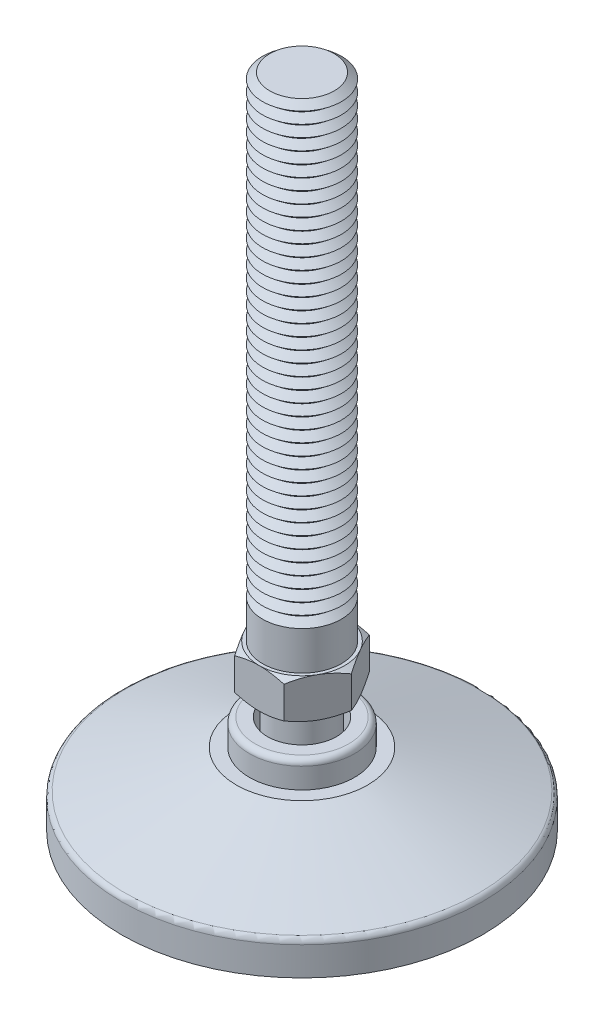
ISO-10303-21;
HEADER;
FILE_DESCRIPTION(('STEP AP214'),'2;1');
FILE_NAME('part.step','',(''),(''),'','','');
FILE_SCHEMA(('AUTOMOTIVE_DESIGN { 1 0 10303 214 1 1 1 1 }'));
ENDSEC;
DATA;
#1=APPLICATION_CONTEXT('core data for automotive mechanical design processes');
#2=APPLICATION_PROTOCOL_DEFINITION('international standard','automotive_design',2000,#1);
#3=PRODUCT_CONTEXT('',#1,'mechanical');
#4=PRODUCT('Part','Part','',(#3));
#5=PRODUCT_RELATED_PRODUCT_CATEGORY('part','',(#4));
#6=PRODUCT_DEFINITION_FORMATION('','',#4);
#7=PRODUCT_DEFINITION_CONTEXT('part definition',#1,'design');
#8=PRODUCT_DEFINITION('design','',#6,#7);
#9=PRODUCT_DEFINITION_SHAPE('','',#8);
#10=(LENGTH_UNIT() NAMED_UNIT(*) SI_UNIT(.MILLI.,.METRE.));
#11=(NAMED_UNIT(*) PLANE_ANGLE_UNIT() SI_UNIT($,.RADIAN.));
#12=(NAMED_UNIT(*) SI_UNIT($,.STERADIAN.) SOLID_ANGLE_UNIT());
#13=UNCERTAINTY_MEASURE_WITH_UNIT(LENGTH_MEASURE(1.E-05),#10,'distance_accuracy_value','');
#14=(GEOMETRIC_REPRESENTATION_CONTEXT(3) GLOBAL_UNCERTAINTY_ASSIGNED_CONTEXT((#13)) GLOBAL_UNIT_ASSIGNED_CONTEXT((#10,
#11,#12)) REPRESENTATION_CONTEXT('',''));
#15=CARTESIAN_POINT('',(0.,0.,0.));
#16=DIRECTION('',(0.,0.,1.));
#17=DIRECTION('',(1.,0.,0.));
#18=AXIS2_PLACEMENT_3D('',#15,#16,#17);
#19=CARTESIAN_POINT('',(0.,3.,0.));
#20=DIRECTION('',(0.,-1.,0.));
#21=DIRECTION('',(0.,0.,-1.));
#22=AXIS2_PLACEMENT_3D('',#19,#20,#21);
#23=CYLINDRICAL_SURFACE('',#22,24.5);
#24=CARTESIAN_POINT('',(0.,3.,0.));
#25=DIRECTION('',(0.,1.,0.));
#26=DIRECTION('',(0.,0.,1.));
#27=AXIS2_PLACEMENT_3D('',#24,#25,#26);
#28=CIRCLE('',#27,24.5);
#29=CARTESIAN_POINT('',(0.,3.,24.5));
#30=VERTEX_POINT('',#29);
#31=EDGE_CURVE('P0_E10',#30,#30,#28,.T.);
#32=ORIENTED_EDGE('',*,*,#31,.F.);
#33=EDGE_LOOP('',(#32));
#34=FACE_BOUND('',#33,.T.);
#35=CARTESIAN_POINT('',(0.,0.,0.));
#36=DIRECTION('',(0.,1.,0.));
#37=DIRECTION('',(0.,0.,1.));
#38=AXIS2_PLACEMENT_3D('',#35,#36,#37);
#39=CIRCLE('',#38,24.5);
#40=CARTESIAN_POINT('',(0.,0.,24.5));
#41=VERTEX_POINT('',#40);
#42=EDGE_CURVE('P0_E17',#41,#41,#39,.T.);
#43=ORIENTED_EDGE('',*,*,#42,.T.);
#44=EDGE_LOOP('',(#43));
#45=FACE_BOUND('',#44,.T.);
#46=ADVANCED_FACE('P0_F14',(#34,#45),#23,.T.);
#47=CARTESIAN_POINT('',(0.,3.,0.));
#48=DIRECTION('',(0.,1.,0.));
#49=DIRECTION('',(0.,0.,1.));
#50=AXIS2_PLACEMENT_3D('',#47,#48,#49);
#51=PLANE('',#50);
#52=CARTESIAN_POINT('',(0.,3.,0.));
#53=DIRECTION('',(0.,1.,0.));
#54=DIRECTION('',(0.,0.,1.));
#55=AXIS2_PLACEMENT_3D('',#52,#53,#54);
#56=CIRCLE('',#55,8.16666666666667);
#57=CARTESIAN_POINT('',(0.,3.,8.16666666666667));
#58=VERTEX_POINT('',#57);
#59=EDGE_CURVE('P0_E26',#58,#58,#56,.T.);
#60=ORIENTED_EDGE('',*,*,#59,.F.);
#61=EDGE_LOOP('',(#60));
#62=FACE_BOUND('',#61,.T.);
#63=ORIENTED_EDGE('',*,*,#31,.T.);
#64=EDGE_LOOP('',(#63));
#65=FACE_BOUND('',#64,.T.);
#66=ADVANCED_FACE('P0_F41',(#62,#65),#51,.T.);
#67=CARTESIAN_POINT('',(0.,0.,0.));
#68=DIRECTION('',(0.,1.,0.));
#69=DIRECTION('',(0.,0.,1.));
#70=AXIS2_PLACEMENT_3D('',#67,#68,#69);
#71=PLANE('',#70);
#72=ORIENTED_EDGE('',*,*,#42,.F.);
#73=EDGE_LOOP('',(#72));
#74=FACE_BOUND('',#73,.T.);
#75=ADVANCED_FACE('P0_F37',(#74),#71,.F.);
#76=CARTESIAN_POINT('',(0.,2.,0.));
#77=DIRECTION('',(0.,1.,0.));
#78=DIRECTION('',(0.,0.,1.));
#79=AXIS2_PLACEMENT_3D('',#76,#77,#78);
#80=CYLINDRICAL_SURFACE('',#79,8.16666666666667);
#81=CARTESIAN_POINT('',(0.,2.,0.));
#82=DIRECTION('',(0.,1.,0.));
#83=DIRECTION('',(0.,0.,1.));
#84=AXIS2_PLACEMENT_3D('',#81,#82,#83);
#85=CIRCLE('',#84,8.16666666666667);
#86=CARTESIAN_POINT('',(0.,2.,8.16666666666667));
#87=VERTEX_POINT('',#86);
#88=EDGE_CURVE('P0_E24',#87,#87,#85,.T.);
#89=ORIENTED_EDGE('',*,*,#88,.F.);
#90=EDGE_LOOP('',(#89));
#91=FACE_BOUND('',#90,.T.);
#92=ORIENTED_EDGE('',*,*,#59,.T.);
#93=EDGE_LOOP('',(#92));
#94=FACE_BOUND('',#93,.T.);
#95=ADVANCED_FACE('P0_F34',(#91,#94),#80,.F.);
#96=CARTESIAN_POINT('',(0.,2.,0.));
#97=DIRECTION('',(0.,1.,0.));
#98=DIRECTION('',(0.,0.,1.));
#99=AXIS2_PLACEMENT_3D('',#96,#97,#98);
#100=PLANE('',#99);
#101=ORIENTED_EDGE('',*,*,#88,.T.);
#102=EDGE_LOOP('',(#101));
#103=FACE_BOUND('',#102,.T.);
#104=ADVANCED_FACE('P0_F32',(#103),#100,.T.);
#105=CLOSED_SHELL('',(#46,#66,#75,#95,#104));
#106=MANIFOLD_SOLID_BREP('P0_B1',#105);
#107=CARTESIAN_POINT('',(0.,95.,0.));
#108=DIRECTION('',(0.,-1.,0.));
#109=DIRECTION('',(0.,0.,-1.));
#110=AXIS2_PLACEMENT_3D('',#107,#108,#109);
#111=CONICAL_SURFACE('',#110,4.90712535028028,0.895664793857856);
#112=CARTESIAN_POINT('',(0.,94.125,0.));
#113=DIRECTION('',(0.,-1.,0.));
#114=DIRECTION('',(0.,0.,-1.));
#115=AXIS2_PLACEMENT_3D('',#112,#113,#114);
#116=CIRCLE('',#115,6.);
#117=CARTESIAN_POINT('',(0.,94.125,-6.));
#118=VERTEX_POINT('',#117);
#119=EDGE_CURVE('P1_E1508',#118,#118,#116,.T.);
#120=ORIENTED_EDGE('',*,*,#119,.F.);
#121=EDGE_LOOP('',(#120));
#122=FACE_BOUND('',#121,.T.);
#123=CARTESIAN_POINT('',(0.,95.,0.));
#124=DIRECTION('',(0.,-1.,0.));
#125=DIRECTION('',(0.,0.,-1.));
#126=AXIS2_PLACEMENT_3D('',#123,#124,#125);
#127=CIRCLE('',#126,4.90712535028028);
#128=CARTESIAN_POINT('',(0.,95.,-4.90712535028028));
#129=VERTEX_POINT('',#128);
#130=EDGE_CURVE('P1_E1517',#129,#129,#127,.T.);
#131=ORIENTED_EDGE('',*,*,#130,.T.);
#132=EDGE_LOOP('',(#131));
#133=FACE_BOUND('',#132,.T.);
#134=ADVANCED_FACE('P1_F16',(#122,#133),#111,.T.);
#135=CARTESIAN_POINT('',(0.,95.875,0.));
#136=DIRECTION('',(0.,1.,0.));
#137=DIRECTION('',(0.,0.,1.));
#138=AXIS2_PLACEMENT_3D('',#135,#136,#137);
#139=CONICAL_SURFACE('',#138,6.,0.895664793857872);
#140=ORIENTED_EDGE('',*,*,#130,.F.);
#141=EDGE_LOOP('',(#140));
#142=FACE_BOUND('',#141,.T.);
#143=CARTESIAN_POINT('',(0.,95.875,0.));
#144=DIRECTION('',(0.,-1.,0.));
#145=DIRECTION('',(0.,0.,-1.));
#146=AXIS2_PLACEMENT_3D('',#143,#144,#145);
#147=CIRCLE('',#146,6.);
#148=CARTESIAN_POINT('',(0.,95.875,-6.));
#149=VERTEX_POINT('',#148);
#150=EDGE_CURVE('P1_E1514',#149,#149,#147,.T.);
#151=ORIENTED_EDGE('',*,*,#150,.T.);
#152=EDGE_LOOP('',(#151));
#153=FACE_BOUND('',#152,.T.);
#154=ADVANCED_FACE('P1_F308',(#142,#153),#139,.T.);
#155=CARTESIAN_POINT('',(0.,102.,0.));
#156=DIRECTION('',(0.,1.,0.));
#157=DIRECTION('',(0.,0.,1.));
#158=AXIS2_PLACEMENT_3D('',#155,#156,#157);
#159=PLANE('',#158);
#160=CARTESIAN_POINT('',(0.,102.,0.));
#161=DIRECTION('',(0.,-1.,0.));
#162=DIRECTION('',(0.,0.,-1.));
#163=AXIS2_PLACEMENT_3D('',#160,#161,#162);
#164=CIRCLE('',#163,4.90712535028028);
#165=CARTESIAN_POINT('',(0.,102.,-4.90712535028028));
#166=VERTEX_POINT('',#165);
#167=EDGE_CURVE('P1_E143',#166,#166,#164,.T.);
#168=ORIENTED_EDGE('',*,*,#167,.F.);
#169=EDGE_LOOP('',(#168));
#170=FACE_BOUND('',#169,.T.);
#171=ADVANCED_FACE('P1_F314',(#170),#159,.T.);
#172=CARTESIAN_POINT('',(0.,102.,0.));
#173=DIRECTION('',(0.,-1.,0.));
#174=DIRECTION('',(0.,0.,-1.));
#175=AXIS2_PLACEMENT_3D('',#172,#173,#174);
#176=CONICAL_SURFACE('',#175,4.90712535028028,0.895664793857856);
#177=CARTESIAN_POINT('',(0.,101.125,0.));
#178=DIRECTION('',(0.,-1.,0.));
#179=DIRECTION('',(0.,0.,-1.));
#180=AXIS2_PLACEMENT_3D('',#177,#178,#179);
#181=CIRCLE('',#180,6.);
#182=CARTESIAN_POINT('',(0.,101.125,-6.));
#183=VERTEX_POINT('',#182);
#184=EDGE_CURVE('P1_E353',#183,#183,#181,.T.);
#185=ORIENTED_EDGE('',*,*,#184,.F.);
#186=EDGE_LOOP('',(#185));
#187=FACE_BOUND('',#186,.T.);
#188=ORIENTED_EDGE('',*,*,#167,.T.);
#189=EDGE_LOOP('',(#188));
#190=FACE_BOUND('',#189,.T.);
#191=ADVANCED_FACE('P1_F211',(#187,#190),#176,.T.);
#192=CARTESIAN_POINT('',(0.,101.125,0.));
#193=DIRECTION('',(0.,1.,0.));
#194=DIRECTION('',(0.,0.,1.));
#195=AXIS2_PLACEMENT_3D('',#192,#193,#194);
#196=CONICAL_SURFACE('',#195,6.,0.895664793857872);
#197=CARTESIAN_POINT('',(0.,100.25,0.));
#198=DIRECTION('',(0.,-1.,0.));
#199=DIRECTION('',(0.,0.,-1.));
#200=AXIS2_PLACEMENT_3D('',#197,#198,#199);
#201=CIRCLE('',#200,4.90712535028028);
#202=CARTESIAN_POINT('',(0.,100.25,-4.90712535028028));
#203=VERTEX_POINT('',#202);
#204=EDGE_CURVE('P1_E352',#203,#203,#201,.T.);
#205=ORIENTED_EDGE('',*,*,#204,.F.);
#206=EDGE_LOOP('',(#205));
#207=FACE_BOUND('',#206,.T.);
#208=ORIENTED_EDGE('',*,*,#184,.T.);
#209=EDGE_LOOP('',(#208));
#210=FACE_BOUND('',#209,.T.);
#211=ADVANCED_FACE('P1_F339',(#207,#210),#196,.T.);
#212=CARTESIAN_POINT('',(0.,100.25,0.));
#213=DIRECTION('',(0.,-1.,0.));
#214=DIRECTION('',(0.,0.,-1.));
#215=AXIS2_PLACEMENT_3D('',#212,#213,#214);
#216=CONICAL_SURFACE('',#215,4.90712535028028,0.895664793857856);
#217=CARTESIAN_POINT('',(0.,99.375,0.));
#218=DIRECTION('',(0.,-1.,0.));
#219=DIRECTION('',(0.,0.,-1.));
#220=AXIS2_PLACEMENT_3D('',#217,#218,#219);
#221=CIRCLE('',#220,6.);
#222=CARTESIAN_POINT('',(0.,99.375,-6.));
#223=VERTEX_POINT('',#222);
#224=EDGE_CURVE('P1_E349',#223,#223,#221,.T.);
#225=ORIENTED_EDGE('',*,*,#224,.F.);
#226=EDGE_LOOP('',(#225));
#227=FACE_BOUND('',#226,.T.);
#228=ORIENTED_EDGE('',*,*,#204,.T.);
#229=EDGE_LOOP('',(#228));
#230=FACE_BOUND('',#229,.T.);
#231=ADVANCED_FACE('P1_F334',(#227,#230),#216,.T.);
#232=CARTESIAN_POINT('',(0.,99.375,0.));
#233=DIRECTION('',(0.,1.,0.));
#234=DIRECTION('',(0.,0.,1.));
#235=AXIS2_PLACEMENT_3D('',#232,#233,#234);
#236=CONICAL_SURFACE('',#235,6.,0.895664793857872);
#237=CARTESIAN_POINT('',(0.,98.5,0.));
#238=DIRECTION('',(0.,-1.,0.));
#239=DIRECTION('',(0.,0.,-1.));
#240=AXIS2_PLACEMENT_3D('',#237,#238,#239);
#241=CIRCLE('',#240,4.90712535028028);
#242=CARTESIAN_POINT('',(0.,98.5,-4.90712535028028));
#243=VERTEX_POINT('',#242);
#244=EDGE_CURVE('P1_E358',#243,#243,#241,.T.);
#245=ORIENTED_EDGE('',*,*,#244,.F.);
#246=EDGE_LOOP('',(#245));
#247=FACE_BOUND('',#246,.T.);
#248=ORIENTED_EDGE('',*,*,#224,.T.);
#249=EDGE_LOOP('',(#248));
#250=FACE_BOUND('',#249,.T.);
#251=ADVANCED_FACE('P1_F331',(#247,#250),#236,.T.);
#252=CARTESIAN_POINT('',(0.,98.5,0.));
#253=DIRECTION('',(0.,-1.,0.));
#254=DIRECTION('',(0.,0.,-1.));
#255=AXIS2_PLACEMENT_3D('',#252,#253,#254);
#256=CONICAL_SURFACE('',#255,4.90712535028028,0.895664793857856);
#257=CARTESIAN_POINT('',(0.,97.625,0.));
#258=DIRECTION('',(0.,-1.,0.));
#259=DIRECTION('',(0.,0.,-1.));
#260=AXIS2_PLACEMENT_3D('',#257,#258,#259);
#261=CIRCLE('',#260,6.);
#262=CARTESIAN_POINT('',(0.,97.625,-6.));
#263=VERTEX_POINT('',#262);
#264=EDGE_CURVE('P1_E1520',#263,#263,#261,.T.);
#265=ORIENTED_EDGE('',*,*,#264,.F.);
#266=EDGE_LOOP('',(#265));
#267=FACE_BOUND('',#266,.T.);
#268=ORIENTED_EDGE('',*,*,#244,.T.);
#269=EDGE_LOOP('',(#268));
#270=FACE_BOUND('',#269,.T.);
#271=ADVANCED_FACE('P1_F325',(#267,#270),#256,.T.);
#272=CARTESIAN_POINT('',(0.,97.625,0.));
#273=DIRECTION('',(0.,1.,0.));
#274=DIRECTION('',(0.,0.,1.));
#275=AXIS2_PLACEMENT_3D('',#272,#273,#274);
#276=CONICAL_SURFACE('',#275,6.,0.895664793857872);
#277=CARTESIAN_POINT('',(0.,96.75,0.));
#278=DIRECTION('',(0.,-1.,0.));
#279=DIRECTION('',(0.,0.,-1.));
#280=AXIS2_PLACEMENT_3D('',#277,#278,#279);
#281=CIRCLE('',#280,4.90712535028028);
#282=CARTESIAN_POINT('',(0.,96.75,-4.90712535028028));
#283=VERTEX_POINT('',#282);
#284=EDGE_CURVE('P1_E1523',#283,#283,#281,.T.);
#285=ORIENTED_EDGE('',*,*,#284,.F.);
#286=EDGE_LOOP('',(#285));
#287=FACE_BOUND('',#286,.T.);
#288=ORIENTED_EDGE('',*,*,#264,.T.);
#289=EDGE_LOOP('',(#288));
#290=FACE_BOUND('',#289,.T.);
#291=ADVANCED_FACE('P1_F321',(#287,#290),#276,.T.);
#292=CARTESIAN_POINT('',(0.,96.75,0.));
#293=DIRECTION('',(0.,-1.,0.));
#294=DIRECTION('',(0.,0.,-1.));
#295=AXIS2_PLACEMENT_3D('',#292,#293,#294);
#296=CONICAL_SURFACE('',#295,4.90712535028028,0.895664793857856);
#297=ORIENTED_EDGE('',*,*,#150,.F.);
#298=EDGE_LOOP('',(#297));
#299=FACE_BOUND('',#298,.T.);
#300=ORIENTED_EDGE('',*,*,#284,.T.);
#301=EDGE_LOOP('',(#300));
#302=FACE_BOUND('',#301,.T.);
#303=ADVANCED_FACE('P1_F324',(#299,#302),#296,.T.);
#304=CARTESIAN_POINT('',(0.,93.25,0.));
#305=DIRECTION('',(0.,-1.,0.));
#306=DIRECTION('',(0.,0.,-1.));
#307=AXIS2_PLACEMENT_3D('',#304,#305,#306);
#308=CONICAL_SURFACE('',#307,4.90712535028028,0.895664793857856);
#309=CARTESIAN_POINT('',(0.,92.375,0.));
#310=DIRECTION('',(0.,-1.,0.));
#311=DIRECTION('',(0.,0.,-1.));
#312=AXIS2_PLACEMENT_3D('',#309,#310,#311);
#313=CIRCLE('',#312,6.);
#314=CARTESIAN_POINT('',(0.,92.375,-6.));
#315=VERTEX_POINT('',#314);
#316=EDGE_CURVE('P1_E1502',#315,#315,#313,.T.);
#317=ORIENTED_EDGE('',*,*,#316,.F.);
#318=EDGE_LOOP('',(#317));
#319=FACE_BOUND('',#318,.T.);
#320=CARTESIAN_POINT('',(0.,93.25,0.));
#321=DIRECTION('',(0.,-1.,0.));
#322=DIRECTION('',(0.,0.,-1.));
#323=AXIS2_PLACEMENT_3D('',#320,#321,#322);
#324=CIRCLE('',#323,4.90712535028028);
#325=CARTESIAN_POINT('',(0.,93.25,-4.90712535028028));
#326=VERTEX_POINT('',#325);
#327=EDGE_CURVE('P1_E1511',#326,#326,#324,.T.);
#328=ORIENTED_EDGE('',*,*,#327,.T.);
#329=EDGE_LOOP('',(#328));
#330=FACE_BOUND('',#329,.T.);
#331=ADVANCED_FACE('P1_F329',(#319,#330),#308,.T.);
#332=CARTESIAN_POINT('',(0.,94.125,0.));
#333=DIRECTION('',(0.,1.,0.));
#334=DIRECTION('',(0.,0.,1.));
#335=AXIS2_PLACEMENT_3D('',#332,#333,#334);
#336=CONICAL_SURFACE('',#335,6.,0.895664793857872);
#337=ORIENTED_EDGE('',*,*,#327,.F.);
#338=EDGE_LOOP('',(#337));
#339=FACE_BOUND('',#338,.T.);
#340=ORIENTED_EDGE('',*,*,#119,.T.);
#341=EDGE_LOOP('',(#340));
#342=FACE_BOUND('',#341,.T.);
#343=ADVANCED_FACE('P1_F1204',(#339,#342),#336,.T.);
#344=CARTESIAN_POINT('',(0.,91.5,0.));
#345=DIRECTION('',(0.,-1.,0.));
#346=DIRECTION('',(0.,0.,-1.));
#347=AXIS2_PLACEMENT_3D('',#344,#345,#346);
#348=CONICAL_SURFACE('',#347,4.90712535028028,0.895664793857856);
#349=CARTESIAN_POINT('',(0.,90.625,0.));
#350=DIRECTION('',(0.,-1.,0.));
#351=DIRECTION('',(0.,0.,-1.));
#352=AXIS2_PLACEMENT_3D('',#349,#350,#351);
#353=CIRCLE('',#352,6.);
#354=CARTESIAN_POINT('',(0.,90.625,-6.));
#355=VERTEX_POINT('',#354);
#356=EDGE_CURVE('P1_E1496',#355,#355,#353,.T.);
#357=ORIENTED_EDGE('',*,*,#356,.F.);
#358=EDGE_LOOP('',(#357));
#359=FACE_BOUND('',#358,.T.);
#360=CARTESIAN_POINT('',(0.,91.5,0.));
#361=DIRECTION('',(0.,-1.,0.));
#362=DIRECTION('',(0.,0.,-1.));
#363=AXIS2_PLACEMENT_3D('',#360,#361,#362);
#364=CIRCLE('',#363,4.90712535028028);
#365=CARTESIAN_POINT('',(0.,91.5,-4.90712535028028));
#366=VERTEX_POINT('',#365);
#367=EDGE_CURVE('P1_E1505',#366,#366,#364,.T.);
#368=ORIENTED_EDGE('',*,*,#367,.T.);
#369=EDGE_LOOP('',(#368));
#370=FACE_BOUND('',#369,.T.);
#371=ADVANCED_FACE('P1_F1194',(#359,#370),#348,.T.);
#372=CARTESIAN_POINT('',(0.,92.375,0.));
#373=DIRECTION('',(0.,1.,0.));
#374=DIRECTION('',(0.,0.,1.));
#375=AXIS2_PLACEMENT_3D('',#372,#373,#374);
#376=CONICAL_SURFACE('',#375,6.,0.895664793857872);
#377=ORIENTED_EDGE('',*,*,#367,.F.);
#378=EDGE_LOOP('',(#377));
#379=FACE_BOUND('',#378,.T.);
#380=ORIENTED_EDGE('',*,*,#316,.T.);
#381=EDGE_LOOP('',(#380));
#382=FACE_BOUND('',#381,.T.);
#383=ADVANCED_FACE('P1_F1184',(#379,#382),#376,.T.);
#384=CARTESIAN_POINT('',(0.,89.75,0.));
#385=DIRECTION('',(0.,-1.,0.));
#386=DIRECTION('',(0.,0.,-1.));
#387=AXIS2_PLACEMENT_3D('',#384,#385,#386);
#388=CONICAL_SURFACE('',#387,4.90712535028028,0.895664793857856);
#389=CARTESIAN_POINT('',(0.,88.875,0.));
#390=DIRECTION('',(0.,-1.,0.));
#391=DIRECTION('',(0.,0.,-1.));
#392=AXIS2_PLACEMENT_3D('',#389,#390,#391);
#393=CIRCLE('',#392,6.);
#394=CARTESIAN_POINT('',(0.,88.875,-6.));
#395=VERTEX_POINT('',#394);
#396=EDGE_CURVE('P1_E1490',#395,#395,#393,.T.);
#397=ORIENTED_EDGE('',*,*,#396,.F.);
#398=EDGE_LOOP('',(#397));
#399=FACE_BOUND('',#398,.T.);
#400=CARTESIAN_POINT('',(0.,89.75,0.));
#401=DIRECTION('',(0.,-1.,0.));
#402=DIRECTION('',(0.,0.,-1.));
#403=AXIS2_PLACEMENT_3D('',#400,#401,#402);
#404=CIRCLE('',#403,4.90712535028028);
#405=CARTESIAN_POINT('',(0.,89.75,-4.90712535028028));
#406=VERTEX_POINT('',#405);
#407=EDGE_CURVE('P1_E1499',#406,#406,#404,.T.);
#408=ORIENTED_EDGE('',*,*,#407,.T.);
#409=EDGE_LOOP('',(#408));
#410=FACE_BOUND('',#409,.T.);
#411=ADVANCED_FACE('P1_F1174',(#399,#410),#388,.T.);
#412=CARTESIAN_POINT('',(0.,90.625,0.));
#413=DIRECTION('',(0.,1.,0.));
#414=DIRECTION('',(0.,0.,1.));
#415=AXIS2_PLACEMENT_3D('',#412,#413,#414);
#416=CONICAL_SURFACE('',#415,6.,0.895664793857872);
#417=ORIENTED_EDGE('',*,*,#407,.F.);
#418=EDGE_LOOP('',(#417));
#419=FACE_BOUND('',#418,.T.);
#420=ORIENTED_EDGE('',*,*,#356,.T.);
#421=EDGE_LOOP('',(#420));
#422=FACE_BOUND('',#421,.T.);
#423=ADVANCED_FACE('P1_F1164',(#419,#422),#416,.T.);
#424=CARTESIAN_POINT('',(0.,88.,0.));
#425=DIRECTION('',(0.,-1.,0.));
#426=DIRECTION('',(0.,0.,-1.));
#427=AXIS2_PLACEMENT_3D('',#424,#425,#426);
#428=CONICAL_SURFACE('',#427,4.90712535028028,0.895664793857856);
#429=CARTESIAN_POINT('',(0.,87.125,0.));
#430=DIRECTION('',(0.,-1.,0.));
#431=DIRECTION('',(0.,0.,-1.));
#432=AXIS2_PLACEMENT_3D('',#429,#430,#431);
#433=CIRCLE('',#432,6.);
#434=CARTESIAN_POINT('',(0.,87.125,-6.));
#435=VERTEX_POINT('',#434);
#436=EDGE_CURVE('P1_E1484',#435,#435,#433,.T.);
#437=ORIENTED_EDGE('',*,*,#436,.F.);
#438=EDGE_LOOP('',(#437));
#439=FACE_BOUND('',#438,.T.);
#440=CARTESIAN_POINT('',(0.,88.,0.));
#441=DIRECTION('',(0.,-1.,0.));
#442=DIRECTION('',(0.,0.,-1.));
#443=AXIS2_PLACEMENT_3D('',#440,#441,#442);
#444=CIRCLE('',#443,4.90712535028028);
#445=CARTESIAN_POINT('',(0.,88.,-4.90712535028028));
#446=VERTEX_POINT('',#445);
#447=EDGE_CURVE('P1_E1493',#446,#446,#444,.T.);
#448=ORIENTED_EDGE('',*,*,#447,.T.);
#449=EDGE_LOOP('',(#448));
#450=FACE_BOUND('',#449,.T.);
#451=ADVANCED_FACE('P1_F1154',(#439,#450),#428,.T.);
#452=CARTESIAN_POINT('',(0.,88.875,0.));
#453=DIRECTION('',(0.,1.,0.));
#454=DIRECTION('',(0.,0.,1.));
#455=AXIS2_PLACEMENT_3D('',#452,#453,#454);
#456=CONICAL_SURFACE('',#455,6.,0.895664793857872);
#457=ORIENTED_EDGE('',*,*,#447,.F.);
#458=EDGE_LOOP('',(#457));
#459=FACE_BOUND('',#458,.T.);
#460=ORIENTED_EDGE('',*,*,#396,.T.);
#461=EDGE_LOOP('',(#460));
#462=FACE_BOUND('',#461,.T.);
#463=ADVANCED_FACE('P1_F1144',(#459,#462),#456,.T.);
#464=CARTESIAN_POINT('',(0.,86.25,0.));
#465=DIRECTION('',(0.,-1.,0.));
#466=DIRECTION('',(0.,0.,-1.));
#467=AXIS2_PLACEMENT_3D('',#464,#465,#466);
#468=CONICAL_SURFACE('',#467,4.90712535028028,0.895664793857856);
#469=CARTESIAN_POINT('',(0.,85.375,0.));
#470=DIRECTION('',(0.,-1.,0.));
#471=DIRECTION('',(0.,0.,-1.));
#472=AXIS2_PLACEMENT_3D('',#469,#470,#471);
#473=CIRCLE('',#472,6.);
#474=CARTESIAN_POINT('',(0.,85.375,-6.));
#475=VERTEX_POINT('',#474);
#476=EDGE_CURVE('P1_E1478',#475,#475,#473,.T.);
#477=ORIENTED_EDGE('',*,*,#476,.F.);
#478=EDGE_LOOP('',(#477));
#479=FACE_BOUND('',#478,.T.);
#480=CARTESIAN_POINT('',(0.,86.25,0.));
#481=DIRECTION('',(0.,-1.,0.));
#482=DIRECTION('',(0.,0.,-1.));
#483=AXIS2_PLACEMENT_3D('',#480,#481,#482);
#484=CIRCLE('',#483,4.90712535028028);
#485=CARTESIAN_POINT('',(0.,86.25,-4.90712535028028));
#486=VERTEX_POINT('',#485);
#487=EDGE_CURVE('P1_E1487',#486,#486,#484,.T.);
#488=ORIENTED_EDGE('',*,*,#487,.T.);
#489=EDGE_LOOP('',(#488));
#490=FACE_BOUND('',#489,.T.);
#491=ADVANCED_FACE('P1_F1134',(#479,#490),#468,.T.);
#492=CARTESIAN_POINT('',(0.,87.125,0.));
#493=DIRECTION('',(0.,1.,0.));
#494=DIRECTION('',(0.,0.,1.));
#495=AXIS2_PLACEMENT_3D('',#492,#493,#494);
#496=CONICAL_SURFACE('',#495,6.,0.895664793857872);
#497=ORIENTED_EDGE('',*,*,#487,.F.);
#498=EDGE_LOOP('',(#497));
#499=FACE_BOUND('',#498,.T.);
#500=ORIENTED_EDGE('',*,*,#436,.T.);
#501=EDGE_LOOP('',(#500));
#502=FACE_BOUND('',#501,.T.);
#503=ADVANCED_FACE('P1_F1124',(#499,#502),#496,.T.);
#504=CARTESIAN_POINT('',(0.,84.5,0.));
#505=DIRECTION('',(0.,-1.,0.));
#506=DIRECTION('',(0.,0.,-1.));
#507=AXIS2_PLACEMENT_3D('',#504,#505,#506);
#508=CONICAL_SURFACE('',#507,4.90712535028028,0.895664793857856);
#509=CARTESIAN_POINT('',(0.,83.625,0.));
#510=DIRECTION('',(0.,-1.,0.));
#511=DIRECTION('',(0.,0.,-1.));
#512=AXIS2_PLACEMENT_3D('',#509,#510,#511);
#513=CIRCLE('',#512,6.);
#514=CARTESIAN_POINT('',(0.,83.625,-6.));
#515=VERTEX_POINT('',#514);
#516=EDGE_CURVE('P1_E1472',#515,#515,#513,.T.);
#517=ORIENTED_EDGE('',*,*,#516,.F.);
#518=EDGE_LOOP('',(#517));
#519=FACE_BOUND('',#518,.T.);
#520=CARTESIAN_POINT('',(0.,84.5,0.));
#521=DIRECTION('',(0.,-1.,0.));
#522=DIRECTION('',(0.,0.,-1.));
#523=AXIS2_PLACEMENT_3D('',#520,#521,#522);
#524=CIRCLE('',#523,4.90712535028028);
#525=CARTESIAN_POINT('',(0.,84.5,-4.90712535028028));
#526=VERTEX_POINT('',#525);
#527=EDGE_CURVE('P1_E1481',#526,#526,#524,.T.);
#528=ORIENTED_EDGE('',*,*,#527,.T.);
#529=EDGE_LOOP('',(#528));
#530=FACE_BOUND('',#529,.T.);
#531=ADVANCED_FACE('P1_F1114',(#519,#530),#508,.T.);
#532=CARTESIAN_POINT('',(0.,85.375,0.));
#533=DIRECTION('',(0.,1.,0.));
#534=DIRECTION('',(0.,0.,1.));
#535=AXIS2_PLACEMENT_3D('',#532,#533,#534);
#536=CONICAL_SURFACE('',#535,6.,0.895664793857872);
#537=ORIENTED_EDGE('',*,*,#527,.F.);
#538=EDGE_LOOP('',(#537));
#539=FACE_BOUND('',#538,.T.);
#540=ORIENTED_EDGE('',*,*,#476,.T.);
#541=EDGE_LOOP('',(#540));
#542=FACE_BOUND('',#541,.T.);
#543=ADVANCED_FACE('P1_F1104',(#539,#542),#536,.T.);
#544=CARTESIAN_POINT('',(0.,82.75,0.));
#545=DIRECTION('',(0.,-1.,0.));
#546=DIRECTION('',(0.,0.,-1.));
#547=AXIS2_PLACEMENT_3D('',#544,#545,#546);
#548=CONICAL_SURFACE('',#547,4.90712535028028,0.895664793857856);
#549=CARTESIAN_POINT('',(0.,81.875,0.));
#550=DIRECTION('',(0.,-1.,0.));
#551=DIRECTION('',(0.,0.,-1.));
#552=AXIS2_PLACEMENT_3D('',#549,#550,#551);
#553=CIRCLE('',#552,6.);
#554=CARTESIAN_POINT('',(0.,81.875,-6.));
#555=VERTEX_POINT('',#554);
#556=EDGE_CURVE('P1_E1466',#555,#555,#553,.T.);
#557=ORIENTED_EDGE('',*,*,#556,.F.);
#558=EDGE_LOOP('',(#557));
#559=FACE_BOUND('',#558,.T.);
#560=CARTESIAN_POINT('',(0.,82.75,0.));
#561=DIRECTION('',(0.,-1.,0.));
#562=DIRECTION('',(0.,0.,-1.));
#563=AXIS2_PLACEMENT_3D('',#560,#561,#562);
#564=CIRCLE('',#563,4.90712535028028);
#565=CARTESIAN_POINT('',(0.,82.75,-4.90712535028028));
#566=VERTEX_POINT('',#565);
#567=EDGE_CURVE('P1_E1475',#566,#566,#564,.T.);
#568=ORIENTED_EDGE('',*,*,#567,.T.);
#569=EDGE_LOOP('',(#568));
#570=FACE_BOUND('',#569,.T.);
#571=ADVANCED_FACE('P1_F1094',(#559,#570),#548,.T.);
#572=CARTESIAN_POINT('',(0.,83.625,0.));
#573=DIRECTION('',(0.,1.,0.));
#574=DIRECTION('',(0.,0.,1.));
#575=AXIS2_PLACEMENT_3D('',#572,#573,#574);
#576=CONICAL_SURFACE('',#575,6.,0.895664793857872);
#577=ORIENTED_EDGE('',*,*,#567,.F.);
#578=EDGE_LOOP('',(#577));
#579=FACE_BOUND('',#578,.T.);
#580=ORIENTED_EDGE('',*,*,#516,.T.);
#581=EDGE_LOOP('',(#580));
#582=FACE_BOUND('',#581,.T.);
#583=ADVANCED_FACE('P1_F1084',(#579,#582),#576,.T.);
#584=CARTESIAN_POINT('',(0.,81.,0.));
#585=DIRECTION('',(0.,-1.,0.));
#586=DIRECTION('',(0.,0.,-1.));
#587=AXIS2_PLACEMENT_3D('',#584,#585,#586);
#588=CONICAL_SURFACE('',#587,4.90712535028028,0.895664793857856);
#589=CARTESIAN_POINT('',(0.,80.125,0.));
#590=DIRECTION('',(0.,-1.,0.));
#591=DIRECTION('',(0.,0.,-1.));
#592=AXIS2_PLACEMENT_3D('',#589,#590,#591);
#593=CIRCLE('',#592,6.);
#594=CARTESIAN_POINT('',(0.,80.125,-6.));
#595=VERTEX_POINT('',#594);
#596=EDGE_CURVE('P1_E1460',#595,#595,#593,.T.);
#597=ORIENTED_EDGE('',*,*,#596,.F.);
#598=EDGE_LOOP('',(#597));
#599=FACE_BOUND('',#598,.T.);
#600=CARTESIAN_POINT('',(0.,81.,0.));
#601=DIRECTION('',(0.,-1.,0.));
#602=DIRECTION('',(0.,0.,-1.));
#603=AXIS2_PLACEMENT_3D('',#600,#601,#602);
#604=CIRCLE('',#603,4.90712535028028);
#605=CARTESIAN_POINT('',(0.,81.,-4.90712535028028));
#606=VERTEX_POINT('',#605);
#607=EDGE_CURVE('P1_E1469',#606,#606,#604,.T.);
#608=ORIENTED_EDGE('',*,*,#607,.T.);
#609=EDGE_LOOP('',(#608));
#610=FACE_BOUND('',#609,.T.);
#611=ADVANCED_FACE('P1_F1074',(#599,#610),#588,.T.);
#612=CARTESIAN_POINT('',(0.,81.875,0.));
#613=DIRECTION('',(0.,1.,0.));
#614=DIRECTION('',(0.,0.,1.));
#615=AXIS2_PLACEMENT_3D('',#612,#613,#614);
#616=CONICAL_SURFACE('',#615,6.,0.895664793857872);
#617=ORIENTED_EDGE('',*,*,#607,.F.);
#618=EDGE_LOOP('',(#617));
#619=FACE_BOUND('',#618,.T.);
#620=ORIENTED_EDGE('',*,*,#556,.T.);
#621=EDGE_LOOP('',(#620));
#622=FACE_BOUND('',#621,.T.);
#623=ADVANCED_FACE('P1_F1064',(#619,#622),#616,.T.);
#624=CARTESIAN_POINT('',(0.,79.25,0.));
#625=DIRECTION('',(0.,-1.,0.));
#626=DIRECTION('',(0.,0.,-1.));
#627=AXIS2_PLACEMENT_3D('',#624,#625,#626);
#628=CONICAL_SURFACE('',#627,4.90712535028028,0.895664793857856);
#629=CARTESIAN_POINT('',(0.,78.375,0.));
#630=DIRECTION('',(0.,-1.,0.));
#631=DIRECTION('',(0.,0.,-1.));
#632=AXIS2_PLACEMENT_3D('',#629,#630,#631);
#633=CIRCLE('',#632,6.);
#634=CARTESIAN_POINT('',(0.,78.375,-6.));
#635=VERTEX_POINT('',#634);
#636=EDGE_CURVE('P1_E1454',#635,#635,#633,.T.);
#637=ORIENTED_EDGE('',*,*,#636,.F.);
#638=EDGE_LOOP('',(#637));
#639=FACE_BOUND('',#638,.T.);
#640=CARTESIAN_POINT('',(0.,79.25,0.));
#641=DIRECTION('',(0.,-1.,0.));
#642=DIRECTION('',(0.,0.,-1.));
#643=AXIS2_PLACEMENT_3D('',#640,#641,#642);
#644=CIRCLE('',#643,4.90712535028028);
#645=CARTESIAN_POINT('',(0.,79.25,-4.90712535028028));
#646=VERTEX_POINT('',#645);
#647=EDGE_CURVE('P1_E1463',#646,#646,#644,.T.);
#648=ORIENTED_EDGE('',*,*,#647,.T.);
#649=EDGE_LOOP('',(#648));
#650=FACE_BOUND('',#649,.T.);
#651=ADVANCED_FACE('P1_F1054',(#639,#650),#628,.T.);
#652=CARTESIAN_POINT('',(0.,80.125,0.));
#653=DIRECTION('',(0.,1.,0.));
#654=DIRECTION('',(0.,0.,1.));
#655=AXIS2_PLACEMENT_3D('',#652,#653,#654);
#656=CONICAL_SURFACE('',#655,6.,0.895664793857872);
#657=ORIENTED_EDGE('',*,*,#647,.F.);
#658=EDGE_LOOP('',(#657));
#659=FACE_BOUND('',#658,.T.);
#660=ORIENTED_EDGE('',*,*,#596,.T.);
#661=EDGE_LOOP('',(#660));
#662=FACE_BOUND('',#661,.T.);
#663=ADVANCED_FACE('P1_F1044',(#659,#662),#656,.T.);
#664=CARTESIAN_POINT('',(0.,77.5,0.));
#665=DIRECTION('',(0.,-1.,0.));
#666=DIRECTION('',(0.,0.,-1.));
#667=AXIS2_PLACEMENT_3D('',#664,#665,#666);
#668=CONICAL_SURFACE('',#667,4.90712535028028,0.895664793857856);
#669=CARTESIAN_POINT('',(0.,76.625,0.));
#670=DIRECTION('',(0.,-1.,0.));
#671=DIRECTION('',(0.,0.,-1.));
#672=AXIS2_PLACEMENT_3D('',#669,#670,#671);
#673=CIRCLE('',#672,6.);
#674=CARTESIAN_POINT('',(0.,76.625,-6.));
#675=VERTEX_POINT('',#674);
#676=EDGE_CURVE('P1_E1448',#675,#675,#673,.T.);
#677=ORIENTED_EDGE('',*,*,#676,.F.);
#678=EDGE_LOOP('',(#677));
#679=FACE_BOUND('',#678,.T.);
#680=CARTESIAN_POINT('',(0.,77.5,0.));
#681=DIRECTION('',(0.,-1.,0.));
#682=DIRECTION('',(0.,0.,-1.));
#683=AXIS2_PLACEMENT_3D('',#680,#681,#682);
#684=CIRCLE('',#683,4.90712535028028);
#685=CARTESIAN_POINT('',(0.,77.5,-4.90712535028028));
#686=VERTEX_POINT('',#685);
#687=EDGE_CURVE('P1_E1457',#686,#686,#684,.T.);
#688=ORIENTED_EDGE('',*,*,#687,.T.);
#689=EDGE_LOOP('',(#688));
#690=FACE_BOUND('',#689,.T.);
#691=ADVANCED_FACE('P1_F1034',(#679,#690),#668,.T.);
#692=CARTESIAN_POINT('',(0.,78.375,0.));
#693=DIRECTION('',(0.,1.,0.));
#694=DIRECTION('',(0.,0.,1.));
#695=AXIS2_PLACEMENT_3D('',#692,#693,#694);
#696=CONICAL_SURFACE('',#695,6.,0.895664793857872);
#697=ORIENTED_EDGE('',*,*,#687,.F.);
#698=EDGE_LOOP('',(#697));
#699=FACE_BOUND('',#698,.T.);
#700=ORIENTED_EDGE('',*,*,#636,.T.);
#701=EDGE_LOOP('',(#700));
#702=FACE_BOUND('',#701,.T.);
#703=ADVANCED_FACE('P1_F1024',(#699,#702),#696,.T.);
#704=CARTESIAN_POINT('',(0.,75.75,0.));
#705=DIRECTION('',(0.,-1.,0.));
#706=DIRECTION('',(0.,0.,-1.));
#707=AXIS2_PLACEMENT_3D('',#704,#705,#706);
#708=CONICAL_SURFACE('',#707,4.90712535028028,0.895664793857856);
#709=CARTESIAN_POINT('',(0.,74.875,0.));
#710=DIRECTION('',(0.,-1.,0.));
#711=DIRECTION('',(0.,0.,-1.));
#712=AXIS2_PLACEMENT_3D('',#709,#710,#711);
#713=CIRCLE('',#712,6.);
#714=CARTESIAN_POINT('',(0.,74.875,-6.));
#715=VERTEX_POINT('',#714);
#716=EDGE_CURVE('P1_E1442',#715,#715,#713,.T.);
#717=ORIENTED_EDGE('',*,*,#716,.F.);
#718=EDGE_LOOP('',(#717));
#719=FACE_BOUND('',#718,.T.);
#720=CARTESIAN_POINT('',(0.,75.75,0.));
#721=DIRECTION('',(0.,-1.,0.));
#722=DIRECTION('',(0.,0.,-1.));
#723=AXIS2_PLACEMENT_3D('',#720,#721,#722);
#724=CIRCLE('',#723,4.90712535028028);
#725=CARTESIAN_POINT('',(0.,75.75,-4.90712535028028));
#726=VERTEX_POINT('',#725);
#727=EDGE_CURVE('P1_E1451',#726,#726,#724,.T.);
#728=ORIENTED_EDGE('',*,*,#727,.T.);
#729=EDGE_LOOP('',(#728));
#730=FACE_BOUND('',#729,.T.);
#731=ADVANCED_FACE('P1_F1014',(#719,#730),#708,.T.);
#732=CARTESIAN_POINT('',(0.,76.625,0.));
#733=DIRECTION('',(0.,1.,0.));
#734=DIRECTION('',(0.,0.,1.));
#735=AXIS2_PLACEMENT_3D('',#732,#733,#734);
#736=CONICAL_SURFACE('',#735,6.,0.895664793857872);
#737=ORIENTED_EDGE('',*,*,#727,.F.);
#738=EDGE_LOOP('',(#737));
#739=FACE_BOUND('',#738,.T.);
#740=ORIENTED_EDGE('',*,*,#676,.T.);
#741=EDGE_LOOP('',(#740));
#742=FACE_BOUND('',#741,.T.);
#743=ADVANCED_FACE('P1_F1004',(#739,#742),#736,.T.);
#744=CARTESIAN_POINT('',(0.,74.,0.));
#745=DIRECTION('',(0.,-1.,0.));
#746=DIRECTION('',(0.,0.,-1.));
#747=AXIS2_PLACEMENT_3D('',#744,#745,#746);
#748=CONICAL_SURFACE('',#747,4.90712535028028,0.895664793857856);
#749=CARTESIAN_POINT('',(0.,73.125,0.));
#750=DIRECTION('',(0.,-1.,0.));
#751=DIRECTION('',(0.,0.,-1.));
#752=AXIS2_PLACEMENT_3D('',#749,#750,#751);
#753=CIRCLE('',#752,6.);
#754=CARTESIAN_POINT('',(0.,73.125,-6.));
#755=VERTEX_POINT('',#754);
#756=EDGE_CURVE('P1_E1436',#755,#755,#753,.T.);
#757=ORIENTED_EDGE('',*,*,#756,.F.);
#758=EDGE_LOOP('',(#757));
#759=FACE_BOUND('',#758,.T.);
#760=CARTESIAN_POINT('',(0.,74.,0.));
#761=DIRECTION('',(0.,-1.,0.));
#762=DIRECTION('',(0.,0.,-1.));
#763=AXIS2_PLACEMENT_3D('',#760,#761,#762);
#764=CIRCLE('',#763,4.90712535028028);
#765=CARTESIAN_POINT('',(0.,74.,-4.90712535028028));
#766=VERTEX_POINT('',#765);
#767=EDGE_CURVE('P1_E1445',#766,#766,#764,.T.);
#768=ORIENTED_EDGE('',*,*,#767,.T.);
#769=EDGE_LOOP('',(#768));
#770=FACE_BOUND('',#769,.T.);
#771=ADVANCED_FACE('P1_F994',(#759,#770),#748,.T.);
#772=CARTESIAN_POINT('',(0.,74.875,0.));
#773=DIRECTION('',(0.,1.,0.));
#774=DIRECTION('',(0.,0.,1.));
#775=AXIS2_PLACEMENT_3D('',#772,#773,#774);
#776=CONICAL_SURFACE('',#775,6.,0.895664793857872);
#777=ORIENTED_EDGE('',*,*,#767,.F.);
#778=EDGE_LOOP('',(#777));
#779=FACE_BOUND('',#778,.T.);
#780=ORIENTED_EDGE('',*,*,#716,.T.);
#781=EDGE_LOOP('',(#780));
#782=FACE_BOUND('',#781,.T.);
#783=ADVANCED_FACE('P1_F984',(#779,#782),#776,.T.);
#784=CARTESIAN_POINT('',(0.,72.25,0.));
#785=DIRECTION('',(0.,-1.,0.));
#786=DIRECTION('',(0.,0.,-1.));
#787=AXIS2_PLACEMENT_3D('',#784,#785,#786);
#788=CONICAL_SURFACE('',#787,4.90712535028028,0.895664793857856);
#789=CARTESIAN_POINT('',(0.,71.375,0.));
#790=DIRECTION('',(0.,-1.,0.));
#791=DIRECTION('',(0.,0.,-1.));
#792=AXIS2_PLACEMENT_3D('',#789,#790,#791);
#793=CIRCLE('',#792,6.);
#794=CARTESIAN_POINT('',(0.,71.375,-6.));
#795=VERTEX_POINT('',#794);
#796=EDGE_CURVE('P1_E1430',#795,#795,#793,.T.);
#797=ORIENTED_EDGE('',*,*,#796,.F.);
#798=EDGE_LOOP('',(#797));
#799=FACE_BOUND('',#798,.T.);
#800=CARTESIAN_POINT('',(0.,72.25,0.));
#801=DIRECTION('',(0.,-1.,0.));
#802=DIRECTION('',(0.,0.,-1.));
#803=AXIS2_PLACEMENT_3D('',#800,#801,#802);
#804=CIRCLE('',#803,4.90712535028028);
#805=CARTESIAN_POINT('',(0.,72.25,-4.90712535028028));
#806=VERTEX_POINT('',#805);
#807=EDGE_CURVE('P1_E1439',#806,#806,#804,.T.);
#808=ORIENTED_EDGE('',*,*,#807,.T.);
#809=EDGE_LOOP('',(#808));
#810=FACE_BOUND('',#809,.T.);
#811=ADVANCED_FACE('P1_F974',(#799,#810),#788,.T.);
#812=CARTESIAN_POINT('',(0.,73.125,0.));
#813=DIRECTION('',(0.,1.,0.));
#814=DIRECTION('',(0.,0.,1.));
#815=AXIS2_PLACEMENT_3D('',#812,#813,#814);
#816=CONICAL_SURFACE('',#815,6.,0.895664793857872);
#817=ORIENTED_EDGE('',*,*,#807,.F.);
#818=EDGE_LOOP('',(#817));
#819=FACE_BOUND('',#818,.T.);
#820=ORIENTED_EDGE('',*,*,#756,.T.);
#821=EDGE_LOOP('',(#820));
#822=FACE_BOUND('',#821,.T.);
#823=ADVANCED_FACE('P1_F964',(#819,#822),#816,.T.);
#824=CARTESIAN_POINT('',(0.,70.5,0.));
#825=DIRECTION('',(0.,-1.,0.));
#826=DIRECTION('',(0.,0.,-1.));
#827=AXIS2_PLACEMENT_3D('',#824,#825,#826);
#828=CONICAL_SURFACE('',#827,4.90712535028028,0.895664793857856);
#829=CARTESIAN_POINT('',(0.,69.625,0.));
#830=DIRECTION('',(0.,-1.,0.));
#831=DIRECTION('',(0.,0.,-1.));
#832=AXIS2_PLACEMENT_3D('',#829,#830,#831);
#833=CIRCLE('',#832,6.);
#834=CARTESIAN_POINT('',(0.,69.625,-6.));
#835=VERTEX_POINT('',#834);
#836=EDGE_CURVE('P1_E1424',#835,#835,#833,.T.);
#837=ORIENTED_EDGE('',*,*,#836,.F.);
#838=EDGE_LOOP('',(#837));
#839=FACE_BOUND('',#838,.T.);
#840=CARTESIAN_POINT('',(0.,70.5,0.));
#841=DIRECTION('',(0.,-1.,0.));
#842=DIRECTION('',(0.,0.,-1.));
#843=AXIS2_PLACEMENT_3D('',#840,#841,#842);
#844=CIRCLE('',#843,4.90712535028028);
#845=CARTESIAN_POINT('',(0.,70.5,-4.90712535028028));
#846=VERTEX_POINT('',#845);
#847=EDGE_CURVE('P1_E1433',#846,#846,#844,.T.);
#848=ORIENTED_EDGE('',*,*,#847,.T.);
#849=EDGE_LOOP('',(#848));
#850=FACE_BOUND('',#849,.T.);
#851=ADVANCED_FACE('P1_F954',(#839,#850),#828,.T.);
#852=CARTESIAN_POINT('',(0.,71.375,0.));
#853=DIRECTION('',(0.,1.,0.));
#854=DIRECTION('',(0.,0.,1.));
#855=AXIS2_PLACEMENT_3D('',#852,#853,#854);
#856=CONICAL_SURFACE('',#855,6.,0.895664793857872);
#857=ORIENTED_EDGE('',*,*,#847,.F.);
#858=EDGE_LOOP('',(#857));
#859=FACE_BOUND('',#858,.T.);
#860=ORIENTED_EDGE('',*,*,#796,.T.);
#861=EDGE_LOOP('',(#860));
#862=FACE_BOUND('',#861,.T.);
#863=ADVANCED_FACE('P1_F944',(#859,#862),#856,.T.);
#864=CARTESIAN_POINT('',(0.,68.75,0.));
#865=DIRECTION('',(0.,-1.,0.));
#866=DIRECTION('',(0.,0.,-1.));
#867=AXIS2_PLACEMENT_3D('',#864,#865,#866);
#868=CONICAL_SURFACE('',#867,4.90712535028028,0.895664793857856);
#869=CARTESIAN_POINT('',(0.,67.875,0.));
#870=DIRECTION('',(0.,-1.,0.));
#871=DIRECTION('',(0.,0.,-1.));
#872=AXIS2_PLACEMENT_3D('',#869,#870,#871);
#873=CIRCLE('',#872,6.);
#874=CARTESIAN_POINT('',(0.,67.875,-6.));
#875=VERTEX_POINT('',#874);
#876=EDGE_CURVE('P1_E1418',#875,#875,#873,.T.);
#877=ORIENTED_EDGE('',*,*,#876,.F.);
#878=EDGE_LOOP('',(#877));
#879=FACE_BOUND('',#878,.T.);
#880=CARTESIAN_POINT('',(0.,68.75,0.));
#881=DIRECTION('',(0.,-1.,0.));
#882=DIRECTION('',(0.,0.,-1.));
#883=AXIS2_PLACEMENT_3D('',#880,#881,#882);
#884=CIRCLE('',#883,4.90712535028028);
#885=CARTESIAN_POINT('',(0.,68.75,-4.90712535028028));
#886=VERTEX_POINT('',#885);
#887=EDGE_CURVE('P1_E1427',#886,#886,#884,.T.);
#888=ORIENTED_EDGE('',*,*,#887,.T.);
#889=EDGE_LOOP('',(#888));
#890=FACE_BOUND('',#889,.T.);
#891=ADVANCED_FACE('P1_F934',(#879,#890),#868,.T.);
#892=CARTESIAN_POINT('',(0.,69.625,0.));
#893=DIRECTION('',(0.,1.,0.));
#894=DIRECTION('',(0.,0.,1.));
#895=AXIS2_PLACEMENT_3D('',#892,#893,#894);
#896=CONICAL_SURFACE('',#895,6.,0.895664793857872);
#897=ORIENTED_EDGE('',*,*,#887,.F.);
#898=EDGE_LOOP('',(#897));
#899=FACE_BOUND('',#898,.T.);
#900=ORIENTED_EDGE('',*,*,#836,.T.);
#901=EDGE_LOOP('',(#900));
#902=FACE_BOUND('',#901,.T.);
#903=ADVANCED_FACE('P1_F924',(#899,#902),#896,.T.);
#904=CARTESIAN_POINT('',(0.,67.,0.));
#905=DIRECTION('',(0.,-1.,0.));
#906=DIRECTION('',(0.,0.,-1.));
#907=AXIS2_PLACEMENT_3D('',#904,#905,#906);
#908=CONICAL_SURFACE('',#907,4.90712535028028,0.895664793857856);
#909=CARTESIAN_POINT('',(0.,66.125,0.));
#910=DIRECTION('',(0.,-1.,0.));
#911=DIRECTION('',(0.,0.,-1.));
#912=AXIS2_PLACEMENT_3D('',#909,#910,#911);
#913=CIRCLE('',#912,6.);
#914=CARTESIAN_POINT('',(0.,66.125,-6.));
#915=VERTEX_POINT('',#914);
#916=EDGE_CURVE('P1_E1412',#915,#915,#913,.T.);
#917=ORIENTED_EDGE('',*,*,#916,.F.);
#918=EDGE_LOOP('',(#917));
#919=FACE_BOUND('',#918,.T.);
#920=CARTESIAN_POINT('',(0.,67.,0.));
#921=DIRECTION('',(0.,-1.,0.));
#922=DIRECTION('',(0.,0.,-1.));
#923=AXIS2_PLACEMENT_3D('',#920,#921,#922);
#924=CIRCLE('',#923,4.90712535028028);
#925=CARTESIAN_POINT('',(0.,67.,-4.90712535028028));
#926=VERTEX_POINT('',#925);
#927=EDGE_CURVE('P1_E1421',#926,#926,#924,.T.);
#928=ORIENTED_EDGE('',*,*,#927,.T.);
#929=EDGE_LOOP('',(#928));
#930=FACE_BOUND('',#929,.T.);
#931=ADVANCED_FACE('P1_F914',(#919,#930),#908,.T.);
#932=CARTESIAN_POINT('',(0.,67.875,0.));
#933=DIRECTION('',(0.,1.,0.));
#934=DIRECTION('',(0.,0.,1.));
#935=AXIS2_PLACEMENT_3D('',#932,#933,#934);
#936=CONICAL_SURFACE('',#935,6.,0.895664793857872);
#937=ORIENTED_EDGE('',*,*,#927,.F.);
#938=EDGE_LOOP('',(#937));
#939=FACE_BOUND('',#938,.T.);
#940=ORIENTED_EDGE('',*,*,#876,.T.);
#941=EDGE_LOOP('',(#940));
#942=FACE_BOUND('',#941,.T.);
#943=ADVANCED_FACE('P1_F904',(#939,#942),#936,.T.);
#944=CARTESIAN_POINT('',(0.,65.25,0.));
#945=DIRECTION('',(0.,-1.,0.));
#946=DIRECTION('',(0.,0.,-1.));
#947=AXIS2_PLACEMENT_3D('',#944,#945,#946);
#948=CONICAL_SURFACE('',#947,4.90712535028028,0.895664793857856);
#949=CARTESIAN_POINT('',(0.,64.375,0.));
#950=DIRECTION('',(0.,-1.,0.));
#951=DIRECTION('',(0.,0.,-1.));
#952=AXIS2_PLACEMENT_3D('',#949,#950,#951);
#953=CIRCLE('',#952,6.);
#954=CARTESIAN_POINT('',(0.,64.375,-6.));
#955=VERTEX_POINT('',#954);
#956=EDGE_CURVE('P1_E1406',#955,#955,#953,.T.);
#957=ORIENTED_EDGE('',*,*,#956,.F.);
#958=EDGE_LOOP('',(#957));
#959=FACE_BOUND('',#958,.T.);
#960=CARTESIAN_POINT('',(0.,65.25,0.));
#961=DIRECTION('',(0.,-1.,0.));
#962=DIRECTION('',(0.,0.,-1.));
#963=AXIS2_PLACEMENT_3D('',#960,#961,#962);
#964=CIRCLE('',#963,4.90712535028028);
#965=CARTESIAN_POINT('',(0.,65.25,-4.90712535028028));
#966=VERTEX_POINT('',#965);
#967=EDGE_CURVE('P1_E1415',#966,#966,#964,.T.);
#968=ORIENTED_EDGE('',*,*,#967,.T.);
#969=EDGE_LOOP('',(#968));
#970=FACE_BOUND('',#969,.T.);
#971=ADVANCED_FACE('P1_F894',(#959,#970),#948,.T.);
#972=CARTESIAN_POINT('',(0.,66.125,0.));
#973=DIRECTION('',(0.,1.,0.));
#974=DIRECTION('',(0.,0.,1.));
#975=AXIS2_PLACEMENT_3D('',#972,#973,#974);
#976=CONICAL_SURFACE('',#975,6.,0.895664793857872);
#977=ORIENTED_EDGE('',*,*,#967,.F.);
#978=EDGE_LOOP('',(#977));
#979=FACE_BOUND('',#978,.T.);
#980=ORIENTED_EDGE('',*,*,#916,.T.);
#981=EDGE_LOOP('',(#980));
#982=FACE_BOUND('',#981,.T.);
#983=ADVANCED_FACE('P1_F884',(#979,#982),#976,.T.);
#984=CARTESIAN_POINT('',(0.,63.5,0.));
#985=DIRECTION('',(0.,-1.,0.));
#986=DIRECTION('',(0.,0.,-1.));
#987=AXIS2_PLACEMENT_3D('',#984,#985,#986);
#988=CONICAL_SURFACE('',#987,4.90712535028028,0.895664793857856);
#989=CARTESIAN_POINT('',(0.,62.625,0.));
#990=DIRECTION('',(0.,-1.,0.));
#991=DIRECTION('',(0.,0.,-1.));
#992=AXIS2_PLACEMENT_3D('',#989,#990,#991);
#993=CIRCLE('',#992,6.);
#994=CARTESIAN_POINT('',(0.,62.625,-6.));
#995=VERTEX_POINT('',#994);
#996=EDGE_CURVE('P1_E1400',#995,#995,#993,.T.);
#997=ORIENTED_EDGE('',*,*,#996,.F.);
#998=EDGE_LOOP('',(#997));
#999=FACE_BOUND('',#998,.T.);
#1000=CARTESIAN_POINT('',(0.,63.5,0.));
#1001=DIRECTION('',(0.,-1.,0.));
#1002=DIRECTION('',(0.,0.,-1.));
#1003=AXIS2_PLACEMENT_3D('',#1000,#1001,#1002);
#1004=CIRCLE('',#1003,4.90712535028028);
#1005=CARTESIAN_POINT('',(0.,63.5,-4.90712535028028));
#1006=VERTEX_POINT('',#1005);
#1007=EDGE_CURVE('P1_E1409',#1006,#1006,#1004,.T.);
#1008=ORIENTED_EDGE('',*,*,#1007,.T.);
#1009=EDGE_LOOP('',(#1008));
#1010=FACE_BOUND('',#1009,.T.);
#1011=ADVANCED_FACE('P1_F874',(#999,#1010),#988,.T.);
#1012=CARTESIAN_POINT('',(0.,64.375,0.));
#1013=DIRECTION('',(0.,1.,0.));
#1014=DIRECTION('',(0.,0.,1.));
#1015=AXIS2_PLACEMENT_3D('',#1012,#1013,#1014);
#1016=CONICAL_SURFACE('',#1015,6.,0.895664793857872);
#1017=ORIENTED_EDGE('',*,*,#1007,.F.);
#1018=EDGE_LOOP('',(#1017));
#1019=FACE_BOUND('',#1018,.T.);
#1020=ORIENTED_EDGE('',*,*,#956,.T.);
#1021=EDGE_LOOP('',(#1020));
#1022=FACE_BOUND('',#1021,.T.);
#1023=ADVANCED_FACE('P1_F864',(#1019,#1022),#1016,.T.);
#1024=CARTESIAN_POINT('',(0.,61.75,0.));
#1025=DIRECTION('',(0.,-1.,0.));
#1026=DIRECTION('',(0.,0.,-1.));
#1027=AXIS2_PLACEMENT_3D('',#1024,#1025,#1026);
#1028=CONICAL_SURFACE('',#1027,4.90712535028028,0.895664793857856);
#1029=CARTESIAN_POINT('',(0.,60.875,0.));
#1030=DIRECTION('',(0.,-1.,0.));
#1031=DIRECTION('',(0.,0.,-1.));
#1032=AXIS2_PLACEMENT_3D('',#1029,#1030,#1031);
#1033=CIRCLE('',#1032,6.);
#1034=CARTESIAN_POINT('',(0.,60.875,-6.));
#1035=VERTEX_POINT('',#1034);
#1036=EDGE_CURVE('P1_E1394',#1035,#1035,#1033,.T.);
#1037=ORIENTED_EDGE('',*,*,#1036,.F.);
#1038=EDGE_LOOP('',(#1037));
#1039=FACE_BOUND('',#1038,.T.);
#1040=CARTESIAN_POINT('',(0.,61.75,0.));
#1041=DIRECTION('',(0.,-1.,0.));
#1042=DIRECTION('',(0.,0.,-1.));
#1043=AXIS2_PLACEMENT_3D('',#1040,#1041,#1042);
#1044=CIRCLE('',#1043,4.90712535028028);
#1045=CARTESIAN_POINT('',(0.,61.75,-4.90712535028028));
#1046=VERTEX_POINT('',#1045);
#1047=EDGE_CURVE('P1_E1403',#1046,#1046,#1044,.T.);
#1048=ORIENTED_EDGE('',*,*,#1047,.T.);
#1049=EDGE_LOOP('',(#1048));
#1050=FACE_BOUND('',#1049,.T.);
#1051=ADVANCED_FACE('P1_F854',(#1039,#1050),#1028,.T.);
#1052=CARTESIAN_POINT('',(0.,62.625,0.));
#1053=DIRECTION('',(0.,1.,0.));
#1054=DIRECTION('',(0.,0.,1.));
#1055=AXIS2_PLACEMENT_3D('',#1052,#1053,#1054);
#1056=CONICAL_SURFACE('',#1055,6.,0.895664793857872);
#1057=ORIENTED_EDGE('',*,*,#1047,.F.);
#1058=EDGE_LOOP('',(#1057));
#1059=FACE_BOUND('',#1058,.T.);
#1060=ORIENTED_EDGE('',*,*,#996,.T.);
#1061=EDGE_LOOP('',(#1060));
#1062=FACE_BOUND('',#1061,.T.);
#1063=ADVANCED_FACE('P1_F844',(#1059,#1062),#1056,.T.);
#1064=CARTESIAN_POINT('',(0.,60.,0.));
#1065=DIRECTION('',(0.,-1.,0.));
#1066=DIRECTION('',(0.,0.,-1.));
#1067=AXIS2_PLACEMENT_3D('',#1064,#1065,#1066);
#1068=CONICAL_SURFACE('',#1067,4.90712535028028,0.895664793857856);
#1069=CARTESIAN_POINT('',(0.,59.125,0.));
#1070=DIRECTION('',(0.,-1.,0.));
#1071=DIRECTION('',(0.,0.,-1.));
#1072=AXIS2_PLACEMENT_3D('',#1069,#1070,#1071);
#1073=CIRCLE('',#1072,6.);
#1074=CARTESIAN_POINT('',(0.,59.125,-6.));
#1075=VERTEX_POINT('',#1074);
#1076=EDGE_CURVE('P1_E1388',#1075,#1075,#1073,.T.);
#1077=ORIENTED_EDGE('',*,*,#1076,.F.);
#1078=EDGE_LOOP('',(#1077));
#1079=FACE_BOUND('',#1078,.T.);
#1080=CARTESIAN_POINT('',(0.,60.,0.));
#1081=DIRECTION('',(0.,-1.,0.));
#1082=DIRECTION('',(0.,0.,-1.));
#1083=AXIS2_PLACEMENT_3D('',#1080,#1081,#1082);
#1084=CIRCLE('',#1083,4.90712535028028);
#1085=CARTESIAN_POINT('',(0.,60.,-4.90712535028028));
#1086=VERTEX_POINT('',#1085);
#1087=EDGE_CURVE('P1_E1397',#1086,#1086,#1084,.T.);
#1088=ORIENTED_EDGE('',*,*,#1087,.T.);
#1089=EDGE_LOOP('',(#1088));
#1090=FACE_BOUND('',#1089,.T.);
#1091=ADVANCED_FACE('P1_F834',(#1079,#1090),#1068,.T.);
#1092=CARTESIAN_POINT('',(0.,60.875,0.));
#1093=DIRECTION('',(0.,1.,0.));
#1094=DIRECTION('',(0.,0.,1.));
#1095=AXIS2_PLACEMENT_3D('',#1092,#1093,#1094);
#1096=CONICAL_SURFACE('',#1095,6.,0.895664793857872);
#1097=ORIENTED_EDGE('',*,*,#1087,.F.);
#1098=EDGE_LOOP('',(#1097));
#1099=FACE_BOUND('',#1098,.T.);
#1100=ORIENTED_EDGE('',*,*,#1036,.T.);
#1101=EDGE_LOOP('',(#1100));
#1102=FACE_BOUND('',#1101,.T.);
#1103=ADVANCED_FACE('P1_F824',(#1099,#1102),#1096,.T.);
#1104=CARTESIAN_POINT('',(0.,58.25,0.));
#1105=DIRECTION('',(0.,-1.,0.));
#1106=DIRECTION('',(0.,0.,-1.));
#1107=AXIS2_PLACEMENT_3D('',#1104,#1105,#1106);
#1108=CONICAL_SURFACE('',#1107,4.90712535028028,0.895664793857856);
#1109=CARTESIAN_POINT('',(0.,57.375,0.));
#1110=DIRECTION('',(0.,-1.,0.));
#1111=DIRECTION('',(0.,0.,-1.));
#1112=AXIS2_PLACEMENT_3D('',#1109,#1110,#1111);
#1113=CIRCLE('',#1112,6.);
#1114=CARTESIAN_POINT('',(0.,57.375,-6.));
#1115=VERTEX_POINT('',#1114);
#1116=EDGE_CURVE('P1_E1382',#1115,#1115,#1113,.T.);
#1117=ORIENTED_EDGE('',*,*,#1116,.F.);
#1118=EDGE_LOOP('',(#1117));
#1119=FACE_BOUND('',#1118,.T.);
#1120=CARTESIAN_POINT('',(0.,58.25,0.));
#1121=DIRECTION('',(0.,-1.,0.));
#1122=DIRECTION('',(0.,0.,-1.));
#1123=AXIS2_PLACEMENT_3D('',#1120,#1121,#1122);
#1124=CIRCLE('',#1123,4.90712535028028);
#1125=CARTESIAN_POINT('',(0.,58.25,-4.90712535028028));
#1126=VERTEX_POINT('',#1125);
#1127=EDGE_CURVE('P1_E1391',#1126,#1126,#1124,.T.);
#1128=ORIENTED_EDGE('',*,*,#1127,.T.);
#1129=EDGE_LOOP('',(#1128));
#1130=FACE_BOUND('',#1129,.T.);
#1131=ADVANCED_FACE('P1_F814',(#1119,#1130),#1108,.T.);
#1132=CARTESIAN_POINT('',(0.,59.125,0.));
#1133=DIRECTION('',(0.,1.,0.));
#1134=DIRECTION('',(0.,0.,1.));
#1135=AXIS2_PLACEMENT_3D('',#1132,#1133,#1134);
#1136=CONICAL_SURFACE('',#1135,6.,0.895664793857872);
#1137=ORIENTED_EDGE('',*,*,#1127,.F.);
#1138=EDGE_LOOP('',(#1137));
#1139=FACE_BOUND('',#1138,.T.);
#1140=ORIENTED_EDGE('',*,*,#1076,.T.);
#1141=EDGE_LOOP('',(#1140));
#1142=FACE_BOUND('',#1141,.T.);
#1143=ADVANCED_FACE('P1_F804',(#1139,#1142),#1136,.T.);
#1144=CARTESIAN_POINT('',(0.,56.5,0.));
#1145=DIRECTION('',(0.,-1.,0.));
#1146=DIRECTION('',(0.,0.,-1.));
#1147=AXIS2_PLACEMENT_3D('',#1144,#1145,#1146);
#1148=CONICAL_SURFACE('',#1147,4.90712535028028,0.895664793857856);
#1149=CARTESIAN_POINT('',(0.,55.625,0.));
#1150=DIRECTION('',(0.,-1.,0.));
#1151=DIRECTION('',(0.,0.,-1.));
#1152=AXIS2_PLACEMENT_3D('',#1149,#1150,#1151);
#1153=CIRCLE('',#1152,6.);
#1154=CARTESIAN_POINT('',(0.,55.625,-6.));
#1155=VERTEX_POINT('',#1154);
#1156=EDGE_CURVE('P1_E1376',#1155,#1155,#1153,.T.);
#1157=ORIENTED_EDGE('',*,*,#1156,.F.);
#1158=EDGE_LOOP('',(#1157));
#1159=FACE_BOUND('',#1158,.T.);
#1160=CARTESIAN_POINT('',(0.,56.5,0.));
#1161=DIRECTION('',(0.,-1.,0.));
#1162=DIRECTION('',(0.,0.,-1.));
#1163=AXIS2_PLACEMENT_3D('',#1160,#1161,#1162);
#1164=CIRCLE('',#1163,4.90712535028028);
#1165=CARTESIAN_POINT('',(0.,56.5,-4.90712535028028));
#1166=VERTEX_POINT('',#1165);
#1167=EDGE_CURVE('P1_E1385',#1166,#1166,#1164,.T.);
#1168=ORIENTED_EDGE('',*,*,#1167,.T.);
#1169=EDGE_LOOP('',(#1168));
#1170=FACE_BOUND('',#1169,.T.);
#1171=ADVANCED_FACE('P1_F794',(#1159,#1170),#1148,.T.);
#1172=CARTESIAN_POINT('',(0.,57.375,0.));
#1173=DIRECTION('',(0.,1.,0.));
#1174=DIRECTION('',(0.,0.,1.));
#1175=AXIS2_PLACEMENT_3D('',#1172,#1173,#1174);
#1176=CONICAL_SURFACE('',#1175,6.,0.895664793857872);
#1177=ORIENTED_EDGE('',*,*,#1167,.F.);
#1178=EDGE_LOOP('',(#1177));
#1179=FACE_BOUND('',#1178,.T.);
#1180=ORIENTED_EDGE('',*,*,#1116,.T.);
#1181=EDGE_LOOP('',(#1180));
#1182=FACE_BOUND('',#1181,.T.);
#1183=ADVANCED_FACE('P1_F784',(#1179,#1182),#1176,.T.);
#1184=CARTESIAN_POINT('',(0.,54.75,0.));
#1185=DIRECTION('',(0.,-1.,0.));
#1186=DIRECTION('',(0.,0.,-1.));
#1187=AXIS2_PLACEMENT_3D('',#1184,#1185,#1186);
#1188=CONICAL_SURFACE('',#1187,4.90712535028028,0.895664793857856);
#1189=CARTESIAN_POINT('',(0.,53.875,0.));
#1190=DIRECTION('',(0.,-1.,0.));
#1191=DIRECTION('',(0.,0.,-1.));
#1192=AXIS2_PLACEMENT_3D('',#1189,#1190,#1191);
#1193=CIRCLE('',#1192,6.);
#1194=CARTESIAN_POINT('',(0.,53.875,-6.));
#1195=VERTEX_POINT('',#1194);
#1196=EDGE_CURVE('P1_E1370',#1195,#1195,#1193,.T.);
#1197=ORIENTED_EDGE('',*,*,#1196,.F.);
#1198=EDGE_LOOP('',(#1197));
#1199=FACE_BOUND('',#1198,.T.);
#1200=CARTESIAN_POINT('',(0.,54.75,0.));
#1201=DIRECTION('',(0.,-1.,0.));
#1202=DIRECTION('',(0.,0.,-1.));
#1203=AXIS2_PLACEMENT_3D('',#1200,#1201,#1202);
#1204=CIRCLE('',#1203,4.90712535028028);
#1205=CARTESIAN_POINT('',(0.,54.75,-4.90712535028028));
#1206=VERTEX_POINT('',#1205);
#1207=EDGE_CURVE('P1_E1379',#1206,#1206,#1204,.T.);
#1208=ORIENTED_EDGE('',*,*,#1207,.T.);
#1209=EDGE_LOOP('',(#1208));
#1210=FACE_BOUND('',#1209,.T.);
#1211=ADVANCED_FACE('P1_F774',(#1199,#1210),#1188,.T.);
#1212=CARTESIAN_POINT('',(0.,55.625,0.));
#1213=DIRECTION('',(0.,1.,0.));
#1214=DIRECTION('',(0.,0.,1.));
#1215=AXIS2_PLACEMENT_3D('',#1212,#1213,#1214);
#1216=CONICAL_SURFACE('',#1215,6.,0.895664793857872);
#1217=ORIENTED_EDGE('',*,*,#1207,.F.);
#1218=EDGE_LOOP('',(#1217));
#1219=FACE_BOUND('',#1218,.T.);
#1220=ORIENTED_EDGE('',*,*,#1156,.T.);
#1221=EDGE_LOOP('',(#1220));
#1222=FACE_BOUND('',#1221,.T.);
#1223=ADVANCED_FACE('P1_F764',(#1219,#1222),#1216,.T.);
#1224=CARTESIAN_POINT('',(0.,53.,0.));
#1225=DIRECTION('',(0.,-1.,0.));
#1226=DIRECTION('',(0.,0.,-1.));
#1227=AXIS2_PLACEMENT_3D('',#1224,#1225,#1226);
#1228=CONICAL_SURFACE('',#1227,4.90712535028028,0.895664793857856);
#1229=CARTESIAN_POINT('',(0.,52.125,0.));
#1230=DIRECTION('',(0.,-1.,0.));
#1231=DIRECTION('',(0.,0.,-1.));
#1232=AXIS2_PLACEMENT_3D('',#1229,#1230,#1231);
#1233=CIRCLE('',#1232,6.);
#1234=CARTESIAN_POINT('',(0.,52.125,-6.));
#1235=VERTEX_POINT('',#1234);
#1236=EDGE_CURVE('P1_E1364',#1235,#1235,#1233,.T.);
#1237=ORIENTED_EDGE('',*,*,#1236,.F.);
#1238=EDGE_LOOP('',(#1237));
#1239=FACE_BOUND('',#1238,.T.);
#1240=CARTESIAN_POINT('',(0.,53.,0.));
#1241=DIRECTION('',(0.,-1.,0.));
#1242=DIRECTION('',(0.,0.,-1.));
#1243=AXIS2_PLACEMENT_3D('',#1240,#1241,#1242);
#1244=CIRCLE('',#1243,4.90712535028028);
#1245=CARTESIAN_POINT('',(0.,53.,-4.90712535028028));
#1246=VERTEX_POINT('',#1245);
#1247=EDGE_CURVE('P1_E1373',#1246,#1246,#1244,.T.);
#1248=ORIENTED_EDGE('',*,*,#1247,.T.);
#1249=EDGE_LOOP('',(#1248));
#1250=FACE_BOUND('',#1249,.T.);
#1251=ADVANCED_FACE('P1_F754',(#1239,#1250),#1228,.T.);
#1252=CARTESIAN_POINT('',(0.,53.875,0.));
#1253=DIRECTION('',(0.,1.,0.));
#1254=DIRECTION('',(0.,0.,1.));
#1255=AXIS2_PLACEMENT_3D('',#1252,#1253,#1254);
#1256=CONICAL_SURFACE('',#1255,6.,0.895664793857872);
#1257=ORIENTED_EDGE('',*,*,#1247,.F.);
#1258=EDGE_LOOP('',(#1257));
#1259=FACE_BOUND('',#1258,.T.);
#1260=ORIENTED_EDGE('',*,*,#1196,.T.);
#1261=EDGE_LOOP('',(#1260));
#1262=FACE_BOUND('',#1261,.T.);
#1263=ADVANCED_FACE('P1_F744',(#1259,#1262),#1256,.T.);
#1264=CARTESIAN_POINT('',(0.,51.25,0.));
#1265=DIRECTION('',(0.,-1.,0.));
#1266=DIRECTION('',(0.,0.,-1.));
#1267=AXIS2_PLACEMENT_3D('',#1264,#1265,#1266);
#1268=CONICAL_SURFACE('',#1267,4.90712535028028,0.895664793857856);
#1269=CARTESIAN_POINT('',(0.,50.375,0.));
#1270=DIRECTION('',(0.,-1.,0.));
#1271=DIRECTION('',(0.,0.,-1.));
#1272=AXIS2_PLACEMENT_3D('',#1269,#1270,#1271);
#1273=CIRCLE('',#1272,6.);
#1274=CARTESIAN_POINT('',(0.,50.375,-6.));
#1275=VERTEX_POINT('',#1274);
#1276=EDGE_CURVE('P1_E1358',#1275,#1275,#1273,.T.);
#1277=ORIENTED_EDGE('',*,*,#1276,.F.);
#1278=EDGE_LOOP('',(#1277));
#1279=FACE_BOUND('',#1278,.T.);
#1280=CARTESIAN_POINT('',(0.,51.25,0.));
#1281=DIRECTION('',(0.,-1.,0.));
#1282=DIRECTION('',(0.,0.,-1.));
#1283=AXIS2_PLACEMENT_3D('',#1280,#1281,#1282);
#1284=CIRCLE('',#1283,4.90712535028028);
#1285=CARTESIAN_POINT('',(0.,51.25,-4.90712535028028));
#1286=VERTEX_POINT('',#1285);
#1287=EDGE_CURVE('P1_E1367',#1286,#1286,#1284,.T.);
#1288=ORIENTED_EDGE('',*,*,#1287,.T.);
#1289=EDGE_LOOP('',(#1288));
#1290=FACE_BOUND('',#1289,.T.);
#1291=ADVANCED_FACE('P1_F734',(#1279,#1290),#1268,.T.);
#1292=CARTESIAN_POINT('',(0.,52.125,0.));
#1293=DIRECTION('',(0.,1.,0.));
#1294=DIRECTION('',(0.,0.,1.));
#1295=AXIS2_PLACEMENT_3D('',#1292,#1293,#1294);
#1296=CONICAL_SURFACE('',#1295,6.,0.895664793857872);
#1297=ORIENTED_EDGE('',*,*,#1287,.F.);
#1298=EDGE_LOOP('',(#1297));
#1299=FACE_BOUND('',#1298,.T.);
#1300=ORIENTED_EDGE('',*,*,#1236,.T.);
#1301=EDGE_LOOP('',(#1300));
#1302=FACE_BOUND('',#1301,.T.);
#1303=ADVANCED_FACE('P1_F724',(#1299,#1302),#1296,.T.);
#1304=CARTESIAN_POINT('',(0.,49.5,0.));
#1305=DIRECTION('',(0.,-1.,0.));
#1306=DIRECTION('',(0.,0.,-1.));
#1307=AXIS2_PLACEMENT_3D('',#1304,#1305,#1306);
#1308=CONICAL_SURFACE('',#1307,4.90712535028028,0.895664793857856);
#1309=CARTESIAN_POINT('',(0.,48.625,0.));
#1310=DIRECTION('',(0.,-1.,0.));
#1311=DIRECTION('',(0.,0.,-1.));
#1312=AXIS2_PLACEMENT_3D('',#1309,#1310,#1311);
#1313=CIRCLE('',#1312,6.);
#1314=CARTESIAN_POINT('',(0.,48.625,-6.));
#1315=VERTEX_POINT('',#1314);
#1316=EDGE_CURVE('P1_E1352',#1315,#1315,#1313,.T.);
#1317=ORIENTED_EDGE('',*,*,#1316,.F.);
#1318=EDGE_LOOP('',(#1317));
#1319=FACE_BOUND('',#1318,.T.);
#1320=CARTESIAN_POINT('',(0.,49.5,0.));
#1321=DIRECTION('',(0.,-1.,0.));
#1322=DIRECTION('',(0.,0.,-1.));
#1323=AXIS2_PLACEMENT_3D('',#1320,#1321,#1322);
#1324=CIRCLE('',#1323,4.90712535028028);
#1325=CARTESIAN_POINT('',(0.,49.5,-4.90712535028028));
#1326=VERTEX_POINT('',#1325);
#1327=EDGE_CURVE('P1_E1361',#1326,#1326,#1324,.T.);
#1328=ORIENTED_EDGE('',*,*,#1327,.T.);
#1329=EDGE_LOOP('',(#1328));
#1330=FACE_BOUND('',#1329,.T.);
#1331=ADVANCED_FACE('P1_F714',(#1319,#1330),#1308,.T.);
#1332=CARTESIAN_POINT('',(0.,50.375,0.));
#1333=DIRECTION('',(0.,1.,0.));
#1334=DIRECTION('',(0.,0.,1.));
#1335=AXIS2_PLACEMENT_3D('',#1332,#1333,#1334);
#1336=CONICAL_SURFACE('',#1335,6.,0.895664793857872);
#1337=ORIENTED_EDGE('',*,*,#1327,.F.);
#1338=EDGE_LOOP('',(#1337));
#1339=FACE_BOUND('',#1338,.T.);
#1340=ORIENTED_EDGE('',*,*,#1276,.T.);
#1341=EDGE_LOOP('',(#1340));
#1342=FACE_BOUND('',#1341,.T.);
#1343=ADVANCED_FACE('P1_F704',(#1339,#1342),#1336,.T.);
#1344=CARTESIAN_POINT('',(0.,47.75,0.));
#1345=DIRECTION('',(0.,-1.,0.));
#1346=DIRECTION('',(0.,0.,-1.));
#1347=AXIS2_PLACEMENT_3D('',#1344,#1345,#1346);
#1348=CONICAL_SURFACE('',#1347,4.90712535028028,0.895664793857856);
#1349=CARTESIAN_POINT('',(0.,46.875,0.));
#1350=DIRECTION('',(0.,-1.,0.));
#1351=DIRECTION('',(0.,0.,-1.));
#1352=AXIS2_PLACEMENT_3D('',#1349,#1350,#1351);
#1353=CIRCLE('',#1352,6.);
#1354=CARTESIAN_POINT('',(0.,46.875,-6.));
#1355=VERTEX_POINT('',#1354);
#1356=EDGE_CURVE('P1_E1346',#1355,#1355,#1353,.T.);
#1357=ORIENTED_EDGE('',*,*,#1356,.F.);
#1358=EDGE_LOOP('',(#1357));
#1359=FACE_BOUND('',#1358,.T.);
#1360=CARTESIAN_POINT('',(0.,47.75,0.));
#1361=DIRECTION('',(0.,-1.,0.));
#1362=DIRECTION('',(0.,0.,-1.));
#1363=AXIS2_PLACEMENT_3D('',#1360,#1361,#1362);
#1364=CIRCLE('',#1363,4.90712535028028);
#1365=CARTESIAN_POINT('',(0.,47.75,-4.90712535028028));
#1366=VERTEX_POINT('',#1365);
#1367=EDGE_CURVE('P1_E1355',#1366,#1366,#1364,.T.);
#1368=ORIENTED_EDGE('',*,*,#1367,.T.);
#1369=EDGE_LOOP('',(#1368));
#1370=FACE_BOUND('',#1369,.T.);
#1371=ADVANCED_FACE('P1_F694',(#1359,#1370),#1348,.T.);
#1372=CARTESIAN_POINT('',(0.,48.625,0.));
#1373=DIRECTION('',(0.,1.,0.));
#1374=DIRECTION('',(0.,0.,1.));
#1375=AXIS2_PLACEMENT_3D('',#1372,#1373,#1374);
#1376=CONICAL_SURFACE('',#1375,6.,0.895664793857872);
#1377=ORIENTED_EDGE('',*,*,#1367,.F.);
#1378=EDGE_LOOP('',(#1377));
#1379=FACE_BOUND('',#1378,.T.);
#1380=ORIENTED_EDGE('',*,*,#1316,.T.);
#1381=EDGE_LOOP('',(#1380));
#1382=FACE_BOUND('',#1381,.T.);
#1383=ADVANCED_FACE('P1_F684',(#1379,#1382),#1376,.T.);
#1384=CARTESIAN_POINT('',(0.,46.,0.));
#1385=DIRECTION('',(0.,-1.,0.));
#1386=DIRECTION('',(0.,0.,-1.));
#1387=AXIS2_PLACEMENT_3D('',#1384,#1385,#1386);
#1388=CONICAL_SURFACE('',#1387,4.90712535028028,0.895664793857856);
#1389=CARTESIAN_POINT('',(0.,45.125,0.));
#1390=DIRECTION('',(0.,-1.,0.));
#1391=DIRECTION('',(0.,0.,-1.));
#1392=AXIS2_PLACEMENT_3D('',#1389,#1390,#1391);
#1393=CIRCLE('',#1392,6.);
#1394=CARTESIAN_POINT('',(0.,45.125,-6.));
#1395=VERTEX_POINT('',#1394);
#1396=EDGE_CURVE('P1_E1340',#1395,#1395,#1393,.T.);
#1397=ORIENTED_EDGE('',*,*,#1396,.F.);
#1398=EDGE_LOOP('',(#1397));
#1399=FACE_BOUND('',#1398,.T.);
#1400=CARTESIAN_POINT('',(0.,46.,0.));
#1401=DIRECTION('',(0.,-1.,0.));
#1402=DIRECTION('',(0.,0.,-1.));
#1403=AXIS2_PLACEMENT_3D('',#1400,#1401,#1402);
#1404=CIRCLE('',#1403,4.90712535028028);
#1405=CARTESIAN_POINT('',(0.,46.,-4.90712535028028));
#1406=VERTEX_POINT('',#1405);
#1407=EDGE_CURVE('P1_E1349',#1406,#1406,#1404,.T.);
#1408=ORIENTED_EDGE('',*,*,#1407,.T.);
#1409=EDGE_LOOP('',(#1408));
#1410=FACE_BOUND('',#1409,.T.);
#1411=ADVANCED_FACE('P1_F674',(#1399,#1410),#1388,.T.);
#1412=CARTESIAN_POINT('',(0.,46.875,0.));
#1413=DIRECTION('',(0.,1.,0.));
#1414=DIRECTION('',(0.,0.,1.));
#1415=AXIS2_PLACEMENT_3D('',#1412,#1413,#1414);
#1416=CONICAL_SURFACE('',#1415,6.,0.895664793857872);
#1417=ORIENTED_EDGE('',*,*,#1407,.F.);
#1418=EDGE_LOOP('',(#1417));
#1419=FACE_BOUND('',#1418,.T.);
#1420=ORIENTED_EDGE('',*,*,#1356,.T.);
#1421=EDGE_LOOP('',(#1420));
#1422=FACE_BOUND('',#1421,.T.);
#1423=ADVANCED_FACE('P1_F664',(#1419,#1422),#1416,.T.);
#1424=CARTESIAN_POINT('',(0.,44.25,0.));
#1425=DIRECTION('',(0.,-1.,0.));
#1426=DIRECTION('',(0.,0.,-1.));
#1427=AXIS2_PLACEMENT_3D('',#1424,#1425,#1426);
#1428=CONICAL_SURFACE('',#1427,4.90712535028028,0.895664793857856);
#1429=CARTESIAN_POINT('',(0.,43.375,0.));
#1430=DIRECTION('',(0.,-1.,0.));
#1431=DIRECTION('',(0.,0.,-1.));
#1432=AXIS2_PLACEMENT_3D('',#1429,#1430,#1431);
#1433=CIRCLE('',#1432,6.);
#1434=CARTESIAN_POINT('',(0.,43.375,-6.));
#1435=VERTEX_POINT('',#1434);
#1436=EDGE_CURVE('P1_E1334',#1435,#1435,#1433,.T.);
#1437=ORIENTED_EDGE('',*,*,#1436,.F.);
#1438=EDGE_LOOP('',(#1437));
#1439=FACE_BOUND('',#1438,.T.);
#1440=CARTESIAN_POINT('',(0.,44.25,0.));
#1441=DIRECTION('',(0.,-1.,0.));
#1442=DIRECTION('',(0.,0.,-1.));
#1443=AXIS2_PLACEMENT_3D('',#1440,#1441,#1442);
#1444=CIRCLE('',#1443,4.90712535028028);
#1445=CARTESIAN_POINT('',(0.,44.25,-4.90712535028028));
#1446=VERTEX_POINT('',#1445);
#1447=EDGE_CURVE('P1_E1343',#1446,#1446,#1444,.T.);
#1448=ORIENTED_EDGE('',*,*,#1447,.T.);
#1449=EDGE_LOOP('',(#1448));
#1450=FACE_BOUND('',#1449,.T.);
#1451=ADVANCED_FACE('P1_F654',(#1439,#1450),#1428,.T.);
#1452=CARTESIAN_POINT('',(0.,45.125,0.));
#1453=DIRECTION('',(0.,1.,0.));
#1454=DIRECTION('',(0.,0.,1.));
#1455=AXIS2_PLACEMENT_3D('',#1452,#1453,#1454);
#1456=CONICAL_SURFACE('',#1455,6.,0.895664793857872);
#1457=ORIENTED_EDGE('',*,*,#1447,.F.);
#1458=EDGE_LOOP('',(#1457));
#1459=FACE_BOUND('',#1458,.T.);
#1460=ORIENTED_EDGE('',*,*,#1396,.T.);
#1461=EDGE_LOOP('',(#1460));
#1462=FACE_BOUND('',#1461,.T.);
#1463=ADVANCED_FACE('P1_F644',(#1459,#1462),#1456,.T.);
#1464=CARTESIAN_POINT('',(0.,42.5,0.));
#1465=DIRECTION('',(0.,-1.,0.));
#1466=DIRECTION('',(0.,0.,-1.));
#1467=AXIS2_PLACEMENT_3D('',#1464,#1465,#1466);
#1468=CONICAL_SURFACE('',#1467,4.90712535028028,0.895664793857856);
#1469=CARTESIAN_POINT('',(0.,41.625,0.));
#1470=DIRECTION('',(0.,-1.,0.));
#1471=DIRECTION('',(0.,0.,-1.));
#1472=AXIS2_PLACEMENT_3D('',#1469,#1470,#1471);
#1473=CIRCLE('',#1472,6.);
#1474=CARTESIAN_POINT('',(0.,41.625,-6.));
#1475=VERTEX_POINT('',#1474);
#1476=EDGE_CURVE('P1_E1328',#1475,#1475,#1473,.T.);
#1477=ORIENTED_EDGE('',*,*,#1476,.F.);
#1478=EDGE_LOOP('',(#1477));
#1479=FACE_BOUND('',#1478,.T.);
#1480=CARTESIAN_POINT('',(0.,42.5,0.));
#1481=DIRECTION('',(0.,-1.,0.));
#1482=DIRECTION('',(0.,0.,-1.));
#1483=AXIS2_PLACEMENT_3D('',#1480,#1481,#1482);
#1484=CIRCLE('',#1483,4.90712535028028);
#1485=CARTESIAN_POINT('',(0.,42.5,-4.90712535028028));
#1486=VERTEX_POINT('',#1485);
#1487=EDGE_CURVE('P1_E1337',#1486,#1486,#1484,.T.);
#1488=ORIENTED_EDGE('',*,*,#1487,.T.);
#1489=EDGE_LOOP('',(#1488));
#1490=FACE_BOUND('',#1489,.T.);
#1491=ADVANCED_FACE('P1_F634',(#1479,#1490),#1468,.T.);
#1492=CARTESIAN_POINT('',(0.,43.375,0.));
#1493=DIRECTION('',(0.,1.,0.));
#1494=DIRECTION('',(0.,0.,1.));
#1495=AXIS2_PLACEMENT_3D('',#1492,#1493,#1494);
#1496=CONICAL_SURFACE('',#1495,6.,0.895664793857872);
#1497=ORIENTED_EDGE('',*,*,#1487,.F.);
#1498=EDGE_LOOP('',(#1497));
#1499=FACE_BOUND('',#1498,.T.);
#1500=ORIENTED_EDGE('',*,*,#1436,.T.);
#1501=EDGE_LOOP('',(#1500));
#1502=FACE_BOUND('',#1501,.T.);
#1503=ADVANCED_FACE('P1_F624',(#1499,#1502),#1496,.T.);
#1504=CARTESIAN_POINT('',(0.,40.75,0.));
#1505=DIRECTION('',(0.,-1.,0.));
#1506=DIRECTION('',(0.,0.,-1.));
#1507=AXIS2_PLACEMENT_3D('',#1504,#1505,#1506);
#1508=CONICAL_SURFACE('',#1507,4.90712535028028,0.895664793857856);
#1509=CARTESIAN_POINT('',(0.,39.875,0.));
#1510=DIRECTION('',(0.,-1.,0.));
#1511=DIRECTION('',(0.,0.,-1.));
#1512=AXIS2_PLACEMENT_3D('',#1509,#1510,#1511);
#1513=CIRCLE('',#1512,6.);
#1514=CARTESIAN_POINT('',(0.,39.875,-6.));
#1515=VERTEX_POINT('',#1514);
#1516=EDGE_CURVE('P1_E1322',#1515,#1515,#1513,.T.);
#1517=ORIENTED_EDGE('',*,*,#1516,.F.);
#1518=EDGE_LOOP('',(#1517));
#1519=FACE_BOUND('',#1518,.T.);
#1520=CARTESIAN_POINT('',(0.,40.75,0.));
#1521=DIRECTION('',(0.,-1.,0.));
#1522=DIRECTION('',(0.,0.,-1.));
#1523=AXIS2_PLACEMENT_3D('',#1520,#1521,#1522);
#1524=CIRCLE('',#1523,4.90712535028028);
#1525=CARTESIAN_POINT('',(0.,40.75,-4.90712535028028));
#1526=VERTEX_POINT('',#1525);
#1527=EDGE_CURVE('P1_E1331',#1526,#1526,#1524,.T.);
#1528=ORIENTED_EDGE('',*,*,#1527,.T.);
#1529=EDGE_LOOP('',(#1528));
#1530=FACE_BOUND('',#1529,.T.);
#1531=ADVANCED_FACE('P1_F614',(#1519,#1530),#1508,.T.);
#1532=CARTESIAN_POINT('',(0.,41.625,0.));
#1533=DIRECTION('',(0.,1.,0.));
#1534=DIRECTION('',(0.,0.,1.));
#1535=AXIS2_PLACEMENT_3D('',#1532,#1533,#1534);
#1536=CONICAL_SURFACE('',#1535,6.,0.895664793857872);
#1537=ORIENTED_EDGE('',*,*,#1527,.F.);
#1538=EDGE_LOOP('',(#1537));
#1539=FACE_BOUND('',#1538,.T.);
#1540=ORIENTED_EDGE('',*,*,#1476,.T.);
#1541=EDGE_LOOP('',(#1540));
#1542=FACE_BOUND('',#1541,.T.);
#1543=ADVANCED_FACE('P1_F604',(#1539,#1542),#1536,.T.);
#1544=CARTESIAN_POINT('',(0.,39.,0.));
#1545=DIRECTION('',(0.,-1.,0.));
#1546=DIRECTION('',(0.,0.,-1.));
#1547=AXIS2_PLACEMENT_3D('',#1544,#1545,#1546);
#1548=CONICAL_SURFACE('',#1547,4.90712535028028,0.895664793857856);
#1549=CARTESIAN_POINT('',(0.,38.125,0.));
#1550=DIRECTION('',(0.,-1.,0.));
#1551=DIRECTION('',(0.,0.,-1.));
#1552=AXIS2_PLACEMENT_3D('',#1549,#1550,#1551);
#1553=CIRCLE('',#1552,6.);
#1554=CARTESIAN_POINT('',(0.,38.125,-6.));
#1555=VERTEX_POINT('',#1554);
#1556=EDGE_CURVE('P1_E1316',#1555,#1555,#1553,.T.);
#1557=ORIENTED_EDGE('',*,*,#1556,.F.);
#1558=EDGE_LOOP('',(#1557));
#1559=FACE_BOUND('',#1558,.T.);
#1560=CARTESIAN_POINT('',(0.,39.,0.));
#1561=DIRECTION('',(0.,-1.,0.));
#1562=DIRECTION('',(0.,0.,-1.));
#1563=AXIS2_PLACEMENT_3D('',#1560,#1561,#1562);
#1564=CIRCLE('',#1563,4.90712535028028);
#1565=CARTESIAN_POINT('',(0.,39.,-4.90712535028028));
#1566=VERTEX_POINT('',#1565);
#1567=EDGE_CURVE('P1_E1325',#1566,#1566,#1564,.T.);
#1568=ORIENTED_EDGE('',*,*,#1567,.T.);
#1569=EDGE_LOOP('',(#1568));
#1570=FACE_BOUND('',#1569,.T.);
#1571=ADVANCED_FACE('P1_F594',(#1559,#1570),#1548,.T.);
#1572=CARTESIAN_POINT('',(0.,39.875,0.));
#1573=DIRECTION('',(0.,1.,0.));
#1574=DIRECTION('',(0.,0.,1.));
#1575=AXIS2_PLACEMENT_3D('',#1572,#1573,#1574);
#1576=CONICAL_SURFACE('',#1575,6.,0.895664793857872);
#1577=ORIENTED_EDGE('',*,*,#1567,.F.);
#1578=EDGE_LOOP('',(#1577));
#1579=FACE_BOUND('',#1578,.T.);
#1580=ORIENTED_EDGE('',*,*,#1516,.T.);
#1581=EDGE_LOOP('',(#1580));
#1582=FACE_BOUND('',#1581,.T.);
#1583=ADVANCED_FACE('P1_F584',(#1579,#1582),#1576,.T.);
#1584=CARTESIAN_POINT('',(0.,37.25,0.));
#1585=DIRECTION('',(0.,-1.,0.));
#1586=DIRECTION('',(0.,0.,-1.));
#1587=AXIS2_PLACEMENT_3D('',#1584,#1585,#1586);
#1588=CONICAL_SURFACE('',#1587,4.90712535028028,0.895664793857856);
#1589=CARTESIAN_POINT('',(0.,36.375,0.));
#1590=DIRECTION('',(0.,-1.,0.));
#1591=DIRECTION('',(0.,0.,-1.));
#1592=AXIS2_PLACEMENT_3D('',#1589,#1590,#1591);
#1593=CIRCLE('',#1592,6.);
#1594=CARTESIAN_POINT('',(0.,36.375,-6.));
#1595=VERTEX_POINT('',#1594);
#1596=EDGE_CURVE('P1_E1310',#1595,#1595,#1593,.T.);
#1597=ORIENTED_EDGE('',*,*,#1596,.F.);
#1598=EDGE_LOOP('',(#1597));
#1599=FACE_BOUND('',#1598,.T.);
#1600=CARTESIAN_POINT('',(0.,37.25,0.));
#1601=DIRECTION('',(0.,-1.,0.));
#1602=DIRECTION('',(0.,0.,-1.));
#1603=AXIS2_PLACEMENT_3D('',#1600,#1601,#1602);
#1604=CIRCLE('',#1603,4.90712535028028);
#1605=CARTESIAN_POINT('',(0.,37.25,-4.90712535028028));
#1606=VERTEX_POINT('',#1605);
#1607=EDGE_CURVE('P1_E1319',#1606,#1606,#1604,.T.);
#1608=ORIENTED_EDGE('',*,*,#1607,.T.);
#1609=EDGE_LOOP('',(#1608));
#1610=FACE_BOUND('',#1609,.T.);
#1611=ADVANCED_FACE('P1_F574',(#1599,#1610),#1588,.T.);
#1612=CARTESIAN_POINT('',(0.,38.125,0.));
#1613=DIRECTION('',(0.,1.,0.));
#1614=DIRECTION('',(0.,0.,1.));
#1615=AXIS2_PLACEMENT_3D('',#1612,#1613,#1614);
#1616=CONICAL_SURFACE('',#1615,6.,0.895664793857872);
#1617=ORIENTED_EDGE('',*,*,#1607,.F.);
#1618=EDGE_LOOP('',(#1617));
#1619=FACE_BOUND('',#1618,.T.);
#1620=ORIENTED_EDGE('',*,*,#1556,.T.);
#1621=EDGE_LOOP('',(#1620));
#1622=FACE_BOUND('',#1621,.T.);
#1623=ADVANCED_FACE('P1_F564',(#1619,#1622),#1616,.T.);
#1624=CARTESIAN_POINT('',(0.,35.5,0.));
#1625=DIRECTION('',(0.,-1.,0.));
#1626=DIRECTION('',(0.,0.,-1.));
#1627=AXIS2_PLACEMENT_3D('',#1624,#1625,#1626);
#1628=CONICAL_SURFACE('',#1627,4.90712535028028,0.895664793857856);
#1629=CARTESIAN_POINT('',(0.,34.625,0.));
#1630=DIRECTION('',(0.,-1.,0.));
#1631=DIRECTION('',(0.,0.,-1.));
#1632=AXIS2_PLACEMENT_3D('',#1629,#1630,#1631);
#1633=CIRCLE('',#1632,6.);
#1634=CARTESIAN_POINT('',(0.,34.625,-6.));
#1635=VERTEX_POINT('',#1634);
#1636=EDGE_CURVE('P1_E1302',#1635,#1635,#1633,.T.);
#1637=ORIENTED_EDGE('',*,*,#1636,.F.);
#1638=EDGE_LOOP('',(#1637));
#1639=FACE_BOUND('',#1638,.T.);
#1640=CARTESIAN_POINT('',(0.,35.5,0.));
#1641=DIRECTION('',(0.,-1.,0.));
#1642=DIRECTION('',(0.,0.,-1.));
#1643=AXIS2_PLACEMENT_3D('',#1640,#1641,#1642);
#1644=CIRCLE('',#1643,4.90712535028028);
#1645=CARTESIAN_POINT('',(0.,35.5,-4.90712535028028));
#1646=VERTEX_POINT('',#1645);
#1647=EDGE_CURVE('P1_E1313',#1646,#1646,#1644,.T.);
#1648=ORIENTED_EDGE('',*,*,#1647,.T.);
#1649=EDGE_LOOP('',(#1648));
#1650=FACE_BOUND('',#1649,.T.);
#1651=ADVANCED_FACE('P1_F554',(#1639,#1650),#1628,.T.);
#1652=CARTESIAN_POINT('',(0.,36.375,0.));
#1653=DIRECTION('',(0.,1.,0.));
#1654=DIRECTION('',(0.,0.,1.));
#1655=AXIS2_PLACEMENT_3D('',#1652,#1653,#1654);
#1656=CONICAL_SURFACE('',#1655,6.,0.895664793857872);
#1657=ORIENTED_EDGE('',*,*,#1647,.F.);
#1658=EDGE_LOOP('',(#1657));
#1659=FACE_BOUND('',#1658,.T.);
#1660=ORIENTED_EDGE('',*,*,#1596,.T.);
#1661=EDGE_LOOP('',(#1660));
#1662=FACE_BOUND('',#1661,.T.);
#1663=ADVANCED_FACE('P1_F544',(#1659,#1662),#1656,.T.);
#1664=CARTESIAN_POINT('',(0.,33.75,0.));
#1665=DIRECTION('',(0.,-1.,0.));
#1666=DIRECTION('',(0.,0.,-1.));
#1667=AXIS2_PLACEMENT_3D('',#1664,#1665,#1666);
#1668=CONICAL_SURFACE('',#1667,4.90712535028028,0.895664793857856);
#1669=CARTESIAN_POINT('',(0.,32.875,0.));
#1670=DIRECTION('',(0.,-1.,0.));
#1671=DIRECTION('',(0.,0.,-1.));
#1672=AXIS2_PLACEMENT_3D('',#1669,#1670,#1671);
#1673=CIRCLE('',#1672,6.);
#1674=CARTESIAN_POINT('',(0.,32.875,-6.));
#1675=VERTEX_POINT('',#1674);
#1676=EDGE_CURVE('P1_E1300',#1675,#1675,#1673,.T.);
#1677=ORIENTED_EDGE('',*,*,#1676,.F.);
#1678=EDGE_LOOP('',(#1677));
#1679=FACE_BOUND('',#1678,.T.);
#1680=CARTESIAN_POINT('',(0.,33.75,0.));
#1681=DIRECTION('',(0.,-1.,0.));
#1682=DIRECTION('',(0.,0.,-1.));
#1683=AXIS2_PLACEMENT_3D('',#1680,#1681,#1682);
#1684=CIRCLE('',#1683,4.90712535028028);
#1685=CARTESIAN_POINT('',(0.,33.75,-4.90712535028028));
#1686=VERTEX_POINT('',#1685);
#1687=EDGE_CURVE('P1_E1305',#1686,#1686,#1684,.T.);
#1688=ORIENTED_EDGE('',*,*,#1687,.T.);
#1689=EDGE_LOOP('',(#1688));
#1690=FACE_BOUND('',#1689,.T.);
#1691=ADVANCED_FACE('P1_F304',(#1679,#1690),#1668,.T.);
#1692=CARTESIAN_POINT('',(0.,34.625,0.));
#1693=DIRECTION('',(0.,1.,0.));
#1694=DIRECTION('',(0.,0.,1.));
#1695=AXIS2_PLACEMENT_3D('',#1692,#1693,#1694);
#1696=CONICAL_SURFACE('',#1695,6.,0.895664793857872);
#1697=ORIENTED_EDGE('',*,*,#1687,.F.);
#1698=EDGE_LOOP('',(#1697));
#1699=FACE_BOUND('',#1698,.T.);
#1700=ORIENTED_EDGE('',*,*,#1636,.T.);
#1701=EDGE_LOOP('',(#1700));
#1702=FACE_BOUND('',#1701,.T.);
#1703=ADVANCED_FACE('P1_F297',(#1699,#1702),#1696,.T.);
#1704=CARTESIAN_POINT('',(0.,9.5,0.));
#1705=DIRECTION('',(-1.,0.,0.));
#1706=DIRECTION('',(0.,1.,0.));
#1707=AXIS2_PLACEMENT_3D('',#1704,#1705,#1706);
#1708=SPHERICAL_SURFACE('',#1707,6.);
#1709=CARTESIAN_POINT('',(0.,9.5,0.));
#1710=DIRECTION('',(0.,-1.,0.));
#1711=DIRECTION('',(0.,0.,-1.));
#1712=AXIS2_PLACEMENT_3D('',#1709,#1710,#1711);
#1713=SPHERICAL_SURFACE('',#1712,6.);
#1714=CARTESIAN_POINT('',(0.,13.4686269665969,0.));
#1715=DIRECTION('',(0.,-1.,0.));
#1716=DIRECTION('',(0.,0.,-1.));
#1717=AXIS2_PLACEMENT_3D('',#1714,#1715,#1716);
#1718=CIRCLE('',#1717,4.5);
#1719=CARTESIAN_POINT('',(0.,13.4686269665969,-4.5));
#1720=VERTEX_POINT('',#1719);
#1721=EDGE_CURVE('P1_E137',#1720,#1720,#1718,.F.);
#1722=ORIENTED_EDGE('',*,*,#1721,.F.);
#1723=EDGE_LOOP('',(#1722));
#1724=FACE_BOUND('',#1723,.T.);
#1725=ADVANCED_FACE('P1_F18',(#1724),#1713,.T.);
#1726=CARTESIAN_POINT('',(0.,-499990.5,0.));
#1727=DIRECTION('',(0.,1.,0.));
#1728=DIRECTION('',(0.,0.,1.));
#1729=AXIS2_PLACEMENT_3D('',#1726,#1727,#1728);
#1730=CYLINDRICAL_SURFACE('',#1729,4.5);
#1731=ORIENTED_EDGE('',*,*,#1721,.T.);
#1732=EDGE_LOOP('',(#1731));
#1733=FACE_BOUND('',#1732,.T.);
#1734=CARTESIAN_POINT('',(0.,21.0000000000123,0.));
#1735=DIRECTION('',(0.,-1.,0.));
#1736=DIRECTION('',(0.,0.,-1.));
#1737=AXIS2_PLACEMENT_3D('',#1734,#1735,#1736);
#1738=CIRCLE('',#1737,4.5);
#1739=CARTESIAN_POINT('',(0.,21.0000000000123,-4.5));
#1740=VERTEX_POINT('',#1739);
#1741=EDGE_CURVE('P1_E287',#1740,#1740,#1738,.T.);
#1742=ORIENTED_EDGE('',*,*,#1741,.T.);
#1743=EDGE_LOOP('',(#1742));
#1744=FACE_BOUND('',#1743,.T.);
#1745=ADVANCED_FACE('P1_F293',(#1733,#1744),#1730,.T.);
#1746=CARTESIAN_POINT('',(3.75277674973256,21.,6.5));
#1747=DIRECTION('',(0.,-1.,0.));
#1748=DIRECTION('',(0.,0.,-1.));
#1749=AXIS2_PLACEMENT_3D('',#1746,#1747,#1748);
#1750=PLANE('',#1749);
#1751=ORIENTED_EDGE('',*,*,#1741,.F.);
#1752=EDGE_LOOP('',(#1751));
#1753=FACE_BOUND('',#1752,.T.);
#1754=CARTESIAN_POINT('',(0.,21.,0.));
#1755=DIRECTION('',(0.,-1.,0.));
#1756=DIRECTION('',(0.,0.,-1.));
#1757=AXIS2_PLACEMENT_3D('',#1754,#1755,#1756);
#1758=CIRCLE('',#1757,6.5);
#1759=CARTESIAN_POINT('',(-5.62916512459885,21.,-3.25));
#1760=VERTEX_POINT('',#1759);
#1761=CARTESIAN_POINT('',(0.,21.,-6.5));
#1762=VERTEX_POINT('',#1761);
#1763=EDGE_CURVE('P1_E142',#1760,#1762,#1758,.T.);
#1764=ORIENTED_EDGE('',*,*,#1763,.T.);
#1765=CARTESIAN_POINT('',(5.62916512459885,21.,-3.25));
#1766=VERTEX_POINT('',#1765);
#1767=EDGE_CURVE('P1_E361',#1762,#1766,#1758,.T.);
#1768=ORIENTED_EDGE('',*,*,#1767,.T.);
#1769=CARTESIAN_POINT('',(5.62916512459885,21.,3.25));
#1770=VERTEX_POINT('',#1769);
#1771=EDGE_CURVE('P1_E363',#1766,#1770,#1758,.T.);
#1772=ORIENTED_EDGE('',*,*,#1771,.T.);
#1773=CARTESIAN_POINT('',(0.,21.,6.5));
#1774=VERTEX_POINT('',#1773);
#1775=EDGE_CURVE('P1_E368',#1770,#1774,#1758,.T.);
#1776=ORIENTED_EDGE('',*,*,#1775,.T.);
#1777=CARTESIAN_POINT('',(-5.62916512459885,21.,3.25));
#1778=VERTEX_POINT('',#1777);
#1779=EDGE_CURVE('P1_E36',#1774,#1778,#1758,.T.);
#1780=ORIENTED_EDGE('',*,*,#1779,.T.);
#1781=EDGE_CURVE('P1_E44',#1778,#1760,#1758,.T.);
#1782=ORIENTED_EDGE('',*,*,#1781,.T.);
#1783=EDGE_LOOP('',(#1764,#1768,#1772,#1776,#1780,#1782));
#1784=FACE_BOUND('',#1783,.T.);
#1785=ADVANCED_FACE('P1_F303',(#1753,#1784),#1750,.T.);
#1786=CARTESIAN_POINT('',(0.,21.,0.));
#1787=DIRECTION('',(0.,1.,0.));
#1788=DIRECTION('',(0.,0.,1.));
#1789=AXIS2_PLACEMENT_3D('',#1786,#1787,#1788);
#1790=CONICAL_SURFACE('',#1789,6.5,1.0471975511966);
#1791=CARTESIAN_POINT('',(7.50566896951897,21.5806232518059,-0.000199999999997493));
#1792=CARTESIAN_POINT('',(7.4231786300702,21.5330044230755,0.142677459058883));
#1793=CARTESIAN_POINT('',(7.34038072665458,21.4875467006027,0.286087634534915));
#1794=CARTESIAN_POINT('',(7.17411251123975,21.401548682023,0.574072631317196));
#1795=CARTESIAN_POINT('',(7.09064192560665,21.361010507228,0.718647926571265));
#1796=CARTESIAN_POINT('',(6.83889369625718,21.2475710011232,1.15468865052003));
#1797=CARTESIAN_POINT('',(6.6696223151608,21.1830478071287,1.44787528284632));
#1798=CARTESIAN_POINT('',(6.41631077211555,21.1073865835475,1.88662374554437));
#1799=CARTESIAN_POINT('',(6.33302748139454,21.085832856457,2.03087463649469));
#1800=CARTESIAN_POINT('',(6.16608458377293,21.0496903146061,2.32002821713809));
#1801=CARTESIAN_POINT('',(6.08242501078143,21.0351008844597,2.46493084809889));
#1802=CARTESIAN_POINT('',(5.91496056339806,21.0132587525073,2.75498777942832));
#1803=CARTESIAN_POINT('',(5.8311559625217,21.0059977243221,2.90014160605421));
#1804=CARTESIAN_POINT('',(5.66347396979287,20.9989603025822,3.19057533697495));
#1805=CARTESIAN_POINT('',(5.5795965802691,20.9991836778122,3.33585523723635));
#1806=CARTESIAN_POINT('',(5.34979921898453,21.0100834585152,3.73387594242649));
#1807=CARTESIAN_POINT('',(5.20395446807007,21.0283818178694,3.98648646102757));
#1808=CARTESIAN_POINT('',(4.91323365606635,21.0864063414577,4.49002967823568));
#1809=CARTESIAN_POINT('',(4.76835861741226,21.1261523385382,4.74096060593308));
#1810=CARTESIAN_POINT('',(4.47705272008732,21.2255059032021,5.24551722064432));
#1811=CARTESIAN_POINT('',(4.33065861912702,21.285534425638,5.49907924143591));
#1812=CARTESIAN_POINT('',(4.04005357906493,21.4217749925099,6.00242193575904));
#1813=CARTESIAN_POINT('',(3.89583891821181,21.4979550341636,6.25220905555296));
#1814=CARTESIAN_POINT('',(3.75266127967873,21.5806232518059,6.5002));
#1815=B_SPLINE_CURVE_WITH_KNOTS('',3,(#1791,#1792,#1793,#1794,#1795,#1796,#1797,#1798,#1799,
#1800,#1801,#1802,#1803,#1804,#1805,#1806,#1807,#1808,#1809,#1810,#1811,#1812,#1813,#1814),
.UNSPECIFIED.,.F.,.F.,(4,2,2,2,2,2,2,2,2,2,2,4),(0.,0.515105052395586,1.03043143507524,
2.06322554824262,2.56697389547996,3.07067772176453,3.57380860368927,4.07692394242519,
4.9527935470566,5.82947446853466,6.72559912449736,7.61996451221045),.UNSPECIFIED.);
#1816=CARTESIAN_POINT('',(3.75277674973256,21.5805565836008,6.5));
#1817=VERTEX_POINT('',#1816);
#1818=EDGE_CURVE('P1_E231',#1770,#1817,#1815,.T.);
#1819=ORIENTED_EDGE('',*,*,#1818,.T.);
#1820=CARTESIAN_POINT('',(-10.2924267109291,24.2753583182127,6.5));
#1821=CARTESIAN_POINT('',(-10.0066888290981,24.1359106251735,6.5));
#1822=CARTESIAN_POINT('',(-9.72031735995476,23.9977400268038,6.5));
#1823=CARTESIAN_POINT('',(-9.14597109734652,23.7246672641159,6.5));
#1824=CARTESIAN_POINT('',(-8.8579960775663,23.5897655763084,6.5));
#1825=CARTESIAN_POINT('',(-8.27872178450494,23.3233107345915,6.5));
#1826=CARTESIAN_POINT('',(-7.98741305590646,23.1917780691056,6.5));
#1827=CARTESIAN_POINT('',(-7.40255167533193,22.9338193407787,6.5));
#1828=CARTESIAN_POINT('',(-7.1089991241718,22.8073930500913,6.5));
#1829=CARTESIAN_POINT('',(-6.50891578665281,22.5566985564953,6.5));
#1830=CARTESIAN_POINT('',(-6.20228904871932,22.4326588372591,6.5));
#1831=CARTESIAN_POINT('',(-5.58552694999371,22.193464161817,6.5));
#1832=CARTESIAN_POINT('',(-5.27539121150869,22.0783101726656,6.5));
#1833=CARTESIAN_POINT('',(-4.65163413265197,21.859755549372,6.5));
#1834=CARTESIAN_POINT('',(-4.33802060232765,21.7563328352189,6.5));
#1835=CARTESIAN_POINT('',(-3.70629586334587,21.5644195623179,6.5));
#1836=CARTESIAN_POINT('',(-3.38818603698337,21.4759245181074,6.5));
#1837=CARTESIAN_POINT('',(-2.74912007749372,21.3184521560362,6.5));
#1838=CARTESIAN_POINT('',(-2.42819241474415,21.2493610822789,6.5));
#1839=CARTESIAN_POINT('',(-1.78208685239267,21.134454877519,6.5));
#1840=CARTESIAN_POINT('',(-1.45690941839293,21.088637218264,6.5));
#1841=CARTESIAN_POINT('',(-0.969421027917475,21.0403964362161,6.5));
#1842=CARTESIAN_POINT('',(-0.808084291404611,21.0277489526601,6.5));
#1843=CARTESIAN_POINT('',(-0.485013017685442,21.0092899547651,6.5));
#1844=CARTESIAN_POINT('',(-0.323278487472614,21.0034783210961,6.5));
#1845=CARTESIAN_POINT('',(0.000289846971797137,20.9988378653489,6.5));
#1846=CARTESIAN_POINT('',(0.162123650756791,21.0000090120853,6.5));
#1847=CARTESIAN_POINT('',(0.485593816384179,21.0093013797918,6.5));
#1848=CARTESIAN_POINT('',(0.647230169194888,21.0174229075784,6.5));
#1849=CARTESIAN_POINT('',(1.0294583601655,21.0446703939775,6.5));
#1850=CARTESIAN_POINT('',(1.24984482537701,21.0667471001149,6.5));
#1851=CARTESIAN_POINT('',(1.68910808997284,21.1226640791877,6.5));
#1852=CARTESIAN_POINT('',(1.90798470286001,21.1565057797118,6.5));
#1853=CARTESIAN_POINT('',(2.56202930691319,21.2738944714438,6.5));
#1854=CARTESIAN_POINT('',(2.9943979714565,21.3732876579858,6.5));
#1855=CARTESIAN_POINT('',(3.64119797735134,21.5472511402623,6.5));
#1856=CARTESIAN_POINT('',(3.85893924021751,21.6102377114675,6.5));
#1857=CARTESIAN_POINT('',(4.29231208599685,21.7431571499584,6.5));
#1858=CARTESIAN_POINT('',(4.50794365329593,21.8130900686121,6.5));
#1859=CARTESIAN_POINT('',(4.93715735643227,21.9587471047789,6.5));
#1860=CARTESIAN_POINT('',(5.15074003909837,22.0344696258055,6.5));
#1861=CARTESIAN_POINT('',(5.57610908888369,22.1907749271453,6.5));
#1862=CARTESIAN_POINT('',(5.78789548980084,22.2713576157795,6.5));
#1863=CARTESIAN_POINT('',(6.33151003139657,22.4842113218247,6.5));
#1864=CARTESIAN_POINT('',(6.66215549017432,22.6194991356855,6.5));
#1865=CARTESIAN_POINT('',(7.3202120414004,22.8977510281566,6.5));
#1866=CARTESIAN_POINT('',(7.64762282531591,23.0407158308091,6.5));
#1867=CARTESIAN_POINT('',(8.29989736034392,23.3326110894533,6.5));
#1868=CARTESIAN_POINT('',(8.62476022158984,23.4815435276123,6.5));
#1869=CARTESIAN_POINT('',(9.27230715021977,23.7840295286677,6.5));
#1870=CARTESIAN_POINT('',(9.59499129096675,23.9375829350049,6.5));
#1871=CARTESIAN_POINT('',(10.239058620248,24.2485829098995,6.5));
#1872=CARTESIAN_POINT('',(10.5604392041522,24.4060348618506,6.5));
#1873=CARTESIAN_POINT('',(11.2017346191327,24.7238960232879,6.5));
#1874=CARTESIAN_POINT('',(11.5216494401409,24.8843052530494,6.5));
#1875=CARTESIAN_POINT('',(12.4794593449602,25.369044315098,6.5));
#1876=CARTESIAN_POINT('',(13.1155456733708,25.6969468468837,6.5));
#1877=CARTESIAN_POINT('',(14.3220927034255,26.3267436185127,6.5));
#1878=CARTESIAN_POINT('',(14.8928702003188,26.6280339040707,6.5));
#1879=CARTESIAN_POINT('',(16.032382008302,27.2345240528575,6.5));
#1880=CARTESIAN_POINT('',(16.6011162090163,27.5397241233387,6.5));
#1881=CARTESIAN_POINT('',(17.7352030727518,28.152071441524,6.5));
#1882=CARTESIAN_POINT('',(18.3005607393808,28.4592094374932,6.5));
#1883=CARTESIAN_POINT('',(19.42999178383,29.075741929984,6.5));
#1884=CARTESIAN_POINT('',(19.9940652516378,29.3851362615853,6.5));
#1885=CARTESIAN_POINT('',(20.5576800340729,29.6953584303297,6.5));
#1886=B_SPLINE_CURVE_WITH_KNOTS('',3,(#1820,#1821,#1822,#1823,#1824,#1825,#1826,#1827,#1828,
#1829,#1830,#1831,#1832,#1833,#1834,#1835,#1836,#1837,#1838,#1839,#1840,#1841,#1842,#1843,#1844,
#1845,#1846,#1847,#1848,#1849,#1850,#1851,#1852,#1853,#1854,#1855,#1856,#1857,#1858,#1859,#1860,
#1861,#1862,#1863,#1864,#1865,#1866,#1867,#1868,#1869,#1870,#1871,#1872,#1873,#1874,#1875,#1876,
#1877,#1878,#1879,#1880,#1881,#1882,#1883,#1884,#1885),.UNSPECIFIED.,.F.,.F.,(4,2,2,2,2,2,2,2,2,
2,2,2,2,2,2,2,2,2,2,2,2,2,2,2,2,2,2,2,2,2,2,2,4),(0.,0.953858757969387,1.90785573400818,
2.86669831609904,3.82549806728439,4.81768809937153,5.80998596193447,6.800384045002,
7.79048400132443,8.77465218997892,9.7587134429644,10.2440858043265,10.7294496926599,
11.2148114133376,11.7001945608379,12.3642920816,13.0284702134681,14.357467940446,
15.0374105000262,15.7173580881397,16.3971188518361,17.0768667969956,18.148484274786,
19.2202029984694,20.2922806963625,21.3643221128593,22.4379370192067,23.5115592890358,
25.6583840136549,27.5946185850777,29.5309562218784,31.4611495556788,33.3912031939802),.UNSPECIFIED.);
#1887=EDGE_CURVE('P1_E229',#1817,#1774,#1886,.F.);
#1888=ORIENTED_EDGE('',*,*,#1887,.T.);
#1889=ORIENTED_EDGE('',*,*,#1775,.F.);
#1890=EDGE_LOOP('',(#1819,#1888,#1889));
#1891=FACE_BOUND('',#1890,.T.);
#1892=ADVANCED_FACE('P1_F209',(#1891),#1790,.T.);
#1893=CARTESIAN_POINT('',(-3.75277674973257,21.5805565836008,6.5));
#1894=VERTEX_POINT('',#1893);
#1895=EDGE_CURVE('P1_E224',#1774,#1894,#1886,.F.);
#1896=ORIENTED_EDGE('',*,*,#1895,.T.);
#1897=CARTESIAN_POINT('',(-3.75266127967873,21.5806232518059,6.5002));
#1898=CARTESIAN_POINT('',(-3.83515161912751,21.5330044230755,6.35732254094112));
#1899=CARTESIAN_POINT('',(-3.91794952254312,21.4875467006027,6.21391236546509));
#1900=CARTESIAN_POINT('',(-4.08421773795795,21.401548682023,5.9259273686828));
#1901=CARTESIAN_POINT('',(-4.16768832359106,21.361010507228,5.78135207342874));
#1902=CARTESIAN_POINT('',(-4.41943655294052,21.2475710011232,5.34531134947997));
#1903=CARTESIAN_POINT('',(-4.5887079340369,21.1830478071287,5.05212471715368));
#1904=CARTESIAN_POINT('',(-4.84201947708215,21.1073865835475,4.61337625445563));
#1905=CARTESIAN_POINT('',(-4.92530276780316,21.085832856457,4.46912536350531));
#1906=CARTESIAN_POINT('',(-5.09224566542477,21.0496903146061,4.17997178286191));
#1907=CARTESIAN_POINT('',(-5.17590523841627,21.0351008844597,4.03506915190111));
#1908=CARTESIAN_POINT('',(-5.34336968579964,21.0132587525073,3.74501222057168));
#1909=CARTESIAN_POINT('',(-5.427174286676,21.0059977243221,3.59985839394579));
#1910=CARTESIAN_POINT('',(-5.59485627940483,20.9989603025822,3.30942466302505));
#1911=CARTESIAN_POINT('',(-5.6787336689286,20.9991836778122,3.16414476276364));
#1912=CARTESIAN_POINT('',(-5.90853103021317,21.0100834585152,2.76612405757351));
#1913=CARTESIAN_POINT('',(-6.05437578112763,21.0283818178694,2.51351353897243));
#1914=CARTESIAN_POINT('',(-6.34509659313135,21.0864063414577,2.00997032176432));
#1915=CARTESIAN_POINT('',(-6.48997163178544,21.1261523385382,1.75903939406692));
#1916=CARTESIAN_POINT('',(-6.78127752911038,21.2255059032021,1.25448277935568));
#1917=CARTESIAN_POINT('',(-6.92767163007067,21.285534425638,1.00092075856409));
#1918=CARTESIAN_POINT('',(-7.21827667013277,21.4217749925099,0.497578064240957));
#1919=CARTESIAN_POINT('',(-7.36249133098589,21.4979550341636,0.247790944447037));
#1920=CARTESIAN_POINT('',(-7.50566896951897,21.5806232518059,-0.000199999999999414));
#1921=B_SPLINE_CURVE_WITH_KNOTS('',3,(#1897,#1898,#1899,#1900,#1901,#1902,#1903,#1904,#1905,
#1906,#1907,#1908,#1909,#1910,#1911,#1912,#1913,#1914,#1915,#1916,#1917,#1918,#1919,#1920),
.UNSPECIFIED.,.F.,.F.,(4,2,2,2,2,2,2,2,2,2,2,4),(0.,0.515105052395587,1.03043143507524,
2.06322554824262,2.56697389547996,3.07067772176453,3.57380860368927,4.0769239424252,
4.9527935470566,5.82947446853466,6.72559912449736,7.61996451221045),.UNSPECIFIED.);
#1922=EDGE_CURVE('P1_E230',#1894,#1778,#1921,.T.);
#1923=ORIENTED_EDGE('',*,*,#1922,.T.);
#1924=ORIENTED_EDGE('',*,*,#1779,.F.);
#1925=EDGE_LOOP('',(#1896,#1923,#1924));
#1926=FACE_BOUND('',#1925,.T.);
#1927=ADVANCED_FACE('P1_F384',(#1926),#1790,.T.);
#1928=CARTESIAN_POINT('',(-7.50555349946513,21.5805565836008,0.));
#1929=VERTEX_POINT('',#1928);
#1930=EDGE_CURVE('P1_E219',#1778,#1929,#1921,.T.);
#1931=ORIENTED_EDGE('',*,*,#1930,.T.);
#1932=CARTESIAN_POINT('',(-7.50566896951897,21.5806232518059,0.000200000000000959));
#1933=CARTESIAN_POINT('',(-7.4231786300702,21.5330044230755,-0.142677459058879));
#1934=CARTESIAN_POINT('',(-7.34038072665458,21.4875467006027,-0.286087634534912));
#1935=CARTESIAN_POINT('',(-7.17411251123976,21.401548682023,-0.574072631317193));
#1936=CARTESIAN_POINT('',(-7.09064192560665,21.361010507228,-0.718647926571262));
#1937=CARTESIAN_POINT('',(-6.83889369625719,21.2475710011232,-1.15468865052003));
#1938=CARTESIAN_POINT('',(-6.66962231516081,21.1830478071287,-1.44787528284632));
#1939=CARTESIAN_POINT('',(-6.41631077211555,21.1073865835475,-1.88662374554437));
#1940=CARTESIAN_POINT('',(-6.33302748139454,21.085832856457,-2.03087463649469));
#1941=CARTESIAN_POINT('',(-6.16608458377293,21.0496903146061,-2.32002821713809));
#1942=CARTESIAN_POINT('',(-6.08242501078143,21.0351008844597,-2.46493084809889));
#1943=CARTESIAN_POINT('',(-5.91496056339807,21.0132587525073,-2.75498777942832));
#1944=CARTESIAN_POINT('',(-5.8311559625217,21.0059977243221,-2.90014160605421));
#1945=CARTESIAN_POINT('',(-5.66347396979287,20.9989603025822,-3.19057533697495));
#1946=CARTESIAN_POINT('',(-5.5795965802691,20.9991836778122,-3.33585523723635));
#1947=CARTESIAN_POINT('',(-5.34979921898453,21.0100834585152,-3.73387594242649));
#1948=CARTESIAN_POINT('',(-5.20395446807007,21.0283818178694,-3.98648646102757));
#1949=CARTESIAN_POINT('',(-4.91323365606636,21.0864063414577,-4.49002967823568));
#1950=CARTESIAN_POINT('',(-4.76835861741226,21.1261523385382,-4.74096060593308));
#1951=CARTESIAN_POINT('',(-4.47705272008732,21.2255059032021,-5.24551722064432));
#1952=CARTESIAN_POINT('',(-4.33065861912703,21.285534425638,-5.49907924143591));
#1953=CARTESIAN_POINT('',(-4.04005357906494,21.4217749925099,-6.00242193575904));
#1954=CARTESIAN_POINT('',(-3.89583891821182,21.4979550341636,-6.25220905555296));
#1955=CARTESIAN_POINT('',(-3.75266127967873,21.5806232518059,-6.5002));
#1956=B_SPLINE_CURVE_WITH_KNOTS('',3,(#1932,#1933,#1934,#1935,#1936,#1937,#1938,#1939,#1940,
#1941,#1942,#1943,#1944,#1945,#1946,#1947,#1948,#1949,#1950,#1951,#1952,#1953,#1954,#1955),
.UNSPECIFIED.,.F.,.F.,(4,2,2,2,2,2,2,2,2,2,2,4),(0.,0.515105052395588,1.03043143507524,
2.06322554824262,2.56697389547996,3.07067772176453,3.57380860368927,4.0769239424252,
4.9527935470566,5.82947446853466,6.72559912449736,7.61996451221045),.UNSPECIFIED.);
#1957=EDGE_CURVE('P1_E386',#1929,#1760,#1956,.T.);
#1958=ORIENTED_EDGE('',*,*,#1957,.T.);
#1959=ORIENTED_EDGE('',*,*,#1781,.F.);
#1960=EDGE_LOOP('',(#1931,#1958,#1959));
#1961=FACE_BOUND('',#1960,.T.);
#1962=ADVANCED_FACE('P1_F207',(#1961),#1790,.T.);
#1963=CARTESIAN_POINT('',(7.50555349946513,21.5805565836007,0.));
#1964=VERTEX_POINT('',#1963);
#1965=EDGE_CURVE('P1_E376',#1964,#1770,#1815,.T.);
#1966=ORIENTED_EDGE('',*,*,#1965,.T.);
#1967=ORIENTED_EDGE('',*,*,#1771,.F.);
#1968=CARTESIAN_POINT('',(3.75266127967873,21.5806232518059,-6.5002));
#1969=CARTESIAN_POINT('',(3.8351516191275,21.5330044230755,-6.35732254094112));
#1970=CARTESIAN_POINT('',(3.91794952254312,21.4875467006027,-6.21391236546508));
#1971=CARTESIAN_POINT('',(4.08421773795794,21.401548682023,-5.9259273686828));
#1972=CARTESIAN_POINT('',(4.16768832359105,21.361010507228,-5.78135207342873));
#1973=CARTESIAN_POINT('',(4.41943655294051,21.2475710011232,-5.34531134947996));
#1974=CARTESIAN_POINT('',(4.58870793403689,21.1830478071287,-5.05212471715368));
#1975=CARTESIAN_POINT('',(4.84201947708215,21.1073865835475,-4.61337625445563));
#1976=CARTESIAN_POINT('',(4.92530276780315,21.085832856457,-4.46912536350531));
#1977=CARTESIAN_POINT('',(5.09224566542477,21.0496903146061,-4.17997178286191));
#1978=CARTESIAN_POINT('',(5.17590523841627,21.0351008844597,-4.03506915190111));
#1979=CARTESIAN_POINT('',(5.34336968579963,21.0132587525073,-3.74501222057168));
#1980=CARTESIAN_POINT('',(5.42717428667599,21.0059977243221,-3.59985839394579));
#1981=CARTESIAN_POINT('',(5.59485627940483,20.9989603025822,-3.30942466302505));
#1982=CARTESIAN_POINT('',(5.67873366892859,20.9991836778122,-3.16414476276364));
#1983=CARTESIAN_POINT('',(5.90853103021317,21.0100834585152,-2.76612405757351));
#1984=CARTESIAN_POINT('',(6.05437578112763,21.0283818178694,-2.51351353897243));
#1985=CARTESIAN_POINT('',(6.34509659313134,21.0864063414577,-2.00997032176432));
#1986=CARTESIAN_POINT('',(6.48997163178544,21.1261523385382,-1.75903939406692));
#1987=CARTESIAN_POINT('',(6.78127752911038,21.2255059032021,-1.25448277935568));
#1988=CARTESIAN_POINT('',(6.92767163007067,21.285534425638,-1.00092075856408));
#1989=CARTESIAN_POINT('',(7.21827667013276,21.4217749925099,-0.497578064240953));
#1990=CARTESIAN_POINT('',(7.36249133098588,21.4979550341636,-0.247790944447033));
#1991=CARTESIAN_POINT('',(7.50566896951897,21.5806232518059,0.000200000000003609));
#1992=B_SPLINE_CURVE_WITH_KNOTS('',3,(#1968,#1969,#1970,#1971,#1972,#1973,#1974,#1975,#1976,
#1977,#1978,#1979,#1980,#1981,#1982,#1983,#1984,#1985,#1986,#1987,#1988,#1989,#1990,#1991),
.UNSPECIFIED.,.F.,.F.,(4,2,2,2,2,2,2,2,2,2,2,4),(0.,0.515105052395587,1.03043143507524,
2.06322554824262,2.56697389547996,3.07067772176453,3.57380860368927,4.07692394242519,
4.9527935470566,5.82947446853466,6.72559912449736,7.61996451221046),.UNSPECIFIED.);
#1993=EDGE_CURVE('P1_E20',#1766,#1964,#1992,.T.);
#1994=ORIENTED_EDGE('',*,*,#1993,.T.);
#1995=EDGE_LOOP('',(#1966,#1967,#1994));
#1996=FACE_BOUND('',#1995,.T.);
#1997=ADVANCED_FACE('P1_F202',(#1996),#1790,.T.);
#1998=CARTESIAN_POINT('',(-3.75277674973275,21.5805565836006,-6.5));
#1999=VERTEX_POINT('',#1998);
#2000=EDGE_CURVE('P1_E197',#1760,#1999,#1956,.T.);
#2001=ORIENTED_EDGE('',*,*,#2000,.T.);
#2002=CARTESIAN_POINT('',(-10.2924267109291,24.2753583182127,-6.5));
#2003=CARTESIAN_POINT('',(-10.0066888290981,24.1359106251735,-6.5));
#2004=CARTESIAN_POINT('',(-9.72031735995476,23.9977400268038,-6.5));
#2005=CARTESIAN_POINT('',(-9.14597109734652,23.7246672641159,-6.5));
#2006=CARTESIAN_POINT('',(-8.85799607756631,23.5897655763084,-6.5));
#2007=CARTESIAN_POINT('',(-8.27872178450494,23.3233107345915,-6.5));
#2008=CARTESIAN_POINT('',(-7.98741305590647,23.1917780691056,-6.5));
#2009=CARTESIAN_POINT('',(-7.40255167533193,22.9338193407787,-6.5));
#2010=CARTESIAN_POINT('',(-7.1089991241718,22.8073930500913,-6.5));
#2011=CARTESIAN_POINT('',(-6.5089157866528,22.5566985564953,-6.5));
#2012=CARTESIAN_POINT('',(-6.20228904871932,22.4326588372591,-6.5));
#2013=CARTESIAN_POINT('',(-5.58552694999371,22.193464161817,-6.5));
#2014=CARTESIAN_POINT('',(-5.27539121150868,22.0783101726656,-6.5));
#2015=CARTESIAN_POINT('',(-4.65163413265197,21.859755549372,-6.5));
#2016=CARTESIAN_POINT('',(-4.33802060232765,21.7563328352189,-6.5));
#2017=CARTESIAN_POINT('',(-3.70629586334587,21.5644195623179,-6.5));
#2018=CARTESIAN_POINT('',(-3.38818603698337,21.4759245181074,-6.5));
#2019=CARTESIAN_POINT('',(-2.74912007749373,21.3184521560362,-6.5));
#2020=CARTESIAN_POINT('',(-2.42819241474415,21.2493610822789,-6.5));
#2021=CARTESIAN_POINT('',(-1.78208685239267,21.134454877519,-6.5));
#2022=CARTESIAN_POINT('',(-1.45690941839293,21.088637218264,-6.5));
#2023=CARTESIAN_POINT('',(-0.969421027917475,21.0403964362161,-6.5));
#2024=CARTESIAN_POINT('',(-0.808084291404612,21.0277489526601,-6.5));
#2025=CARTESIAN_POINT('',(-0.485013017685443,21.0092899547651,-6.5));
#2026=CARTESIAN_POINT('',(-0.323278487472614,21.0034783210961,-6.5));
#2027=CARTESIAN_POINT('',(0.000289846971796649,20.9988378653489,-6.5));
#2028=CARTESIAN_POINT('',(0.16212365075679,21.0000090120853,-6.5));
#2029=CARTESIAN_POINT('',(0.485593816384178,21.0093013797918,-6.5));
#2030=CARTESIAN_POINT('',(0.647230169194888,21.0174229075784,-6.5));
#2031=CARTESIAN_POINT('',(1.0294583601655,21.0446703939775,-6.5));
#2032=CARTESIAN_POINT('',(1.24984482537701,21.0667471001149,-6.5));
#2033=CARTESIAN_POINT('',(1.68910808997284,21.1226640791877,-6.5));
#2034=CARTESIAN_POINT('',(1.90798470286,21.1565057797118,-6.5));
#2035=CARTESIAN_POINT('',(2.56202930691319,21.2738944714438,-6.5));
#2036=CARTESIAN_POINT('',(2.9943979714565,21.3732876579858,-6.5));
#2037=CARTESIAN_POINT('',(3.64119797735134,21.5472511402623,-6.5));
#2038=CARTESIAN_POINT('',(3.85893924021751,21.6102377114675,-6.5));
#2039=CARTESIAN_POINT('',(4.29231208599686,21.7431571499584,-6.5));
#2040=CARTESIAN_POINT('',(4.50794365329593,21.8130900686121,-6.5));
#2041=CARTESIAN_POINT('',(4.93715735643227,21.9587471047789,-6.5));
#2042=CARTESIAN_POINT('',(5.15074003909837,22.0344696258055,-6.5));
#2043=CARTESIAN_POINT('',(5.57610908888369,22.1907749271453,-6.5));
#2044=CARTESIAN_POINT('',(5.78789548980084,22.2713576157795,-6.5));
#2045=CARTESIAN_POINT('',(6.33151003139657,22.4842113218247,-6.5));
#2046=CARTESIAN_POINT('',(6.66215549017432,22.6194991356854,-6.5));
#2047=CARTESIAN_POINT('',(7.3202120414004,22.8977510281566,-6.5));
#2048=CARTESIAN_POINT('',(7.64762282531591,23.0407158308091,-6.5));
#2049=CARTESIAN_POINT('',(8.29989736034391,23.3326110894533,-6.5));
#2050=CARTESIAN_POINT('',(8.62476022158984,23.4815435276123,-6.5));
#2051=CARTESIAN_POINT('',(9.27230715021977,23.7840295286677,-6.5));
#2052=CARTESIAN_POINT('',(9.59499129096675,23.9375829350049,-6.5));
#2053=CARTESIAN_POINT('',(10.239058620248,24.2485829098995,-6.5));
#2054=CARTESIAN_POINT('',(10.5604392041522,24.4060348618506,-6.5));
#2055=CARTESIAN_POINT('',(11.2017346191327,24.7238960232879,-6.5));
#2056=CARTESIAN_POINT('',(11.5216494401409,24.8843052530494,-6.5));
#2057=CARTESIAN_POINT('',(12.4794593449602,25.369044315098,-6.5));
#2058=CARTESIAN_POINT('',(13.1155456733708,25.6969468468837,-6.5));
#2059=CARTESIAN_POINT('',(14.3220927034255,26.3267436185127,-6.5));
#2060=CARTESIAN_POINT('',(14.8928702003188,26.6280339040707,-6.5));
#2061=CARTESIAN_POINT('',(16.032382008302,27.2345240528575,-6.5));
#2062=CARTESIAN_POINT('',(16.6011162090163,27.5397241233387,-6.5));
#2063=CARTESIAN_POINT('',(17.7352030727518,28.152071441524,-6.5));
#2064=CARTESIAN_POINT('',(18.3005607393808,28.4592094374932,-6.5));
#2065=CARTESIAN_POINT('',(19.42999178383,29.075741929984,-6.5));
#2066=CARTESIAN_POINT('',(19.9940652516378,29.3851362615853,-6.5));
#2067=CARTESIAN_POINT('',(20.5576800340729,29.6953584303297,-6.5));
#2068=B_SPLINE_CURVE_WITH_KNOTS('',3,(#2002,#2003,#2004,#2005,#2006,#2007,#2008,#2009,#2010,
#2011,#2012,#2013,#2014,#2015,#2016,#2017,#2018,#2019,#2020,#2021,#2022,#2023,#2024,#2025,#2026,
#2027,#2028,#2029,#2030,#2031,#2032,#2033,#2034,#2035,#2036,#2037,#2038,#2039,#2040,#2041,#2042,
#2043,#2044,#2045,#2046,#2047,#2048,#2049,#2050,#2051,#2052,#2053,#2054,#2055,#2056,#2057,#2058,
#2059,#2060,#2061,#2062,#2063,#2064,#2065,#2066,#2067),.UNSPECIFIED.,.F.,.F.,(4,2,2,2,2,2,2,2,2,
2,2,2,2,2,2,2,2,2,2,2,2,2,2,2,2,2,2,2,2,2,2,2,4),(0.,0.953858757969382,1.90785573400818,
2.86669831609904,3.82549806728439,4.81768809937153,5.80998596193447,6.800384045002,
7.79048400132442,8.77465218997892,9.7587134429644,10.2440858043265,10.7294496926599,
11.2148114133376,11.7001945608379,12.3642920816,13.0284702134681,14.357467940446,
15.0374105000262,15.7173580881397,16.3971188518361,17.0768667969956,18.148484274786,
19.2202029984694,20.2922806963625,21.3643221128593,22.4379370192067,23.5115592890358,
25.6583840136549,27.5946185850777,29.5309562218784,31.4611495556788,33.3912031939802),.UNSPECIFIED.);
#2069=EDGE_CURVE('P1_E190',#1999,#1762,#2068,.T.);
#2070=ORIENTED_EDGE('',*,*,#2069,.T.);
#2071=ORIENTED_EDGE('',*,*,#1763,.F.);
#2072=EDGE_LOOP('',(#2001,#2070,#2071));
#2073=FACE_BOUND('',#2072,.T.);
#2074=ADVANCED_FACE('P1_F206',(#2073),#1790,.T.);
#2075=CARTESIAN_POINT('',(3.75277674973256,21.5805565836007,-6.5));
#2076=VERTEX_POINT('',#2075);
#2077=EDGE_CURVE('P1_E184',#1762,#2076,#2068,.T.);
#2078=ORIENTED_EDGE('',*,*,#2077,.T.);
#2079=EDGE_CURVE('P1_E11',#2076,#1766,#1992,.T.);
#2080=ORIENTED_EDGE('',*,*,#2079,.T.);
#2081=ORIENTED_EDGE('',*,*,#1767,.F.);
#2082=EDGE_LOOP('',(#2078,#2080,#2081));
#2083=FACE_BOUND('',#2082,.T.);
#2084=ADVANCED_FACE('P1_F210',(#2083),#1790,.T.);
#2085=CARTESIAN_POINT('',(7.50555349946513,21.,0.));
#2086=DIRECTION('',(-0.866025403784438,0.,-0.5));
#2087=DIRECTION('',(-0.5,0.,0.866025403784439));
#2088=AXIS2_PLACEMENT_3D('',#2085,#2086,#2087);
#2089=PLANE('',#2088);
#2090=CARTESIAN_POINT('',(3.75266127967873,26.4193767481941,6.5002));
#2091=CARTESIAN_POINT('',(3.8351516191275,26.4669955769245,6.35732254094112));
#2092=CARTESIAN_POINT('',(3.91794952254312,26.5124532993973,6.21391236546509));
#2093=CARTESIAN_POINT('',(4.08421773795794,26.598451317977,5.9259273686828));
#2094=CARTESIAN_POINT('',(4.16768832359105,26.638989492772,5.78135207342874));
#2095=CARTESIAN_POINT('',(4.41943655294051,26.7524289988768,5.34531134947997));
#2096=CARTESIAN_POINT('',(4.58870793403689,26.8169521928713,5.05212471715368));
#2097=CARTESIAN_POINT('',(4.84201947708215,26.8926134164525,4.61337625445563));
#2098=CARTESIAN_POINT('',(4.92530276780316,26.914167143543,4.46912536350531));
#2099=CARTESIAN_POINT('',(5.09224566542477,26.9503096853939,4.17997178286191));
#2100=CARTESIAN_POINT('',(5.17590523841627,26.9648991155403,4.03506915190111));
#2101=CARTESIAN_POINT('',(5.34336968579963,26.9867412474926,3.74501222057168));
#2102=CARTESIAN_POINT('',(5.427174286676,26.9940022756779,3.59985839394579));
#2103=CARTESIAN_POINT('',(5.59485627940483,27.0010396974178,3.30942466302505));
#2104=CARTESIAN_POINT('',(5.6787336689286,27.0008163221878,3.16414476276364));
#2105=CARTESIAN_POINT('',(5.90853103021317,26.9899165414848,2.76612405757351));
#2106=CARTESIAN_POINT('',(6.05437578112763,26.9716181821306,2.51351353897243));
#2107=CARTESIAN_POINT('',(6.34509659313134,26.9135936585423,2.00997032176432));
#2108=CARTESIAN_POINT('',(6.48997163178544,26.8738476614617,1.75903939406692));
#2109=CARTESIAN_POINT('',(6.78127752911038,26.7744940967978,1.25448277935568));
#2110=CARTESIAN_POINT('',(6.92767163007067,26.714465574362,1.00092075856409));
#2111=CARTESIAN_POINT('',(7.21827667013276,26.5782250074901,0.497578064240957));
#2112=CARTESIAN_POINT('',(7.36249133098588,26.5020449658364,0.247790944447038));
#2113=CARTESIAN_POINT('',(7.50566896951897,26.4193767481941,-0.000199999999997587));
#2114=B_SPLINE_CURVE_WITH_KNOTS('',3,(#2090,#2091,#2092,#2093,#2094,#2095,#2096,#2097,#2098,
#2099,#2100,#2101,#2102,#2103,#2104,#2105,#2106,#2107,#2108,#2109,#2110,#2111,#2112,#2113),
.UNSPECIFIED.,.F.,.F.,(4,2,2,2,2,2,2,2,2,2,2,4),(0.,0.515105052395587,1.03043143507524,
2.06322554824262,2.56697389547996,3.07067772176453,3.57380860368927,4.0769239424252,
4.9527935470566,5.82947446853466,6.72559912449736,7.61996451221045),.UNSPECIFIED.);
#2115=CARTESIAN_POINT('',(3.75277674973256,26.4194434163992,6.5));
#2116=VERTEX_POINT('',#2115);
#2117=CARTESIAN_POINT('',(5.62916512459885,27.,3.25));
#2118=VERTEX_POINT('',#2117);
#2119=EDGE_CURVE('P1_E150',#2116,#2118,#2114,.T.);
#2120=ORIENTED_EDGE('',*,*,#2119,.F.);
#2121=DIRECTION('',(0.,1.,0.));
#2122=VECTOR('',#2121,1.);
#2123=CARTESIAN_POINT('',(3.75277674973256,21.,6.5));
#2124=LINE('',#2123,#2122);
#2125=EDGE_CURVE('P1_E276',#1817,#2116,#2124,.T.);
#2126=ORIENTED_EDGE('',*,*,#2125,.F.);
#2127=ORIENTED_EDGE('',*,*,#1818,.F.);
#2128=ORIENTED_EDGE('',*,*,#1965,.F.);
#2129=DIRECTION('',(0.,1.,0.));
#2130=VECTOR('',#2129,1.);
#2131=CARTESIAN_POINT('',(7.50555349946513,21.,0.));
#2132=LINE('',#2131,#2130);
#2133=CARTESIAN_POINT('',(7.50555349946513,26.4194434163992,0.));
#2134=VERTEX_POINT('',#2133);
#2135=EDGE_CURVE('P1_E381',#1964,#2134,#2132,.T.);
#2136=ORIENTED_EDGE('',*,*,#2135,.T.);
#2137=EDGE_CURVE('P1_E122',#2118,#2134,#2114,.T.);
#2138=ORIENTED_EDGE('',*,*,#2137,.F.);
#2139=EDGE_LOOP('',(#2120,#2126,#2127,#2128,#2136,#2138));
#2140=FACE_BOUND('',#2139,.T.);
#2141=ADVANCED_FACE('P1_F240',(#2140),#2089,.F.);
#2142=CARTESIAN_POINT('',(3.75277674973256,21.,6.5));
#2143=DIRECTION('',(0.,0.,-1.));
#2144=DIRECTION('',(-1.,0.,0.));
#2145=AXIS2_PLACEMENT_3D('',#2142,#2143,#2144);
#2146=PLANE('',#2145);
#2147=CARTESIAN_POINT('',(-10.2924267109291,23.7246416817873,6.5));
#2148=CARTESIAN_POINT('',(-10.0066888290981,23.8640893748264,6.5));
#2149=CARTESIAN_POINT('',(-9.72031735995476,24.0022599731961,6.5));
#2150=CARTESIAN_POINT('',(-9.14597109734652,24.2753327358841,6.5));
#2151=CARTESIAN_POINT('',(-8.8579960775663,24.4102344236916,6.5));
#2152=CARTESIAN_POINT('',(-8.27872178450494,24.6766892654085,6.5));
#2153=CARTESIAN_POINT('',(-7.98741305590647,24.8082219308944,6.5));
#2154=CARTESIAN_POINT('',(-7.40255167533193,25.0661806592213,6.5));
#2155=CARTESIAN_POINT('',(-7.1089991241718,25.1926069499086,6.5));
#2156=CARTESIAN_POINT('',(-6.5089157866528,25.4433014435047,6.5));
#2157=CARTESIAN_POINT('',(-6.20228904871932,25.5673411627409,6.5));
#2158=CARTESIAN_POINT('',(-5.58552694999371,25.806535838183,6.5));
#2159=CARTESIAN_POINT('',(-5.27539121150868,25.9216898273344,6.5));
#2160=CARTESIAN_POINT('',(-4.65163413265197,26.140244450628,6.5));
#2161=CARTESIAN_POINT('',(-4.33802060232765,26.2436671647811,6.5));
#2162=CARTESIAN_POINT('',(-3.70629586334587,26.435580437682,6.5));
#2163=CARTESIAN_POINT('',(-3.38818603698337,26.5240754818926,6.5));
#2164=CARTESIAN_POINT('',(-2.74912007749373,26.6815478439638,6.5));
#2165=CARTESIAN_POINT('',(-2.42819241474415,26.7506389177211,6.5));
#2166=CARTESIAN_POINT('',(-1.78208685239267,26.865545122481,6.5));
#2167=CARTESIAN_POINT('',(-1.45690941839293,26.911362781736,6.5));
#2168=CARTESIAN_POINT('',(-0.969421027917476,26.9596035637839,6.5));
#2169=CARTESIAN_POINT('',(-0.808084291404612,26.9722510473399,6.5));
#2170=CARTESIAN_POINT('',(-0.485013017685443,26.9907100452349,6.5));
#2171=CARTESIAN_POINT('',(-0.323278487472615,26.9965216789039,6.5));
#2172=CARTESIAN_POINT('',(0.000289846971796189,27.0011621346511,6.5));
#2173=CARTESIAN_POINT('',(0.16212365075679,26.9999909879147,6.5));
#2174=CARTESIAN_POINT('',(0.485593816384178,26.9906986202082,6.5));
#2175=CARTESIAN_POINT('',(0.647230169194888,26.9825770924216,6.5));
#2176=CARTESIAN_POINT('',(1.0294583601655,26.9553296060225,6.5));
#2177=CARTESIAN_POINT('',(1.24984482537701,26.9332528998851,6.5));
#2178=CARTESIAN_POINT('',(1.68910808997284,26.8773359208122,6.5));
#2179=CARTESIAN_POINT('',(1.90798470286,26.8434942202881,6.5));
#2180=CARTESIAN_POINT('',(2.56202930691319,26.7261055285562,6.5));
#2181=CARTESIAN_POINT('',(2.9943979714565,26.6267123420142,6.5));
#2182=CARTESIAN_POINT('',(3.64119797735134,26.4527488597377,6.5));
#2183=CARTESIAN_POINT('',(3.85893924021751,26.3897622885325,6.5));
#2184=CARTESIAN_POINT('',(4.29231208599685,26.2568428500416,6.5));
#2185=CARTESIAN_POINT('',(4.50794365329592,26.1869099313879,6.5));
#2186=CARTESIAN_POINT('',(4.93715735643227,26.0412528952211,6.5));
#2187=CARTESIAN_POINT('',(5.15074003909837,25.9655303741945,6.5));
#2188=CARTESIAN_POINT('',(5.57610908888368,25.8092250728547,6.5));
#2189=CARTESIAN_POINT('',(5.78789548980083,25.7286423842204,6.5));
#2190=CARTESIAN_POINT('',(6.33151003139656,25.5157886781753,6.5));
#2191=CARTESIAN_POINT('',(6.66215549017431,25.3805008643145,6.5));
#2192=CARTESIAN_POINT('',(7.32021204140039,25.1022489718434,6.5));
#2193=CARTESIAN_POINT('',(7.6476228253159,24.9592841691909,6.5));
#2194=CARTESIAN_POINT('',(8.2998973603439,24.6673889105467,6.5));
#2195=CARTESIAN_POINT('',(8.62476022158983,24.5184564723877,6.5));
#2196=CARTESIAN_POINT('',(9.27230715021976,24.2159704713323,6.5));
#2197=CARTESIAN_POINT('',(9.59499129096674,24.0624170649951,6.5));
#2198=CARTESIAN_POINT('',(10.239058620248,23.7514170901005,6.5));
#2199=CARTESIAN_POINT('',(10.5604392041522,23.5939651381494,6.5));
#2200=CARTESIAN_POINT('',(11.2017346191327,23.276103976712,6.5));
#2201=CARTESIAN_POINT('',(11.5216494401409,23.1156947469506,6.5));
#2202=CARTESIAN_POINT('',(12.4794593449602,22.6309556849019,6.5));
#2203=CARTESIAN_POINT('',(13.1155456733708,22.3030531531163,6.5));
#2204=CARTESIAN_POINT('',(14.3220927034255,21.6732563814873,6.5));
#2205=CARTESIAN_POINT('',(14.8928702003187,21.3719660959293,6.5));
#2206=CARTESIAN_POINT('',(16.032382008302,20.7654759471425,6.5));
#2207=CARTESIAN_POINT('',(16.6011162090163,20.4602758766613,6.5));
#2208=CARTESIAN_POINT('',(17.7352030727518,19.8479285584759,6.5));
#2209=CARTESIAN_POINT('',(18.3005607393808,19.5407905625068,6.5));
#2210=CARTESIAN_POINT('',(19.42999178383,18.924258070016,6.5));
#2211=CARTESIAN_POINT('',(19.9940652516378,18.6148637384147,6.5));
#2212=CARTESIAN_POINT('',(20.5576800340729,18.3046415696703,6.5));
#2213=B_SPLINE_CURVE_WITH_KNOTS('',3,(#2147,#2148,#2149,#2150,#2151,#2152,#2153,#2154,#2155,
#2156,#2157,#2158,#2159,#2160,#2161,#2162,#2163,#2164,#2165,#2166,#2167,#2168,#2169,#2170,#2171,
#2172,#2173,#2174,#2175,#2176,#2177,#2178,#2179,#2180,#2181,#2182,#2183,#2184,#2185,#2186,#2187,
#2188,#2189,#2190,#2191,#2192,#2193,#2194,#2195,#2196,#2197,#2198,#2199,#2200,#2201,#2202,#2203,
#2204,#2205,#2206,#2207,#2208,#2209,#2210,#2211,#2212),.UNSPECIFIED.,.F.,.F.,(4,2,2,2,2,2,2,2,2,
2,2,2,2,2,2,2,2,2,2,2,2,2,2,2,2,2,2,2,2,2,2,2,4),(0.,0.953858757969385,1.90785573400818,
2.86669831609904,3.82549806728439,4.81768809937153,5.80998596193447,6.800384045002,
7.79048400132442,8.77465218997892,9.7587134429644,10.2440858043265,10.7294496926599,
11.2148114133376,11.7001945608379,12.3642920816,13.0284702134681,14.357467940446,
15.0374105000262,15.7173580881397,16.3971188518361,17.0768667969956,18.148484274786,
19.2202029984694,20.2922806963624,21.3643221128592,22.4379370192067,23.5115592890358,
25.6583840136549,27.5946185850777,29.5309562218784,31.4611495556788,33.3912031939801),.UNSPECIFIED.);
#2214=CARTESIAN_POINT('',(-3.75277674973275,26.4194434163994,6.5));
#2215=VERTEX_POINT('',#2214);
#2216=CARTESIAN_POINT('',(0.,27.,6.5));
#2217=VERTEX_POINT('',#2216);
#2218=EDGE_CURVE('P1_E249',#2215,#2217,#2213,.T.);
#2219=ORIENTED_EDGE('',*,*,#2218,.F.);
#2220=DIRECTION('',(0.,1.,0.));
#2221=VECTOR('',#2220,1.);
#2222=CARTESIAN_POINT('',(-3.75277674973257,21.,6.5));
#2223=LINE('',#2222,#2221);
#2224=EDGE_CURVE('P1_E273',#1894,#2215,#2223,.T.);
#2225=ORIENTED_EDGE('',*,*,#2224,.F.);
#2226=ORIENTED_EDGE('',*,*,#1895,.F.);
#2227=ORIENTED_EDGE('',*,*,#1887,.F.);
#2228=ORIENTED_EDGE('',*,*,#2125,.T.);
#2229=EDGE_CURVE('P1_E151',#2217,#2116,#2213,.T.);
#2230=ORIENTED_EDGE('',*,*,#2229,.F.);
#2231=EDGE_LOOP('',(#2219,#2225,#2226,#2227,#2228,#2230));
#2232=FACE_BOUND('',#2231,.T.);
#2233=ADVANCED_FACE('P1_F236',(#2232),#2146,.F.);
#2234=CARTESIAN_POINT('',(-3.75277674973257,21.,6.5));
#2235=DIRECTION('',(0.866025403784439,0.,-0.5));
#2236=DIRECTION('',(-0.5,0.,-0.866025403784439));
#2237=AXIS2_PLACEMENT_3D('',#2234,#2235,#2236);
#2238=PLANE('',#2237);
#2239=CARTESIAN_POINT('',(-7.50566896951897,26.4193767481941,-0.000199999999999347));
#2240=CARTESIAN_POINT('',(-7.4231786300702,26.4669955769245,0.142677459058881));
#2241=CARTESIAN_POINT('',(-7.34038072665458,26.5124532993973,0.286087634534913));
#2242=CARTESIAN_POINT('',(-7.17411251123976,26.5984513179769,0.574072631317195));
#2243=CARTESIAN_POINT('',(-7.09064192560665,26.638989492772,0.718647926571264));
#2244=CARTESIAN_POINT('',(-6.83889369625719,26.7524289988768,1.15468865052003));
#2245=CARTESIAN_POINT('',(-6.66962231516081,26.8169521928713,1.44787528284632));
#2246=CARTESIAN_POINT('',(-6.41631077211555,26.8926134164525,1.88662374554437));
#2247=CARTESIAN_POINT('',(-6.33302748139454,26.914167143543,2.03087463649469));
#2248=CARTESIAN_POINT('',(-6.16608458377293,26.9503096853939,2.32002821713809));
#2249=CARTESIAN_POINT('',(-6.08242501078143,26.9648991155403,2.46493084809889));
#2250=CARTESIAN_POINT('',(-5.91496056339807,26.9867412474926,2.75498777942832));
#2251=CARTESIAN_POINT('',(-5.8311559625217,26.9940022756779,2.90014160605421));
#2252=CARTESIAN_POINT('',(-5.66347396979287,27.0010396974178,3.19057533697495));
#2253=CARTESIAN_POINT('',(-5.5795965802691,27.0008163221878,3.33585523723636));
#2254=CARTESIAN_POINT('',(-5.34979921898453,26.9899165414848,3.73387594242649));
#2255=CARTESIAN_POINT('',(-5.20395446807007,26.9716181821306,3.98648646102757));
#2256=CARTESIAN_POINT('',(-4.91323365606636,26.9135936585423,4.49002967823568));
#2257=CARTESIAN_POINT('',(-4.76835861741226,26.8738476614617,4.74096060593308));
#2258=CARTESIAN_POINT('',(-4.47705272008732,26.7744940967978,5.24551722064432));
#2259=CARTESIAN_POINT('',(-4.33065861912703,26.714465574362,5.49907924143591));
#2260=CARTESIAN_POINT('',(-4.04005357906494,26.5782250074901,6.00242193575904));
#2261=CARTESIAN_POINT('',(-3.89583891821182,26.5020449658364,6.25220905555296));
#2262=CARTESIAN_POINT('',(-3.75266127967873,26.4193767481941,6.5002));
#2263=B_SPLINE_CURVE_WITH_KNOTS('',3,(#2239,#2240,#2241,#2242,#2243,#2244,#2245,#2246,#2247,
#2248,#2249,#2250,#2251,#2252,#2253,#2254,#2255,#2256,#2257,#2258,#2259,#2260,#2261,#2262),
.UNSPECIFIED.,.F.,.F.,(4,2,2,2,2,2,2,2,2,2,2,4),(0.,0.515105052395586,1.03043143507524,
2.06322554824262,2.56697389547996,3.07067772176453,3.57380860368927,4.0769239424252,
4.9527935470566,5.82947446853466,6.72559912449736,7.61996451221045),.UNSPECIFIED.);
#2264=CARTESIAN_POINT('',(-7.50555349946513,26.4194434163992,0.));
#2265=VERTEX_POINT('',#2264);
#2266=CARTESIAN_POINT('',(-5.62916512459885,27.,3.25));
#2267=VERTEX_POINT('',#2266);
#2268=EDGE_CURVE('P1_E191',#2265,#2267,#2263,.T.);
#2269=ORIENTED_EDGE('',*,*,#2268,.F.);
#2270=DIRECTION('',(0.,1.,0.));
#2271=VECTOR('',#2270,1.);
#2272=CARTESIAN_POINT('',(-7.50555349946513,21.,0.));
#2273=LINE('',#2272,#2271);
#2274=EDGE_CURVE('P1_E277',#1929,#2265,#2273,.T.);
#2275=ORIENTED_EDGE('',*,*,#2274,.F.);
#2276=ORIENTED_EDGE('',*,*,#1930,.F.);
#2277=ORIENTED_EDGE('',*,*,#1922,.F.);
#2278=ORIENTED_EDGE('',*,*,#2224,.T.);
#2279=EDGE_CURVE('P1_E192',#2267,#2215,#2263,.T.);
#2280=ORIENTED_EDGE('',*,*,#2279,.F.);
#2281=EDGE_LOOP('',(#2269,#2275,#2276,#2277,#2278,#2280));
#2282=FACE_BOUND('',#2281,.T.);
#2283=ADVANCED_FACE('P1_F239',(#2282),#2238,.F.);
#2284=CARTESIAN_POINT('',(-7.50555349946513,21.,0.));
#2285=DIRECTION('',(0.866025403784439,0.,0.5));
#2286=DIRECTION('',(0.5,0.,-0.866025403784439));
#2287=AXIS2_PLACEMENT_3D('',#2284,#2285,#2286);
#2288=PLANE('',#2287);
#2289=CARTESIAN_POINT('',(-3.75266127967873,26.4193767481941,-6.5002));
#2290=CARTESIAN_POINT('',(-3.8351516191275,26.4669955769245,-6.35732254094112));
#2291=CARTESIAN_POINT('',(-3.91794952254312,26.5124532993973,-6.21391236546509));
#2292=CARTESIAN_POINT('',(-4.08421773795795,26.598451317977,-5.9259273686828));
#2293=CARTESIAN_POINT('',(-4.16768832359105,26.638989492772,-5.78135207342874));
#2294=CARTESIAN_POINT('',(-4.41943655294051,26.7524289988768,-5.34531134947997));
#2295=CARTESIAN_POINT('',(-4.5887079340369,26.8169521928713,-5.05212471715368));
#2296=CARTESIAN_POINT('',(-4.84201947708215,26.8926134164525,-4.61337625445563));
#2297=CARTESIAN_POINT('',(-4.92530276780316,26.914167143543,-4.46912536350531));
#2298=CARTESIAN_POINT('',(-5.09224566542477,26.9503096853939,-4.17997178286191));
#2299=CARTESIAN_POINT('',(-5.17590523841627,26.9648991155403,-4.03506915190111));
#2300=CARTESIAN_POINT('',(-5.34336968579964,26.9867412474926,-3.74501222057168));
#2301=CARTESIAN_POINT('',(-5.427174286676,26.9940022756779,-3.59985839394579));
#2302=CARTESIAN_POINT('',(-5.59485627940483,27.0010396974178,-3.30942466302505));
#2303=CARTESIAN_POINT('',(-5.6787336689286,27.0008163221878,-3.16414476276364));
#2304=CARTESIAN_POINT('',(-5.90853103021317,26.9899165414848,-2.76612405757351));
#2305=CARTESIAN_POINT('',(-6.05437578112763,26.9716181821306,-2.51351353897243));
#2306=CARTESIAN_POINT('',(-6.34509659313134,26.9135936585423,-2.00997032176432));
#2307=CARTESIAN_POINT('',(-6.48997163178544,26.8738476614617,-1.75903939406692));
#2308=CARTESIAN_POINT('',(-6.78127752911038,26.7744940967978,-1.25448277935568));
#2309=CARTESIAN_POINT('',(-6.92767163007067,26.714465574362,-1.00092075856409));
#2310=CARTESIAN_POINT('',(-7.21827667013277,26.5782250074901,-0.497578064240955));
#2311=CARTESIAN_POINT('',(-7.36249133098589,26.5020449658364,-0.247790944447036));
#2312=CARTESIAN_POINT('',(-7.50566896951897,26.4193767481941,0.000200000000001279));
#2313=B_SPLINE_CURVE_WITH_KNOTS('',3,(#2289,#2290,#2291,#2292,#2293,#2294,#2295,#2296,#2297,
#2298,#2299,#2300,#2301,#2302,#2303,#2304,#2305,#2306,#2307,#2308,#2309,#2310,#2311,#2312),
.UNSPECIFIED.,.F.,.F.,(4,2,2,2,2,2,2,2,2,2,2,4),(0.,0.515105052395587,1.03043143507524,
2.06322554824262,2.56697389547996,3.07067772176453,3.57380860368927,4.0769239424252,
4.9527935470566,5.82947446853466,6.72559912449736,7.61996451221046),.UNSPECIFIED.);
#2314=CARTESIAN_POINT('',(-3.75277674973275,26.4194434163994,-6.5));
#2315=VERTEX_POINT('',#2314);
#2316=CARTESIAN_POINT('',(-5.62916512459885,27.,-3.25));
#2317=VERTEX_POINT('',#2316);
#2318=EDGE_CURVE('P1_E132',#2315,#2317,#2313,.T.);
#2319=ORIENTED_EDGE('',*,*,#2318,.F.);
#2320=DIRECTION('',(0.,1.,0.));
#2321=VECTOR('',#2320,1.);
#2322=CARTESIAN_POINT('',(-3.75277674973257,21.,-6.5));
#2323=LINE('',#2322,#2321);
#2324=EDGE_CURVE('P1_E149',#1999,#2315,#2323,.T.);
#2325=ORIENTED_EDGE('',*,*,#2324,.F.);
#2326=ORIENTED_EDGE('',*,*,#2000,.F.);
#2327=ORIENTED_EDGE('',*,*,#1957,.F.);
#2328=ORIENTED_EDGE('',*,*,#2274,.T.);
#2329=EDGE_CURVE('P1_E153',#2317,#2265,#2313,.T.);
#2330=ORIENTED_EDGE('',*,*,#2329,.F.);
#2331=EDGE_LOOP('',(#2319,#2325,#2326,#2327,#2328,#2330));
#2332=FACE_BOUND('',#2331,.T.);
#2333=ADVANCED_FACE('P1_F179',(#2332),#2288,.F.);
#2334=CARTESIAN_POINT('',(3.75277674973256,21.,-6.5));
#2335=DIRECTION('',(-0.866025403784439,0.,0.5));
#2336=DIRECTION('',(0.5,0.,0.866025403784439));
#2337=AXIS2_PLACEMENT_3D('',#2334,#2335,#2336);
#2338=PLANE('',#2337);
#2339=CARTESIAN_POINT('',(7.50566896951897,26.4193767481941,0.000200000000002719));
#2340=CARTESIAN_POINT('',(7.4231786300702,26.4669955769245,-0.142677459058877));
#2341=CARTESIAN_POINT('',(7.34038072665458,26.5124532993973,-0.286087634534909));
#2342=CARTESIAN_POINT('',(7.17411251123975,26.598451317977,-0.574072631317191));
#2343=CARTESIAN_POINT('',(7.09064192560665,26.638989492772,-0.71864792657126));
#2344=CARTESIAN_POINT('',(6.83889369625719,26.7524289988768,-1.15468865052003));
#2345=CARTESIAN_POINT('',(6.6696223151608,26.8169521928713,-1.44787528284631));
#2346=CARTESIAN_POINT('',(6.41631077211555,26.8926134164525,-1.88662374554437));
#2347=CARTESIAN_POINT('',(6.33302748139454,26.914167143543,-2.03087463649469));
#2348=CARTESIAN_POINT('',(6.16608458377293,26.9503096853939,-2.32002821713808));
#2349=CARTESIAN_POINT('',(6.08242501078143,26.9648991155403,-2.46493084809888));
#2350=CARTESIAN_POINT('',(5.91496056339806,26.9867412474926,-2.75498777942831));
#2351=CARTESIAN_POINT('',(5.8311559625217,26.9940022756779,-2.9001416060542));
#2352=CARTESIAN_POINT('',(5.66347396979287,27.0010396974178,-3.19057533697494));
#2353=CARTESIAN_POINT('',(5.5795965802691,27.0008163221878,-3.33585523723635));
#2354=CARTESIAN_POINT('',(5.34979921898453,26.9899165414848,-3.73387594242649));
#2355=CARTESIAN_POINT('',(5.20395446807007,26.9716181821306,-3.98648646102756));
#2356=CARTESIAN_POINT('',(4.91323365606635,26.9135936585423,-4.49002967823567));
#2357=CARTESIAN_POINT('',(4.76835861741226,26.8738476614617,-4.74096060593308));
#2358=CARTESIAN_POINT('',(4.47705272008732,26.7744940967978,-5.24551722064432));
#2359=CARTESIAN_POINT('',(4.33065861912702,26.714465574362,-5.49907924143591));
#2360=CARTESIAN_POINT('',(4.04005357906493,26.5782250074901,-6.00242193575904));
#2361=CARTESIAN_POINT('',(3.89583891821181,26.5020449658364,-6.25220905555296));
#2362=CARTESIAN_POINT('',(3.75266127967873,26.4193767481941,-6.5002));
#2363=B_SPLINE_CURVE_WITH_KNOTS('',3,(#2339,#2340,#2341,#2342,#2343,#2344,#2345,#2346,#2347,
#2348,#2349,#2350,#2351,#2352,#2353,#2354,#2355,#2356,#2357,#2358,#2359,#2360,#2361,#2362),
.UNSPECIFIED.,.F.,.F.,(4,2,2,2,2,2,2,2,2,2,2,4),(0.,0.515105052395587,1.03043143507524,
2.06322554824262,2.56697389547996,3.07067772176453,3.57380860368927,4.0769239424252,
4.9527935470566,5.82947446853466,6.72559912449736,7.61996451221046),.UNSPECIFIED.);
#2364=CARTESIAN_POINT('',(5.62916512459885,27.,-3.25));
#2365=VERTEX_POINT('',#2364);
#2366=EDGE_CURVE('P1_E123',#2134,#2365,#2363,.T.);
#2367=ORIENTED_EDGE('',*,*,#2366,.F.);
#2368=ORIENTED_EDGE('',*,*,#2135,.F.);
#2369=ORIENTED_EDGE('',*,*,#1993,.F.);
#2370=ORIENTED_EDGE('',*,*,#2079,.F.);
#2371=DIRECTION('',(0.,1.,0.));
#2372=VECTOR('',#2371,1.);
#2373=CARTESIAN_POINT('',(3.75277674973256,21.,-6.5));
#2374=LINE('',#2373,#2372);
#2375=CARTESIAN_POINT('',(3.75277674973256,26.4194434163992,-6.5));
#2376=VERTEX_POINT('',#2375);
#2377=EDGE_CURVE('P1_E394',#2076,#2376,#2374,.T.);
#2378=ORIENTED_EDGE('',*,*,#2377,.T.);
#2379=EDGE_CURVE('P1_E117',#2365,#2376,#2363,.T.);
#2380=ORIENTED_EDGE('',*,*,#2379,.F.);
#2381=EDGE_LOOP('',(#2367,#2368,#2369,#2370,#2378,#2380));
#2382=FACE_BOUND('',#2381,.T.);
#2383=ADVANCED_FACE('P1_F176',(#2382),#2338,.F.);
#2384=CARTESIAN_POINT('',(-3.75277674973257,21.,-6.5));
#2385=DIRECTION('',(0.,0.,1.));
#2386=DIRECTION('',(1.,0.,0.));
#2387=AXIS2_PLACEMENT_3D('',#2384,#2385,#2386);
#2388=PLANE('',#2387);
#2389=CARTESIAN_POINT('',(-10.2924267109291,23.7246416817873,-6.5));
#2390=CARTESIAN_POINT('',(-10.0066888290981,23.8640893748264,-6.5));
#2391=CARTESIAN_POINT('',(-9.72031735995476,24.0022599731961,-6.5));
#2392=CARTESIAN_POINT('',(-9.14597109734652,24.2753327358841,-6.5));
#2393=CARTESIAN_POINT('',(-8.85799607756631,24.4102344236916,-6.5));
#2394=CARTESIAN_POINT('',(-8.27872178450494,24.6766892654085,-6.5));
#2395=CARTESIAN_POINT('',(-7.98741305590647,24.8082219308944,-6.5));
#2396=CARTESIAN_POINT('',(-7.40255167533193,25.0661806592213,-6.5));
#2397=CARTESIAN_POINT('',(-7.1089991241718,25.1926069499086,-6.5));
#2398=CARTESIAN_POINT('',(-6.5089157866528,25.4433014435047,-6.5));
#2399=CARTESIAN_POINT('',(-6.20228904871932,25.5673411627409,-6.5));
#2400=CARTESIAN_POINT('',(-5.58552694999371,25.806535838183,-6.5));
#2401=CARTESIAN_POINT('',(-5.27539121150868,25.9216898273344,-6.5));
#2402=CARTESIAN_POINT('',(-4.65163413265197,26.140244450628,-6.5));
#2403=CARTESIAN_POINT('',(-4.33802060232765,26.2436671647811,-6.5));
#2404=CARTESIAN_POINT('',(-3.70629586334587,26.435580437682,-6.5));
#2405=CARTESIAN_POINT('',(-3.38818603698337,26.5240754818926,-6.5));
#2406=CARTESIAN_POINT('',(-2.74912007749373,26.6815478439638,-6.5));
#2407=CARTESIAN_POINT('',(-2.42819241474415,26.7506389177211,-6.5));
#2408=CARTESIAN_POINT('',(-1.78208685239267,26.865545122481,-6.5));
#2409=CARTESIAN_POINT('',(-1.45690941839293,26.911362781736,-6.5));
#2410=CARTESIAN_POINT('',(-0.969421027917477,26.9596035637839,-6.5));
#2411=CARTESIAN_POINT('',(-0.808084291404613,26.9722510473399,-6.5));
#2412=CARTESIAN_POINT('',(-0.485013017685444,26.9907100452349,-6.5));
#2413=CARTESIAN_POINT('',(-0.323278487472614,26.9965216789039,-6.5));
#2414=CARTESIAN_POINT('',(0.000289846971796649,27.0011621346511,-6.5));
#2415=CARTESIAN_POINT('',(0.16212365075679,26.9999909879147,-6.5));
#2416=CARTESIAN_POINT('',(0.485593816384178,26.9906986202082,-6.5));
#2417=CARTESIAN_POINT('',(0.647230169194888,26.9825770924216,-6.5));
#2418=CARTESIAN_POINT('',(1.0294583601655,26.9553296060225,-6.5));
#2419=CARTESIAN_POINT('',(1.24984482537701,26.9332528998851,-6.5));
#2420=CARTESIAN_POINT('',(1.68910808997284,26.8773359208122,-6.5));
#2421=CARTESIAN_POINT('',(1.90798470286,26.8434942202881,-6.5));
#2422=CARTESIAN_POINT('',(2.56202930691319,26.7261055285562,-6.5));
#2423=CARTESIAN_POINT('',(2.9943979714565,26.6267123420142,-6.5));
#2424=CARTESIAN_POINT('',(3.64119797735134,26.4527488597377,-6.5));
#2425=CARTESIAN_POINT('',(3.85893924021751,26.3897622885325,-6.5));
#2426=CARTESIAN_POINT('',(4.29231208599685,26.2568428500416,-6.5));
#2427=CARTESIAN_POINT('',(4.50794365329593,26.1869099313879,-6.5));
#2428=CARTESIAN_POINT('',(4.93715735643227,26.0412528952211,-6.5));
#2429=CARTESIAN_POINT('',(5.15074003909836,25.9655303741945,-6.5));
#2430=CARTESIAN_POINT('',(5.57610908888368,25.8092250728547,-6.5));
#2431=CARTESIAN_POINT('',(5.78789548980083,25.7286423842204,-6.5));
#2432=CARTESIAN_POINT('',(6.33151003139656,25.5157886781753,-6.5));
#2433=CARTESIAN_POINT('',(6.66215549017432,25.3805008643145,-6.5));
#2434=CARTESIAN_POINT('',(7.32021204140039,25.1022489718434,-6.5));
#2435=CARTESIAN_POINT('',(7.6476228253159,24.9592841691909,-6.5));
#2436=CARTESIAN_POINT('',(8.29989736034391,24.6673889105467,-6.5));
#2437=CARTESIAN_POINT('',(8.62476022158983,24.5184564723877,-6.5));
#2438=CARTESIAN_POINT('',(9.27230715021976,24.2159704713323,-6.5));
#2439=CARTESIAN_POINT('',(9.59499129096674,24.0624170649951,-6.5));
#2440=CARTESIAN_POINT('',(10.239058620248,23.7514170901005,-6.5));
#2441=CARTESIAN_POINT('',(10.5604392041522,23.5939651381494,-6.5));
#2442=CARTESIAN_POINT('',(11.2017346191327,23.276103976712,-6.5));
#2443=CARTESIAN_POINT('',(11.5216494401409,23.1156947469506,-6.5));
#2444=CARTESIAN_POINT('',(12.4794593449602,22.6309556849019,-6.5));
#2445=CARTESIAN_POINT('',(13.1155456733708,22.3030531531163,-6.5));
#2446=CARTESIAN_POINT('',(14.3220927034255,21.6732563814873,-6.5));
#2447=CARTESIAN_POINT('',(14.8928702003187,21.3719660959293,-6.5));
#2448=CARTESIAN_POINT('',(16.032382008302,20.7654759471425,-6.5));
#2449=CARTESIAN_POINT('',(16.6011162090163,20.4602758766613,-6.5));
#2450=CARTESIAN_POINT('',(17.7352030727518,19.8479285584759,-6.5));
#2451=CARTESIAN_POINT('',(18.3005607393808,19.5407905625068,-6.5));
#2452=CARTESIAN_POINT('',(19.42999178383,18.924258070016,-6.5));
#2453=CARTESIAN_POINT('',(19.9940652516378,18.6148637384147,-6.5));
#2454=CARTESIAN_POINT('',(20.5576800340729,18.3046415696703,-6.5));
#2455=B_SPLINE_CURVE_WITH_KNOTS('',3,(#2389,#2390,#2391,#2392,#2393,#2394,#2395,#2396,#2397,
#2398,#2399,#2400,#2401,#2402,#2403,#2404,#2405,#2406,#2407,#2408,#2409,#2410,#2411,#2412,#2413,
#2414,#2415,#2416,#2417,#2418,#2419,#2420,#2421,#2422,#2423,#2424,#2425,#2426,#2427,#2428,#2429,
#2430,#2431,#2432,#2433,#2434,#2435,#2436,#2437,#2438,#2439,#2440,#2441,#2442,#2443,#2444,#2445,
#2446,#2447,#2448,#2449,#2450,#2451,#2452,#2453,#2454),.UNSPECIFIED.,.F.,.F.,(4,2,2,2,2,2,2,2,2,
2,2,2,2,2,2,2,2,2,2,2,2,2,2,2,2,2,2,2,2,2,2,2,4),(0.,0.953858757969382,1.90785573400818,
2.86669831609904,3.82549806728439,4.81768809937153,5.80998596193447,6.800384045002,
7.79048400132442,8.77465218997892,9.7587134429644,10.2440858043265,10.7294496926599,
11.2148114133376,11.7001945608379,12.3642920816,13.0284702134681,14.357467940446,
15.0374105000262,15.7173580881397,16.3971188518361,17.0768667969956,18.148484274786,
19.2202029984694,20.2922806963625,21.3643221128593,22.4379370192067,23.5115592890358,
25.6583840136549,27.5946185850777,29.5309562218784,31.4611495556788,33.3912031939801),.UNSPECIFIED.);
#2456=CARTESIAN_POINT('',(0.,27.,-6.5));
#2457=VERTEX_POINT('',#2456);
#2458=EDGE_CURVE('P1_E110',#2376,#2457,#2455,.F.);
#2459=ORIENTED_EDGE('',*,*,#2458,.F.);
#2460=ORIENTED_EDGE('',*,*,#2377,.F.);
#2461=ORIENTED_EDGE('',*,*,#2077,.F.);
#2462=ORIENTED_EDGE('',*,*,#2069,.F.);
#2463=ORIENTED_EDGE('',*,*,#2324,.T.);
#2464=EDGE_CURVE('P1_E125',#2457,#2315,#2455,.F.);
#2465=ORIENTED_EDGE('',*,*,#2464,.F.);
#2466=EDGE_LOOP('',(#2459,#2460,#2461,#2462,#2463,#2465));
#2467=FACE_BOUND('',#2466,.T.);
#2468=ADVANCED_FACE('P1_F146',(#2467),#2388,.F.);
#2469=CARTESIAN_POINT('',(0.,24.,0.));
#2470=DIRECTION('',(0.,-1.,0.));
#2471=DIRECTION('',(0.,0.,-1.));
#2472=AXIS2_PLACEMENT_3D('',#2469,#2470,#2471);
#2473=CONICAL_SURFACE('',#2472,11.6961524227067,1.0471975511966);
#2474=ORIENTED_EDGE('',*,*,#2137,.T.);
#2475=ORIENTED_EDGE('',*,*,#2366,.T.);
#2476=CARTESIAN_POINT('',(0.,27.,0.));
#2477=DIRECTION('',(0.,-1.,0.));
#2478=DIRECTION('',(0.,0.,-1.));
#2479=AXIS2_PLACEMENT_3D('',#2476,#2477,#2478);
#2480=CIRCLE('',#2479,6.5);
#2481=EDGE_CURVE('P1_E138',#2365,#2118,#2480,.T.);
#2482=ORIENTED_EDGE('',*,*,#2481,.T.);
#2483=EDGE_LOOP('',(#2474,#2475,#2482));
#2484=FACE_BOUND('',#2483,.T.);
#2485=ADVANCED_FACE('P1_F175',(#2484),#2473,.T.);
#2486=ORIENTED_EDGE('',*,*,#2229,.T.);
#2487=ORIENTED_EDGE('',*,*,#2119,.T.);
#2488=EDGE_CURVE('P1_E269',#2118,#2217,#2480,.T.);
#2489=ORIENTED_EDGE('',*,*,#2488,.T.);
#2490=EDGE_LOOP('',(#2486,#2487,#2489));
#2491=FACE_BOUND('',#2490,.T.);
#2492=ADVANCED_FACE('P1_F397',(#2491),#2473,.T.);
#2493=ORIENTED_EDGE('',*,*,#2279,.T.);
#2494=ORIENTED_EDGE('',*,*,#2218,.T.);
#2495=EDGE_CURVE('P1_E267',#2217,#2267,#2480,.T.);
#2496=ORIENTED_EDGE('',*,*,#2495,.T.);
#2497=EDGE_LOOP('',(#2493,#2494,#2496));
#2498=FACE_BOUND('',#2497,.T.);
#2499=ADVANCED_FACE('P1_F268',(#2498),#2473,.T.);
#2500=ORIENTED_EDGE('',*,*,#2268,.T.);
#2501=EDGE_CURVE('P1_E136',#2267,#2317,#2480,.T.);
#2502=ORIENTED_EDGE('',*,*,#2501,.T.);
#2503=ORIENTED_EDGE('',*,*,#2329,.T.);
#2504=EDGE_LOOP('',(#2500,#2502,#2503));
#2505=FACE_BOUND('',#2504,.T.);
#2506=ADVANCED_FACE('P1_F169',(#2505),#2473,.T.);
#2507=ORIENTED_EDGE('',*,*,#2318,.T.);
#2508=EDGE_CURVE('P1_E129',#2317,#2457,#2480,.T.);
#2509=ORIENTED_EDGE('',*,*,#2508,.T.);
#2510=ORIENTED_EDGE('',*,*,#2464,.T.);
#2511=EDGE_LOOP('',(#2507,#2509,#2510));
#2512=FACE_BOUND('',#2511,.T.);
#2513=ADVANCED_FACE('P1_F130',(#2512),#2473,.T.);
#2514=ORIENTED_EDGE('',*,*,#2458,.T.);
#2515=CARTESIAN_POINT('',(0.,27.,0.));
#2516=DIRECTION('',(0.,-1.,0.));
#2517=DIRECTION('',(0.,0.,-1.));
#2518=AXIS2_PLACEMENT_3D('',#2515,#2516,#2517);
#2519=CIRCLE('',#2518,6.5);
#2520=EDGE_CURVE('P1_E114',#2457,#2365,#2519,.T.);
#2521=ORIENTED_EDGE('',*,*,#2520,.T.);
#2522=ORIENTED_EDGE('',*,*,#2379,.T.);
#2523=EDGE_LOOP('',(#2514,#2521,#2522));
#2524=FACE_BOUND('',#2523,.T.);
#2525=ADVANCED_FACE('P1_F112',(#2524),#2473,.T.);
#2526=CARTESIAN_POINT('',(3.75277674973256,27.,6.5));
#2527=DIRECTION('',(0.,-1.,0.));
#2528=DIRECTION('',(0.,0.,-1.));
#2529=AXIS2_PLACEMENT_3D('',#2526,#2527,#2528);
#2530=PLANE('',#2529);
#2531=CARTESIAN_POINT('',(0.,27.,0.));
#2532=DIRECTION('',(0.,-1.,0.));
#2533=DIRECTION('',(0.,0.,-1.));
#2534=AXIS2_PLACEMENT_3D('',#2531,#2532,#2533);
#2535=CIRCLE('',#2534,6.);
#2536=CARTESIAN_POINT('',(0.,27.,-6.));
#2537=VERTEX_POINT('',#2536);
#2538=EDGE_CURVE('P1_E280',#2537,#2537,#2535,.T.);
#2539=ORIENTED_EDGE('',*,*,#2538,.T.);
#2540=EDGE_LOOP('',(#2539));
#2541=FACE_BOUND('',#2540,.T.);
#2542=ORIENTED_EDGE('',*,*,#2520,.F.);
#2543=ORIENTED_EDGE('',*,*,#2508,.F.);
#2544=ORIENTED_EDGE('',*,*,#2501,.F.);
#2545=ORIENTED_EDGE('',*,*,#2495,.F.);
#2546=ORIENTED_EDGE('',*,*,#2488,.F.);
#2547=ORIENTED_EDGE('',*,*,#2481,.F.);
#2548=EDGE_LOOP('',(#2542,#2543,#2544,#2545,#2546,#2547));
#2549=FACE_BOUND('',#2548,.T.);
#2550=ADVANCED_FACE('P1_F139',(#2541,#2549),#2530,.F.);
#2551=CARTESIAN_POINT('',(0.,32.,0.));
#2552=DIRECTION('',(0.,1.,0.));
#2553=DIRECTION('',(0.,0.,1.));
#2554=AXIS2_PLACEMENT_3D('',#2551,#2552,#2553);
#2555=CYLINDRICAL_SURFACE('',#2554,6.);
#2556=ORIENTED_EDGE('',*,*,#1676,.T.);
#2557=EDGE_LOOP('',(#2556));
#2558=FACE_BOUND('',#2557,.T.);
#2559=ORIENTED_EDGE('',*,*,#2538,.F.);
#2560=EDGE_LOOP('',(#2559));
#2561=FACE_BOUND('',#2560,.T.);
#2562=ADVANCED_FACE('P1_F1290',(#2558,#2561),#2555,.T.);
#2563=CLOSED_SHELL('',(#134,#154,#171,#191,#211,#231,#251,#271,#291,#303,#331,#343,#371,#383,
#411,#423,#451,#463,#491,#503,#531,#543,#571,#583,#611,#623,#651,#663,#691,#703,#731,#743,#771,
#783,#811,#823,#851,#863,#891,#903,#931,#943,#971,#983,#1011,#1023,#1051,#1063,#1091,#1103,
#1131,#1143,#1171,#1183,#1211,#1223,#1251,#1263,#1291,#1303,#1331,#1343,#1371,#1383,#1411,#1423,
#1451,#1463,#1491,#1503,#1531,#1543,#1571,#1583,#1611,#1623,#1651,#1663,#1691,#1703,#1725,#1745,
#1785,#1892,#1927,#1962,#1997,#2074,#2084,#2141,#2233,#2283,#2333,#2383,#2468,#2485,#2492,#2499,
#2506,#2513,#2525,#2550,#2562));
#2564=MANIFOLD_SOLID_BREP('P1_B1',#2563);
#2565=CARTESIAN_POINT('',(0.,7.,0.));
#2566=DIRECTION('',(0.,-1.,0.));
#2567=DIRECTION('',(0.,0.,-1.));
#2568=AXIS2_PLACEMENT_3D('',#2565,#2566,#2567);
#2569=CYLINDRICAL_SURFACE('',#2568,27.5);
#2570=CARTESIAN_POINT('',(0.,6.37857142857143,0.));
#2571=DIRECTION('',(0.,-1.,0.));
#2572=DIRECTION('',(1.,0.,0.));
#2573=AXIS2_PLACEMENT_3D('',#2570,#2571,#2572);
#2574=CIRCLE('',#2573,27.5);
#2575=CARTESIAN_POINT('',(27.5,6.37857142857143,0.));
#2576=VERTEX_POINT('',#2575);
#2577=EDGE_CURVE('P2_E24',#2576,#2576,#2574,.T.);
#2578=ORIENTED_EDGE('',*,*,#2577,.T.);
#2579=EDGE_LOOP('',(#2578));
#2580=FACE_BOUND('',#2579,.T.);
#2581=CARTESIAN_POINT('',(0.,2.,0.));
#2582=DIRECTION('',(0.,1.,0.));
#2583=DIRECTION('',(0.,0.,1.));
#2584=AXIS2_PLACEMENT_3D('',#2581,#2582,#2583);
#2585=CIRCLE('',#2584,27.5);
#2586=CARTESIAN_POINT('',(0.,2.,27.5));
#2587=VERTEX_POINT('',#2586);
#2588=EDGE_CURVE('P2_E33',#2587,#2587,#2585,.T.);
#2589=ORIENTED_EDGE('',*,*,#2588,.T.);
#2590=EDGE_LOOP('',(#2589));
#2591=FACE_BOUND('',#2590,.T.);
#2592=ADVANCED_FACE('P2_F13',(#2580,#2591),#2569,.T.);
#2593=CARTESIAN_POINT('',(0.,2.,0.));
#2594=DIRECTION('',(0.,1.,0.));
#2595=DIRECTION('',(0.,0.,1.));
#2596=AXIS2_PLACEMENT_3D('',#2593,#2594,#2595);
#2597=PLANE('',#2596);
#2598=CARTESIAN_POINT('',(0.,2.,0.));
#2599=DIRECTION('',(0.,-1.,0.));
#2600=DIRECTION('',(0.,0.,-1.));
#2601=AXIS2_PLACEMENT_3D('',#2598,#2599,#2600);
#2602=CIRCLE('',#2601,24.5);
#2603=CARTESIAN_POINT('',(0.,2.,-24.5));
#2604=VERTEX_POINT('',#2603);
#2605=EDGE_CURVE('P2_E49',#2604,#2604,#2602,.T.);
#2606=ORIENTED_EDGE('',*,*,#2605,.F.);
#2607=EDGE_LOOP('',(#2606));
#2608=FACE_BOUND('',#2607,.T.);
#2609=ORIENTED_EDGE('',*,*,#2588,.F.);
#2610=EDGE_LOOP('',(#2609));
#2611=FACE_BOUND('',#2610,.T.);
#2612=ADVANCED_FACE('P2_F76',(#2608,#2611),#2597,.F.);
#2613=CARTESIAN_POINT('',(0.,13.,0.));
#2614=DIRECTION('',(0.,-1.,0.));
#2615=DIRECTION('',(1.,0.,0.));
#2616=AXIS2_PLACEMENT_3D('',#2613,#2614,#2615);
#2617=CONICAL_SURFACE('',#2616,10.,1.24049897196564);
#2618=CARTESIAN_POINT('',(0.,7.2015444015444,0.));
#2619=DIRECTION('',(0.,-1.,0.));
#2620=DIRECTION('',(1.,0.,0.));
#2621=AXIS2_PLACEMENT_3D('',#2618,#2619,#2620);
#2622=CIRCLE('',#2621,26.9121621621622);
#2623=CARTESIAN_POINT('',(26.9121621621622,7.2015444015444,0.));
#2624=VERTEX_POINT('',#2623);
#2625=EDGE_CURVE('P2_E28',#2624,#2624,#2622,.F.);
#2626=ORIENTED_EDGE('',*,*,#2625,.T.);
#2627=EDGE_LOOP('',(#2626));
#2628=FACE_BOUND('',#2627,.T.);
#2629=CARTESIAN_POINT('',(0.,13.,0.));
#2630=DIRECTION('',(0.,1.,0.));
#2631=DIRECTION('',(-1.,0.,0.));
#2632=AXIS2_PLACEMENT_3D('',#2629,#2630,#2631);
#2633=CIRCLE('',#2632,10.);
#2634=CARTESIAN_POINT('',(-10.,13.,0.));
#2635=VERTEX_POINT('',#2634);
#2636=EDGE_CURVE('P2_E36',#2635,#2635,#2633,.T.);
#2637=ORIENTED_EDGE('',*,*,#2636,.F.);
#2638=EDGE_LOOP('',(#2637));
#2639=FACE_BOUND('',#2638,.T.);
#2640=ADVANCED_FACE('P2_F79',(#2628,#2639),#2617,.T.);
#2641=CARTESIAN_POINT('',(-10.,13.,0.));
#2642=DIRECTION('',(0.,1.,0.));
#2643=DIRECTION('',(-1.,0.,0.));
#2644=AXIS2_PLACEMENT_3D('',#2641,#2642,#2643);
#2645=PLANE('',#2644);
#2646=ORIENTED_EDGE('',*,*,#2636,.T.);
#2647=EDGE_LOOP('',(#2646));
#2648=FACE_BOUND('',#2647,.T.);
#2649=CARTESIAN_POINT('',(0.,13.,0.));
#2650=DIRECTION('',(0.,1.,0.));
#2651=DIRECTION('',(-1.,0.,0.));
#2652=AXIS2_PLACEMENT_3D('',#2649,#2650,#2651);
#2653=CIRCLE('',#2652,8.);
#2654=CARTESIAN_POINT('',(-8.,13.,0.));
#2655=VERTEX_POINT('',#2654);
#2656=EDGE_CURVE('P2_E39',#2655,#2655,#2653,.T.);
#2657=ORIENTED_EDGE('',*,*,#2656,.F.);
#2658=EDGE_LOOP('',(#2657));
#2659=FACE_BOUND('',#2658,.T.);
#2660=ADVANCED_FACE('P2_F109',(#2648,#2659),#2645,.T.);
#2661=CARTESIAN_POINT('',(0.,17.,0.));
#2662=DIRECTION('',(0.,1.,0.));
#2663=DIRECTION('',(-1.,0.,0.));
#2664=AXIS2_PLACEMENT_3D('',#2661,#2662,#2663);
#2665=CYLINDRICAL_SURFACE('',#2664,8.);
#2666=CARTESIAN_POINT('',(0.,16.13,0.));
#2667=DIRECTION('',(0.,1.,0.));
#2668=DIRECTION('',(-1.,0.,0.));
#2669=AXIS2_PLACEMENT_3D('',#2666,#2667,#2668);
#2670=CIRCLE('',#2669,8.);
#2671=CARTESIAN_POINT('',(-8.,16.13,0.));
#2672=VERTEX_POINT('',#2671);
#2673=EDGE_CURVE('P2_E9',#2672,#2672,#2670,.F.);
#2674=ORIENTED_EDGE('',*,*,#2673,.T.);
#2675=EDGE_LOOP('',(#2674));
#2676=FACE_BOUND('',#2675,.T.);
#2677=ORIENTED_EDGE('',*,*,#2656,.T.);
#2678=EDGE_LOOP('',(#2677));
#2679=FACE_BOUND('',#2678,.T.);
#2680=ADVANCED_FACE('P2_F114',(#2676,#2679),#2665,.T.);
#2681=CARTESIAN_POINT('',(-8.,17.,0.));
#2682=DIRECTION('',(0.,1.,0.));
#2683=DIRECTION('',(-1.,0.,0.));
#2684=AXIS2_PLACEMENT_3D('',#2681,#2682,#2683);
#2685=PLANE('',#2684);
#2686=CARTESIAN_POINT('',(0.,17.,0.));
#2687=DIRECTION('',(0.,1.,0.));
#2688=DIRECTION('',(-1.,0.,0.));
#2689=AXIS2_PLACEMENT_3D('',#2686,#2687,#2688);
#2690=CIRCLE('',#2689,7.13);
#2691=CARTESIAN_POINT('',(-7.13,17.,0.));
#2692=VERTEX_POINT('',#2691);
#2693=EDGE_CURVE('P2_E20',#2692,#2692,#2690,.T.);
#2694=ORIENTED_EDGE('',*,*,#2693,.T.);
#2695=EDGE_LOOP('',(#2694));
#2696=FACE_BOUND('',#2695,.T.);
#2697=CARTESIAN_POINT('',(0.,17.,0.));
#2698=DIRECTION('',(0.,1.,0.));
#2699=DIRECTION('',(-1.,0.,0.));
#2700=AXIS2_PLACEMENT_3D('',#2697,#2698,#2699);
#2701=CIRCLE('',#2700,5.25);
#2702=CARTESIAN_POINT('',(-5.25,17.,0.));
#2703=VERTEX_POINT('',#2702);
#2704=EDGE_CURVE('P2_E42',#2703,#2703,#2701,.T.);
#2705=ORIENTED_EDGE('',*,*,#2704,.F.);
#2706=EDGE_LOOP('',(#2705));
#2707=FACE_BOUND('',#2706,.T.);
#2708=ADVANCED_FACE('P2_F119',(#2696,#2707),#2685,.T.);
#2709=CARTESIAN_POINT('',(0.,1.999,0.));
#2710=DIRECTION('',(0.,1.,0.));
#2711=DIRECTION('',(-1.,0.,0.));
#2712=AXIS2_PLACEMENT_3D('',#2709,#2710,#2711);
#2713=CYLINDRICAL_SURFACE('',#2712,5.25);
#2714=CARTESIAN_POINT('',(0.,12.4047375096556,0.));
#2715=DIRECTION('',(0.,-1.,0.));
#2716=DIRECTION('',(1.,0.,0.));
#2717=AXIS2_PLACEMENT_3D('',#2714,#2715,#2716);
#2718=CIRCLE('',#2717,5.25);
#2719=CARTESIAN_POINT('',(-5.25,12.4047375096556,0.));
#2720=VERTEX_POINT('',#2719);
#2721=EDGE_CURVE('P2_E45',#2720,#2720,#2718,.T.);
#2722=CARTESIAN_POINT('',(-5.25,17.,0.));
#2723=CARTESIAN_POINT('',(-5.25,16.9521326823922,0.));
#2724=CARTESIAN_POINT('',(-5.25,16.9042653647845,0.));
#2725=CARTESIAN_POINT('',(-5.25,16.808530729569,0.));
#2726=CARTESIAN_POINT('',(-5.25,16.7606634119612,0.));
#2727=CARTESIAN_POINT('',(-5.25,16.6649287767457,0.));
#2728=CARTESIAN_POINT('',(-5.25,16.617061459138,0.));
#2729=CARTESIAN_POINT('',(-5.25,16.5213268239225,0.));
#2730=CARTESIAN_POINT('',(-5.25,16.4734595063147,0.));
#2731=CARTESIAN_POINT('',(-5.25,16.3777248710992,0.));
#2732=CARTESIAN_POINT('',(-5.25,16.3298575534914,0.));
#2733=CARTESIAN_POINT('',(-5.25,16.2341229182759,0.));
#2734=CARTESIAN_POINT('',(-5.25,16.1862556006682,0.));
#2735=CARTESIAN_POINT('',(-5.25,16.0905209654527,0.));
#2736=CARTESIAN_POINT('',(-5.25,16.0426536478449,0.));
#2737=CARTESIAN_POINT('',(-5.25,15.9469190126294,0.));
#2738=CARTESIAN_POINT('',(-5.25,15.8990516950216,0.));
#2739=CARTESIAN_POINT('',(-5.25,15.8033170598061,0.));
#2740=CARTESIAN_POINT('',(-5.25,15.7554497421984,0.));
#2741=CARTESIAN_POINT('',(-5.25,15.6597151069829,0.));
#2742=CARTESIAN_POINT('',(-5.25,15.6118477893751,0.));
#2743=CARTESIAN_POINT('',(-5.25,15.5161131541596,0.));
#2744=CARTESIAN_POINT('',(-5.25,15.4682458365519,0.));
#2745=CARTESIAN_POINT('',(-5.25,15.3725112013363,0.));
#2746=CARTESIAN_POINT('',(-5.25,15.3246438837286,0.));
#2747=CARTESIAN_POINT('',(-5.25,15.2289092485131,0.));
#2748=CARTESIAN_POINT('',(-5.25,15.1810419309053,0.));
#2749=CARTESIAN_POINT('',(-5.25,15.0853072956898,0.));
#2750=CARTESIAN_POINT('',(-5.25,15.0374399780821,0.));
#2751=CARTESIAN_POINT('',(-5.25,14.9417053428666,0.));
#2752=CARTESIAN_POINT('',(-5.25,14.8938380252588,0.));
#2753=CARTESIAN_POINT('',(-5.25,14.7981033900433,0.));
#2754=CARTESIAN_POINT('',(-5.25,14.7502360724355,0.));
#2755=CARTESIAN_POINT('',(-5.25,14.65450143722,0.));
#2756=CARTESIAN_POINT('',(-5.25,14.6066341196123,0.));
#2757=CARTESIAN_POINT('',(-5.25,14.5108994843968,0.));
#2758=CARTESIAN_POINT('',(-5.25,14.463032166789,0.));
#2759=CARTESIAN_POINT('',(-5.25,14.3672975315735,0.));
#2760=CARTESIAN_POINT('',(-5.25,14.3194302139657,0.));
#2761=CARTESIAN_POINT('',(-5.25,14.2236955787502,0.));
#2762=CARTESIAN_POINT('',(-5.25,14.1758282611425,0.));
#2763=CARTESIAN_POINT('',(-5.25,14.080093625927,0.));
#2764=CARTESIAN_POINT('',(-5.25,14.0322263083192,0.));
#2765=CARTESIAN_POINT('',(-5.25,13.9364916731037,0.));
#2766=CARTESIAN_POINT('',(-5.25,13.888624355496,0.));
#2767=CARTESIAN_POINT('',(-5.25,13.7928897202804,0.));
#2768=CARTESIAN_POINT('',(-5.25,13.7450224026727,0.));
#2769=CARTESIAN_POINT('',(-5.25,13.6492877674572,0.));
#2770=CARTESIAN_POINT('',(-5.25,13.6014204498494,0.));
#2771=CARTESIAN_POINT('',(-5.25,13.5056858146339,0.));
#2772=CARTESIAN_POINT('',(-5.25,13.4578184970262,0.));
#2773=CARTESIAN_POINT('',(-5.25,13.3620838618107,0.));
#2774=CARTESIAN_POINT('',(-5.25,13.3142165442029,0.));
#2775=CARTESIAN_POINT('',(-5.25,13.2184819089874,0.));
#2776=CARTESIAN_POINT('',(-5.25,13.1706145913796,0.));
#2777=CARTESIAN_POINT('',(-5.25,13.0748799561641,0.));
#2778=CARTESIAN_POINT('',(-5.25,13.0270126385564,0.));
#2779=CARTESIAN_POINT('',(-5.25,12.9312780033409,0.));
#2780=CARTESIAN_POINT('',(-5.25,12.8834106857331,0.));
#2781=CARTESIAN_POINT('',(-5.25,12.7876760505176,0.));
#2782=CARTESIAN_POINT('',(-5.25,12.7398087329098,0.));
#2783=CARTESIAN_POINT('',(-5.25,12.6440740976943,0.));
#2784=CARTESIAN_POINT('',(-5.25,12.5962067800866,0.));
#2785=CARTESIAN_POINT('',(-5.25,12.5004721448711,0.));
#2786=CARTESIAN_POINT('',(-5.25,12.4526048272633,0.));
#2787=CARTESIAN_POINT('',(-5.25,12.4047375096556,0.));
#2788=B_SPLINE_CURVE_WITH_KNOTS('',3,(#2722,#2723,#2724,#2725,#2726,#2727,#2728,#2729,#2730,
#2731,#2732,#2733,#2734,#2735,#2736,#2737,#2738,#2739,#2740,#2741,#2742,#2743,#2744,#2745,#2746,
#2747,#2748,#2749,#2750,#2751,#2752,#2753,#2754,#2755,#2756,#2757,#2758,#2759,#2760,#2761,#2762,
#2763,#2764,#2765,#2766,#2767,#2768,#2769,#2770,#2771,#2772,#2773,#2774,#2775,#2776,#2777,#2778,
#2779,#2780,#2781,#2782,#2783,#2784,#2785,#2786,#2787),.UNSPECIFIED.,.F.,.F.,(4,2,2,2,2,2,2,2,2,
2,2,2,2,2,2,2,2,2,2,2,2,2,2,2,2,2,2,2,2,2,2,2,4),(0.,0.143601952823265,0.28720390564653,
0.430805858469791,0.574407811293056,0.718009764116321,0.861611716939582,1.00521366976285,
1.14881562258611,1.29241757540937,1.43601952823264,1.5796214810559,1.72322343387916,
1.86682538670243,2.01042733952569,2.15402929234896,2.29763124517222,2.44123319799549,
2.58483515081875,2.72843710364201,2.87203905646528,3.01564100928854,3.1592429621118,
3.30284491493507,3.44644686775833,3.59004882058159,3.73365077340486,3.87725272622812,
4.02085467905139,4.16445663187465,4.30805858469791,4.45166053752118,4.59526249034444),.UNSPECIFIED.);
#2789=EDGE_CURVE('P2_BSEAM100',#2703,#2720,#2788,.T.);
#2790=ORIENTED_EDGE('',*,*,#2704,.T.);
#2791=ORIENTED_EDGE('',*,*,#2721,.T.);
#2792=ORIENTED_EDGE('',*,*,#2789,.T.);
#2793=ORIENTED_EDGE('',*,*,#2789,.F.);
#2794=EDGE_LOOP('',(#2790,#2792,#2791,#2793));
#2795=FACE_BOUND('',#2794,.T.);
#2796=ADVANCED_FACE('P2_F100',(#2795),#2713,.F.);
#2797=CARTESIAN_POINT('',(0.,9.5,0.));
#2798=DIRECTION('',(-1.,0.,0.));
#2799=DIRECTION('',(0.,1.,0.));
#2800=AXIS2_PLACEMENT_3D('',#2797,#2798,#2799);
#2801=SPHERICAL_SURFACE('',#2800,6.);
#2802=CARTESIAN_POINT('',(0.,9.5,0.));
#2803=DIRECTION('',(0.,-1.,0.));
#2804=DIRECTION('',(1.,0.,0.));
#2805=AXIS2_PLACEMENT_3D('',#2802,#2803,#2804);
#2806=SPHERICAL_SURFACE('',#2805,6.);
#2807=ORIENTED_EDGE('',*,*,#2721,.F.);
#2808=EDGE_LOOP('',(#2807));
#2809=FACE_BOUND('',#2808,.T.);
#2810=ADVANCED_FACE('P2_F93',(#2809),#2806,.F.);
#2811=CARTESIAN_POINT('',(0.,6.37857142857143,0.));
#2812=DIRECTION('',(0.,-1.,0.));
#2813=DIRECTION('',(1.,0.,0.));
#2814=AXIS2_PLACEMENT_3D('',#2811,#2812,#2813);
#2815=TOROIDAL_SURFACE('',#2814,26.63,0.87);
#2816=ORIENTED_EDGE('',*,*,#2577,.F.);
#2817=EDGE_LOOP('',(#2816));
#2818=FACE_BOUND('',#2817,.T.);
#2819=ORIENTED_EDGE('',*,*,#2625,.F.);
#2820=EDGE_LOOP('',(#2819));
#2821=FACE_BOUND('',#2820,.T.);
#2822=ADVANCED_FACE('P2_F91',(#2818,#2821),#2815,.T.);
#2823=CARTESIAN_POINT('',(0.,16.13,0.));
#2824=DIRECTION('',(0.,1.,0.));
#2825=DIRECTION('',(-1.,0.,0.));
#2826=AXIS2_PLACEMENT_3D('',#2823,#2824,#2825);
#2827=TOROIDAL_SURFACE('',#2826,7.13,0.87);
#2828=ORIENTED_EDGE('',*,*,#2673,.F.);
#2829=EDGE_LOOP('',(#2828));
#2830=FACE_BOUND('',#2829,.T.);
#2831=ORIENTED_EDGE('',*,*,#2693,.F.);
#2832=EDGE_LOOP('',(#2831));
#2833=FACE_BOUND('',#2832,.T.);
#2834=ADVANCED_FACE('P2_F15',(#2830,#2833),#2827,.T.);
#2835=CARTESIAN_POINT('',(0.,3.,0.));
#2836=DIRECTION('',(0.,-1.,0.));
#2837=DIRECTION('',(0.,0.,-1.));
#2838=AXIS2_PLACEMENT_3D('',#2835,#2836,#2837);
#2839=CYLINDRICAL_SURFACE('',#2838,24.5);
#2840=CARTESIAN_POINT('',(0.,3.,0.));
#2841=DIRECTION('',(0.,-1.,0.));
#2842=DIRECTION('',(0.,0.,-1.));
#2843=AXIS2_PLACEMENT_3D('',#2840,#2841,#2842);
#2844=CIRCLE('',#2843,24.5);
#2845=CARTESIAN_POINT('',(0.,3.,-24.5));
#2846=VERTEX_POINT('',#2845);
#2847=EDGE_CURVE('P2_E48',#2846,#2846,#2844,.T.);
#2848=ORIENTED_EDGE('',*,*,#2847,.F.);
#2849=EDGE_LOOP('',(#2848));
#2850=FACE_BOUND('',#2849,.T.);
#2851=ORIENTED_EDGE('',*,*,#2605,.T.);
#2852=EDGE_LOOP('',(#2851));
#2853=FACE_BOUND('',#2852,.T.);
#2854=ADVANCED_FACE('P2_F67',(#2850,#2853),#2839,.F.);
#2855=CARTESIAN_POINT('',(0.,3.,0.));
#2856=DIRECTION('',(0.,-1.,0.));
#2857=DIRECTION('',(0.,0.,-1.));
#2858=AXIS2_PLACEMENT_3D('',#2855,#2856,#2857);
#2859=PLANE('',#2858);
#2860=CARTESIAN_POINT('',(0.,3.,0.));
#2861=DIRECTION('',(0.,-1.,0.));
#2862=DIRECTION('',(0.,0.,-1.));
#2863=AXIS2_PLACEMENT_3D('',#2860,#2861,#2862);
#2864=CIRCLE('',#2863,8.16666666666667);
#2865=CARTESIAN_POINT('',(0.,3.,-8.16666666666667));
#2866=VERTEX_POINT('',#2865);
#2867=EDGE_CURVE('P2_E52',#2866,#2866,#2864,.T.);
#2868=ORIENTED_EDGE('',*,*,#2867,.F.);
#2869=EDGE_LOOP('',(#2868));
#2870=FACE_BOUND('',#2869,.T.);
#2871=ORIENTED_EDGE('',*,*,#2847,.T.);
#2872=EDGE_LOOP('',(#2871));
#2873=FACE_BOUND('',#2872,.T.);
#2874=ADVANCED_FACE('P2_F64',(#2870,#2873),#2859,.T.);
#2875=CARTESIAN_POINT('',(0.,3.,0.));
#2876=DIRECTION('',(0.,-1.,0.));
#2877=DIRECTION('',(0.,0.,-1.));
#2878=AXIS2_PLACEMENT_3D('',#2875,#2876,#2877);
#2879=CYLINDRICAL_SURFACE('',#2878,8.16666666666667);
#2880=ORIENTED_EDGE('',*,*,#2867,.T.);
#2881=EDGE_LOOP('',(#2880));
#2882=FACE_BOUND('',#2881,.T.);
#2883=CARTESIAN_POINT('',(0.,2.,0.));
#2884=DIRECTION('',(0.,-1.,0.));
#2885=DIRECTION('',(0.,0.,-1.));
#2886=AXIS2_PLACEMENT_3D('',#2883,#2884,#2885);
#2887=CIRCLE('',#2886,8.16666666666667);
#2888=CARTESIAN_POINT('',(0.,2.,-8.16666666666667));
#2889=VERTEX_POINT('',#2888);
#2890=EDGE_CURVE('P2_E55',#2889,#2889,#2887,.T.);
#2891=ORIENTED_EDGE('',*,*,#2890,.F.);
#2892=EDGE_LOOP('',(#2891));
#2893=FACE_BOUND('',#2892,.T.);
#2894=ADVANCED_FACE('P2_F61',(#2882,#2893),#2879,.T.);
#2895=ORIENTED_EDGE('',*,*,#2890,.T.);
#2896=EDGE_LOOP('',(#2895));
#2897=FACE_BOUND('',#2896,.T.);
#2898=ADVANCED_FACE('P2_F81',(#2897),#2597,.F.);
#2899=CLOSED_SHELL('',(#2592,#2612,#2640,#2660,#2680,#2708,#2796,#2810,#2822,#2834,#2854,#2874,
#2894,#2898));
#2900=MANIFOLD_SOLID_BREP('P2_B1',#2899);
#2901=ADVANCED_BREP_SHAPE_REPRESENTATION('',(#18,#106,#2564,#2900),#14);
#2902=SHAPE_DEFINITION_REPRESENTATION(#9,#2901);
ENDSEC;
END-ISO-10303-21;
